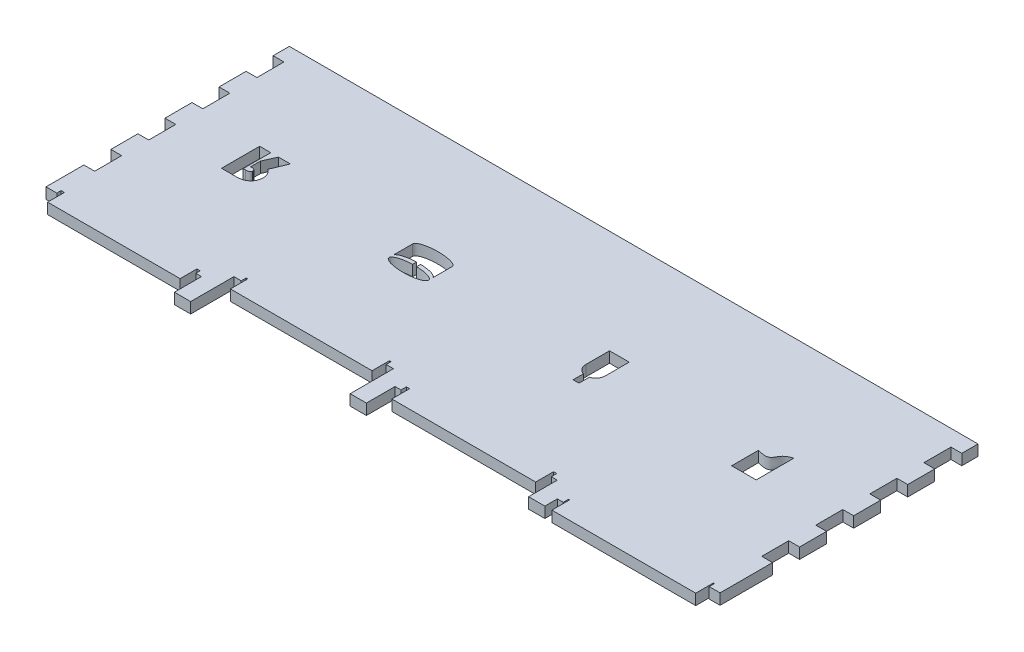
ISO-10303-21;
HEADER;
FILE_DESCRIPTION(('STEP AP214'),'2;1');
FILE_NAME('part.step','',(''),(''),'','','');
FILE_SCHEMA(('AUTOMOTIVE_DESIGN { 1 0 10303 214 1 1 1 1 }'));
ENDSEC;
DATA;
#1=APPLICATION_CONTEXT('core data for automotive mechanical design processes');
#2=APPLICATION_PROTOCOL_DEFINITION('international standard','automotive_design',2000,#1);
#3=PRODUCT_CONTEXT('',#1,'mechanical');
#4=PRODUCT('Part','Part','',(#3));
#5=PRODUCT_RELATED_PRODUCT_CATEGORY('part','',(#4));
#6=PRODUCT_DEFINITION_FORMATION('','',#4);
#7=PRODUCT_DEFINITION_CONTEXT('part definition',#1,'design');
#8=PRODUCT_DEFINITION('design','',#6,#7);
#9=PRODUCT_DEFINITION_SHAPE('','',#8);
#10=(LENGTH_UNIT() NAMED_UNIT(*) SI_UNIT(.MILLI.,.METRE.));
#11=(NAMED_UNIT(*) PLANE_ANGLE_UNIT() SI_UNIT($,.RADIAN.));
#12=(NAMED_UNIT(*) SI_UNIT($,.STERADIAN.) SOLID_ANGLE_UNIT());
#13=UNCERTAINTY_MEASURE_WITH_UNIT(LENGTH_MEASURE(1.E-05),#10,'distance_accuracy_value','');
#14=(GEOMETRIC_REPRESENTATION_CONTEXT(3) GLOBAL_UNCERTAINTY_ASSIGNED_CONTEXT((#13)) GLOBAL_UNIT_ASSIGNED_CONTEXT((#10,
#11,#12)) REPRESENTATION_CONTEXT('',''));
#15=CARTESIAN_POINT('',(0.,0.,0.));
#16=DIRECTION('',(0.,0.,1.));
#17=DIRECTION('',(1.,0.,0.));
#18=AXIS2_PLACEMENT_3D('',#15,#16,#17);
#19=CARTESIAN_POINT('',(-406.325897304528,20.,-266.376487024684));
#20=DIRECTION('',(0.,1.,0.));
#21=DIRECTION('',(0.,0.,1.));
#22=AXIS2_PLACEMENT_3D('',#19,#20,#21);
#23=PLANE('',#22);
#24=DIRECTION('',(0.,0.,-1.));
#25=VECTOR('',#24,1.);
#26=CARTESIAN_POINT('',(1110.60655738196,20.,-239.5263864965));
#27=LINE('',#26,#25);
#28=CARTESIAN_POINT('',(1110.60655738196,20.,-239.5263864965));
#29=VERTEX_POINT('',#28);
#30=CARTESIAN_POINT('',(1110.60655738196,20.,-288.928904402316));
#31=VERTEX_POINT('',#30);
#32=EDGE_CURVE('E751',#29,#31,#27,.T.);
#33=ORIENTED_EDGE('',*,*,#32,.T.);
#34=CARTESIAN_POINT('',(1110.60655738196,20.,-288.928904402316));
#35=CARTESIAN_POINT('',(1119.37323173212,20.,-286.824753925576));
#36=CARTESIAN_POINT('',(1133.57072465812,20.,-283.417114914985));
#37=CARTESIAN_POINT('',(1140.47891735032,20.,-303.272429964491));
#38=CARTESIAN_POINT('',(1150.48837761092,20.,-307.201887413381));
#39=CARTESIAN_POINT('',(1155.97729120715,20.,-309.356694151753));
#40=B_SPLINE_CURVE_WITH_KNOTS('',3,(#34,#35,#36,#37,#38,#39),.UNSPECIFIED.,.F.,.F.,(4,1,1,4),
(0.,0.42164354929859,0.68284517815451,1.),.UNSPECIFIED.);
#41=CARTESIAN_POINT('',(1155.97729120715,20.,-309.356694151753));
#42=VERTEX_POINT('',#41);
#43=EDGE_CURVE('E760',#31,#42,#40,.T.);
#44=ORIENTED_EDGE('',*,*,#43,.T.);
#45=DIRECTION('',(0.,0.,1.));
#46=VECTOR('',#45,1.);
#47=CARTESIAN_POINT('',(1155.97729120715,20.,-239.5263864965));
#48=LINE('',#47,#46);
#49=CARTESIAN_POINT('',(1155.97729120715,20.,-239.5263864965));
#50=VERTEX_POINT('',#49);
#51=EDGE_CURVE('E46',#42,#50,#48,.T.);
#52=ORIENTED_EDGE('',*,*,#51,.T.);
#53=DIRECTION('',(-1.,0.,0.));
#54=VECTOR('',#53,1.);
#55=CARTESIAN_POINT('',(1110.60655738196,20.,-239.5263864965));
#56=LINE('',#55,#54);
#57=EDGE_CURVE('E757',#50,#29,#56,.T.);
#58=ORIENTED_EDGE('',*,*,#57,.T.);
#59=EDGE_LOOP('',(#33,#44,#52,#58));
#60=FACE_BOUND('',#59,.T.);
#61=DIRECTION('',(0.,0.,-1.));
#62=VECTOR('',#61,1.);
#63=CARTESIAN_POINT('',(826.27785879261,20.,-230.688904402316));
#64=LINE('',#63,#62);
#65=CARTESIAN_POINT('',(826.27785879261,20.,-230.688904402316));
#66=VERTEX_POINT('',#65);
#67=CARTESIAN_POINT('',(826.27785879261,20.,-249.727210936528));
#68=VERTEX_POINT('',#67);
#69=EDGE_CURVE('E2884',#66,#68,#64,.T.);
#70=ORIENTED_EDGE('',*,*,#69,.T.);
#71=CARTESIAN_POINT('',(831.73785879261,20.,-267.088904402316));
#72=DIRECTION('',(0.,-1.,0.));
#73=DIRECTION('',(0.,0.,-1.));
#74=AXIS2_PLACEMENT_3D('',#71,#72,#73);
#75=CIRCLE('',#74,18.2);
#76=CARTESIAN_POINT('',(813.53785879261,20.,-267.088904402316));
#77=VERTEX_POINT('',#76);
#78=EDGE_CURVE('E2887',#68,#77,#75,.T.);
#79=ORIENTED_EDGE('',*,*,#78,.T.);
#80=DIRECTION('',(0.,0.,-1.));
#81=VECTOR('',#80,1.);
#82=CARTESIAN_POINT('',(813.53785879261,20.,-267.088904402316));
#83=LINE('',#82,#81);
#84=CARTESIAN_POINT('',(813.53785879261,20.,-310.768904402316));
#85=VERTEX_POINT('',#84);
#86=EDGE_CURVE('E2891',#77,#85,#83,.T.);
#87=ORIENTED_EDGE('',*,*,#86,.T.);
#88=DIRECTION('',(1.,0.,0.));
#89=VECTOR('',#88,1.);
#90=CARTESIAN_POINT('',(813.53785879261,20.,-310.768904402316));
#91=LINE('',#90,#89);
#92=CARTESIAN_POINT('',(849.93785879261,20.,-310.768904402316));
#93=VERTEX_POINT('',#92);
#94=EDGE_CURVE('E2894',#85,#93,#91,.T.);
#95=ORIENTED_EDGE('',*,*,#94,.T.);
#96=DIRECTION('',(0.,0.,1.));
#97=VECTOR('',#96,1.);
#98=CARTESIAN_POINT('',(849.93785879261,20.,-267.088904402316));
#99=LINE('',#98,#97);
#100=CARTESIAN_POINT('',(849.93785879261,20.,-267.088904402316));
#101=VERTEX_POINT('',#100);
#102=EDGE_CURVE('E2897',#93,#101,#99,.T.);
#103=ORIENTED_EDGE('',*,*,#102,.T.);
#104=CARTESIAN_POINT('',(831.73785879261,20.,-267.088904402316));
#105=DIRECTION('',(0.,-1.,0.));
#106=DIRECTION('',(0.,0.,-1.));
#107=AXIS2_PLACEMENT_3D('',#104,#105,#106);
#108=CIRCLE('',#107,18.2000000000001);
#109=CARTESIAN_POINT('',(837.19785879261,20.,-249.727210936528));
#110=VERTEX_POINT('',#109);
#111=EDGE_CURVE('E2900',#101,#110,#108,.T.);
#112=ORIENTED_EDGE('',*,*,#111,.T.);
#113=DIRECTION('',(0.,0.,1.));
#114=VECTOR('',#113,1.);
#115=CARTESIAN_POINT('',(837.19785879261,20.,-230.688904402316));
#116=LINE('',#115,#114);
#117=CARTESIAN_POINT('',(837.19785879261,20.,-230.688904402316));
#118=VERTEX_POINT('',#117);
#119=EDGE_CURVE('E2903',#110,#118,#116,.T.);
#120=ORIENTED_EDGE('',*,*,#119,.T.);
#121=DIRECTION('',(-1.,0.,0.));
#122=VECTOR('',#121,1.);
#123=CARTESIAN_POINT('',(826.27785879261,20.,-230.688904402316));
#124=LINE('',#123,#122);
#125=EDGE_CURVE('E2906',#118,#66,#124,.T.);
#126=ORIENTED_EDGE('',*,*,#125,.T.);
#127=EDGE_LOOP('',(#70,#79,#87,#95,#103,#112,#120,#126));
#128=FACE_BOUND('',#127,.T.);
#129=CARTESIAN_POINT('',(496.776903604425,20.,-263.576277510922));
#130=DIRECTION('',(0.,1.,0.));
#131=DIRECTION('',(1.,0.,0.));
#132=AXIS2_PLACEMENT_3D('',#129,#130,#131);
#133=ELLIPSE('',#132,36.4000000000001,10.9199999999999);
#134=CARTESIAN_POINT('',(532.606943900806,20.,-265.501151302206));
#135=VERTEX_POINT('',#134);
#136=CARTESIAN_POINT('',(500.416903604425,20.,-274.441540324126));
#137=VERTEX_POINT('',#136);
#138=EDGE_CURVE('E881',#135,#137,#133,.T.);
#139=ORIENTED_EDGE('',*,*,#138,.T.);
#140=DIRECTION('',(0.,0.,1.));
#141=VECTOR('',#140,1.);
#142=CARTESIAN_POINT('',(500.416903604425,20.,-267.161540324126));
#143=LINE('',#142,#141);
#144=CARTESIAN_POINT('',(500.416903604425,20.,-267.161540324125));
#145=VERTEX_POINT('',#144);
#146=EDGE_CURVE('E2948',#137,#145,#143,.T.);
#147=ORIENTED_EDGE('',*,*,#146,.T.);
#148=CARTESIAN_POINT('',(496.776903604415,20.,-256.296277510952));
#149=DIRECTION('',(0.,-1.,0.));
#150=DIRECTION('',(1.,0.,0.));
#151=AXIS2_PLACEMENT_3D('',#148,#149,#150);
#152=ELLIPSE('',#151,36.3999999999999,10.9199999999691);
#153=CARTESIAN_POINT('',(493.136903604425,20.,-267.161540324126));
#154=VERTEX_POINT('',#153);
#155=EDGE_CURVE('E2951',#145,#154,#152,.T.);
#156=ORIENTED_EDGE('',*,*,#155,.T.);
#157=DIRECTION('',(0.,0.,-1.));
#158=VECTOR('',#157,1.);
#159=CARTESIAN_POINT('',(493.136903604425,20.,-267.161540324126));
#160=LINE('',#159,#158);
#161=CARTESIAN_POINT('',(493.136903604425,20.,-274.441540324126));
#162=VERTEX_POINT('',#161);
#163=EDGE_CURVE('E2955',#154,#162,#160,.T.);
#164=ORIENTED_EDGE('',*,*,#163,.T.);
#165=CARTESIAN_POINT('',(496.776903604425,20.,-263.576277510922));
#166=DIRECTION('',(0.,1.,0.));
#167=DIRECTION('',(1.,0.,0.));
#168=AXIS2_PLACEMENT_3D('',#165,#166,#167);
#169=ELLIPSE('',#168,36.4000000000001,10.9199999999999);
#170=CARTESIAN_POINT('',(460.946863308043,20.,-265.501151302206));
#171=VERTEX_POINT('',#170);
#172=EDGE_CURVE('E2957',#162,#171,#169,.T.);
#173=ORIENTED_EDGE('',*,*,#172,.T.);
#174=DIRECTION('',(-1.,0.,0.));
#175=VECTOR('',#174,1.);
#176=CARTESIAN_POINT('',(460.376903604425,20.,-265.501151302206));
#177=LINE('',#176,#175);
#178=CARTESIAN_POINT('',(460.376903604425,20.,-265.501151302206));
#179=VERTEX_POINT('',#178);
#180=EDGE_CURVE('E2960',#171,#179,#177,.T.);
#181=ORIENTED_EDGE('',*,*,#180,.T.);
#182=DIRECTION('',(0.,0.,-1.));
#183=VECTOR('',#182,1.);
#184=CARTESIAN_POINT('',(460.376903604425,20.,-265.501151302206));
#185=LINE('',#184,#183);
#186=CARTESIAN_POINT('',(460.376903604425,20.,-299.976277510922));
#187=VERTEX_POINT('',#186);
#188=EDGE_CURVE('E843',#179,#187,#185,.T.);
#189=ORIENTED_EDGE('',*,*,#188,.T.);
#190=CARTESIAN_POINT('',(496.776903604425,20.,-299.976277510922));
#191=DIRECTION('',(0.,-1.,0.));
#192=DIRECTION('',(1.,0.,0.));
#193=AXIS2_PLACEMENT_3D('',#190,#191,#192);
#194=ELLIPSE('',#193,36.3999999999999,10.9200000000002);
#195=CARTESIAN_POINT('',(533.176903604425,20.,-299.976277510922));
#196=VERTEX_POINT('',#195);
#197=EDGE_CURVE('E837',#187,#196,#194,.T.);
#198=ORIENTED_EDGE('',*,*,#197,.T.);
#199=DIRECTION('',(0.,0.,1.));
#200=VECTOR('',#199,1.);
#201=CARTESIAN_POINT('',(533.176903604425,20.,-265.501151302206));
#202=LINE('',#201,#200);
#203=CARTESIAN_POINT('',(533.176903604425,20.,-265.501151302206));
#204=VERTEX_POINT('',#203);
#205=EDGE_CURVE('E842',#196,#204,#202,.T.);
#206=ORIENTED_EDGE('',*,*,#205,.T.);
#207=DIRECTION('',(-1.,0.,0.));
#208=VECTOR('',#207,1.);
#209=CARTESIAN_POINT('',(532.606943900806,20.,-265.501151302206));
#210=LINE('',#209,#208);
#211=EDGE_CURVE('E847',#204,#135,#210,.T.);
#212=ORIENTED_EDGE('',*,*,#211,.T.);
#213=EDGE_LOOP('',(#139,#147,#156,#164,#173,#181,#189,#198,#206,#212));
#214=FACE_BOUND('',#213,.T.);
#215=DIRECTION('',(-1.,0.,0.));
#216=VECTOR('',#215,1.);
#217=CARTESIAN_POINT('',(-406.325897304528,20.,-472.247312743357));
#218=LINE('',#217,#216);
#219=CARTESIAN_POINT('',(1303.45157999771,20.,-472.247312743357));
#220=VERTEX_POINT('',#219);
#221=CARTESIAN_POINT('',(1283.45157999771,20.,-472.247312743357));
#222=VERTEX_POINT('',#221);
#223=EDGE_CURVE('E1501',#220,#222,#218,.T.);
#224=ORIENTED_EDGE('',*,*,#223,.F.);
#225=DIRECTION('',(0.,0.,-1.));
#226=VECTOR('',#225,1.);
#227=CARTESIAN_POINT('',(1303.45157999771,20.,-266.376487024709));
#228=LINE('',#227,#226);
#229=CARTESIAN_POINT('',(1303.45157999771,20.,-502.247312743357));
#230=VERTEX_POINT('',#229);
#231=EDGE_CURVE('E1693',#220,#230,#228,.T.);
#232=ORIENTED_EDGE('',*,*,#231,.T.);
#233=DIRECTION('',(1.,0.,0.));
#234=VECTOR('',#233,1.);
#235=CARTESIAN_POINT('',(-406.325897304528,20.,-502.247312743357));
#236=LINE('',#235,#234);
#237=CARTESIAN_POINT('',(29.9515799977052,20.,-502.247312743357));
#238=VERTEX_POINT('',#237);
#239=EDGE_CURVE('E1688',#238,#230,#236,.T.);
#240=ORIENTED_EDGE('',*,*,#239,.F.);
#241=DIRECTION('',(0.,0.,-1.));
#242=VECTOR('',#241,1.);
#243=CARTESIAN_POINT('',(29.9515799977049,20.,-266.376487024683));
#244=LINE('',#243,#242);
#245=CARTESIAN_POINT('',(29.9515799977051,20.,-472.247312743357));
#246=VERTEX_POINT('',#245);
#247=EDGE_CURVE('E1692',#246,#238,#244,.T.);
#248=ORIENTED_EDGE('',*,*,#247,.F.);
#249=DIRECTION('',(1.,0.,0.));
#250=VECTOR('',#249,1.);
#251=CARTESIAN_POINT('',(-406.325897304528,20.,-472.247312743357));
#252=LINE('',#251,#250);
#253=CARTESIAN_POINT('',(49.9515799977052,20.,-472.247312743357));
#254=VERTEX_POINT('',#253);
#255=EDGE_CURVE('E1695',#246,#254,#252,.T.);
#256=ORIENTED_EDGE('',*,*,#255,.T.);
#257=DIRECTION('',(0.,0.,-1.));
#258=VECTOR('',#257,1.);
#259=CARTESIAN_POINT('',(49.9515799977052,20.,-266.376487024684));
#260=LINE('',#259,#258);
#261=CARTESIAN_POINT('',(49.9515799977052,20.,-422.247312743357));
#262=VERTEX_POINT('',#261);
#263=EDGE_CURVE('E1701',#262,#254,#260,.T.);
#264=ORIENTED_EDGE('',*,*,#263,.F.);
#265=DIRECTION('',(1.,0.,0.));
#266=VECTOR('',#265,1.);
#267=CARTESIAN_POINT('',(-406.325897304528,20.,-422.247312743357));
#268=LINE('',#267,#266);
#269=CARTESIAN_POINT('',(29.9515799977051,20.,-422.247312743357));
#270=VERTEX_POINT('',#269);
#271=EDGE_CURVE('E1704',#270,#262,#268,.T.);
#272=ORIENTED_EDGE('',*,*,#271,.F.);
#273=DIRECTION('',(0.,0.,-1.));
#274=VECTOR('',#273,1.);
#275=CARTESIAN_POINT('',(29.9515799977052,20.,-266.376487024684));
#276=LINE('',#275,#274);
#277=CARTESIAN_POINT('',(29.9515799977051,20.,-372.247312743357));
#278=VERTEX_POINT('',#277);
#279=EDGE_CURVE('E1707',#278,#270,#276,.T.);
#280=ORIENTED_EDGE('',*,*,#279,.F.);
#281=DIRECTION('',(1.,0.,0.));
#282=VECTOR('',#281,1.);
#283=CARTESIAN_POINT('',(-406.325897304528,20.,-372.247312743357));
#284=LINE('',#283,#282);
#285=CARTESIAN_POINT('',(49.9515799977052,20.,-372.247312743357));
#286=VERTEX_POINT('',#285);
#287=EDGE_CURVE('E1710',#278,#286,#284,.T.);
#288=ORIENTED_EDGE('',*,*,#287,.T.);
#289=DIRECTION('',(0.,0.,-1.));
#290=VECTOR('',#289,1.);
#291=CARTESIAN_POINT('',(49.9515799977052,20.,-266.376487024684));
#292=LINE('',#291,#290);
#293=CARTESIAN_POINT('',(49.9515799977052,20.,-322.247312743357));
#294=VERTEX_POINT('',#293);
#295=EDGE_CURVE('E1712',#294,#286,#292,.T.);
#296=ORIENTED_EDGE('',*,*,#295,.F.);
#297=DIRECTION('',(1.,0.,0.));
#298=VECTOR('',#297,1.);
#299=CARTESIAN_POINT('',(-406.325897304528,20.,-322.247312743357));
#300=LINE('',#299,#298);
#301=CARTESIAN_POINT('',(29.9515799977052,20.,-322.247312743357));
#302=VERTEX_POINT('',#301);
#303=EDGE_CURVE('E1715',#302,#294,#300,.T.);
#304=ORIENTED_EDGE('',*,*,#303,.F.);
#305=DIRECTION('',(0.,0.,-1.));
#306=VECTOR('',#305,1.);
#307=CARTESIAN_POINT('',(29.9515799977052,20.,-266.376487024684));
#308=LINE('',#307,#306);
#309=CARTESIAN_POINT('',(29.9515799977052,20.,-272.247312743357));
#310=VERTEX_POINT('',#309);
#311=EDGE_CURVE('E1718',#310,#302,#308,.T.);
#312=ORIENTED_EDGE('',*,*,#311,.F.);
#313=DIRECTION('',(1.,0.,0.));
#314=VECTOR('',#313,1.);
#315=CARTESIAN_POINT('',(-406.325897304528,20.,-272.247312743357));
#316=LINE('',#315,#314);
#317=CARTESIAN_POINT('',(49.9515799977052,20.,-272.247312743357));
#318=VERTEX_POINT('',#317);
#319=EDGE_CURVE('E1721',#310,#318,#316,.T.);
#320=ORIENTED_EDGE('',*,*,#319,.T.);
#321=DIRECTION('',(0.,0.,-1.));
#322=VECTOR('',#321,1.);
#323=CARTESIAN_POINT('',(49.9515799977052,20.,-266.376487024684));
#324=LINE('',#323,#322);
#325=CARTESIAN_POINT('',(49.9515799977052,20.,-222.247312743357));
#326=VERTEX_POINT('',#325);
#327=EDGE_CURVE('E1723',#326,#318,#324,.T.);
#328=ORIENTED_EDGE('',*,*,#327,.F.);
#329=DIRECTION('',(1.,0.,0.));
#330=VECTOR('',#329,1.);
#331=CARTESIAN_POINT('',(-406.325897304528,20.,-222.247312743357));
#332=LINE('',#331,#330);
#333=CARTESIAN_POINT('',(29.9515799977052,20.,-222.247312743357));
#334=VERTEX_POINT('',#333);
#335=EDGE_CURVE('E1726',#334,#326,#332,.T.);
#336=ORIENTED_EDGE('',*,*,#335,.F.);
#337=DIRECTION('',(0.,0.,-1.));
#338=VECTOR('',#337,1.);
#339=CARTESIAN_POINT('',(29.9515799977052,20.,-266.376487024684));
#340=LINE('',#339,#338);
#341=CARTESIAN_POINT('',(29.9515799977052,20.,-172.247312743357));
#342=VERTEX_POINT('',#341);
#343=EDGE_CURVE('E1729',#342,#334,#340,.T.);
#344=ORIENTED_EDGE('',*,*,#343,.F.);
#345=DIRECTION('',(1.,0.,0.));
#346=VECTOR('',#345,1.);
#347=CARTESIAN_POINT('',(-406.325897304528,20.,-172.247312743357));
#348=LINE('',#347,#346);
#349=CARTESIAN_POINT('',(49.9515799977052,20.,-172.247312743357));
#350=VERTEX_POINT('',#349);
#351=EDGE_CURVE('E1732',#342,#350,#348,.T.);
#352=ORIENTED_EDGE('',*,*,#351,.T.);
#353=DIRECTION('',(0.,0.,-1.));
#354=VECTOR('',#353,1.);
#355=CARTESIAN_POINT('',(49.9515799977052,20.,-266.376487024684));
#356=LINE('',#355,#354);
#357=CARTESIAN_POINT('',(49.9515799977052,20.,-122.247312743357));
#358=VERTEX_POINT('',#357);
#359=EDGE_CURVE('E1734',#358,#350,#356,.T.);
#360=ORIENTED_EDGE('',*,*,#359,.F.);
#361=DIRECTION('',(1.,0.,0.));
#362=VECTOR('',#361,1.);
#363=CARTESIAN_POINT('',(-406.325897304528,20.,-122.247312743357));
#364=LINE('',#363,#362);
#365=CARTESIAN_POINT('',(29.9515799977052,20.,-122.247312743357));
#366=VERTEX_POINT('',#365);
#367=EDGE_CURVE('E1737',#366,#358,#364,.T.);
#368=ORIENTED_EDGE('',*,*,#367,.F.);
#369=DIRECTION('',(0.,0.,-1.));
#370=VECTOR('',#369,1.);
#371=CARTESIAN_POINT('',(29.9515799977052,20.,-266.376487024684));
#372=LINE('',#371,#370);
#373=CARTESIAN_POINT('',(29.9515799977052,20.,-52.2473127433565));
#374=VERTEX_POINT('',#373);
#375=EDGE_CURVE('E1740',#374,#366,#372,.T.);
#376=ORIENTED_EDGE('',*,*,#375,.F.);
#377=DIRECTION('',(1.,0.,0.));
#378=VECTOR('',#377,1.);
#379=CARTESIAN_POINT('',(-406.325897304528,20.,-52.2473127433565));
#380=LINE('',#379,#378);
#381=CARTESIAN_POINT('',(49.9515799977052,20.,-52.2473127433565));
#382=VERTEX_POINT('',#381);
#383=EDGE_CURVE('E1743',#374,#382,#380,.T.);
#384=ORIENTED_EDGE('',*,*,#383,.T.);
#385=DIRECTION('',(0.,0.,-1.));
#386=VECTOR('',#385,1.);
#387=CARTESIAN_POINT('',(49.9515799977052,20.,-266.376487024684));
#388=LINE('',#387,#386);
#389=CARTESIAN_POINT('',(49.9515799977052,20.,-60.2473127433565));
#390=VERTEX_POINT('',#389);
#391=EDGE_CURVE('E1745',#382,#390,#388,.T.);
#392=ORIENTED_EDGE('',*,*,#391,.T.);
#393=DIRECTION('',(1.,0.,0.));
#394=VECTOR('',#393,1.);
#395=CARTESIAN_POINT('',(-406.325897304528,20.,-60.2473127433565));
#396=LINE('',#395,#394);
#397=CARTESIAN_POINT('',(55.9515799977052,20.,-60.2473127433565));
#398=VERTEX_POINT('',#397);
#399=EDGE_CURVE('E1747',#390,#398,#396,.T.);
#400=ORIENTED_EDGE('',*,*,#399,.T.);
#401=DIRECTION('',(0.,0.,-1.));
#402=VECTOR('',#401,1.);
#403=CARTESIAN_POINT('',(55.9515799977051,20.,-266.376487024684));
#404=LINE('',#403,#402);
#405=CARTESIAN_POINT('',(55.9515799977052,20.,-29.2473127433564));
#406=VERTEX_POINT('',#405);
#407=EDGE_CURVE('E1749',#406,#398,#404,.T.);
#408=ORIENTED_EDGE('',*,*,#407,.F.);
#409=DIRECTION('',(1.,0.,0.));
#410=VECTOR('',#409,1.);
#411=CARTESIAN_POINT('',(-406.325897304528,20.,-29.2473127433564));
#412=LINE('',#411,#410);
#413=CARTESIAN_POINT('',(300.951579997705,20.,-29.2473127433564));
#414=VERTEX_POINT('',#413);
#415=EDGE_CURVE('E1752',#406,#414,#412,.T.);
#416=ORIENTED_EDGE('',*,*,#415,.T.);
#417=DIRECTION('',(0.,0.,-1.));
#418=VECTOR('',#417,1.);
#419=CARTESIAN_POINT('',(300.951579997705,20.,-266.376487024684));
#420=LINE('',#419,#418);
#421=CARTESIAN_POINT('',(300.951579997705,20.,-60.2473127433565));
#422=VERTEX_POINT('',#421);
#423=EDGE_CURVE('E1754',#414,#422,#420,.T.);
#424=ORIENTED_EDGE('',*,*,#423,.T.);
#425=DIRECTION('',(1.,0.,0.));
#426=VECTOR('',#425,1.);
#427=CARTESIAN_POINT('',(-406.325897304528,20.,-60.2473127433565));
#428=LINE('',#427,#426);
#429=CARTESIAN_POINT('',(306.951579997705,20.,-60.2473127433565));
#430=VERTEX_POINT('',#429);
#431=EDGE_CURVE('E1756',#422,#430,#428,.T.);
#432=ORIENTED_EDGE('',*,*,#431,.T.);
#433=DIRECTION('',(0.,0.,-1.));
#434=VECTOR('',#433,1.);
#435=CARTESIAN_POINT('',(306.951579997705,20.,-266.376487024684));
#436=LINE('',#435,#434);
#437=CARTESIAN_POINT('',(306.951579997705,20.,-52.2473127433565));
#438=VERTEX_POINT('',#437);
#439=EDGE_CURVE('E1758',#438,#430,#436,.T.);
#440=ORIENTED_EDGE('',*,*,#439,.F.);
#441=DIRECTION('',(1.,0.,0.));
#442=VECTOR('',#441,1.);
#443=CARTESIAN_POINT('',(-406.325897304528,20.,-52.2473127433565));
#444=LINE('',#443,#442);
#445=CARTESIAN_POINT('',(317.451579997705,20.,-52.2473127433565));
#446=VERTEX_POINT('',#445);
#447=EDGE_CURVE('E1761',#438,#446,#444,.T.);
#448=ORIENTED_EDGE('',*,*,#447,.T.);
#449=DIRECTION('',(0.,0.,-1.));
#450=VECTOR('',#449,1.);
#451=CARTESIAN_POINT('',(317.451579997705,20.,-266.376487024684));
#452=LINE('',#451,#450);
#453=CARTESIAN_POINT('',(317.451579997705,20.,-2.24731274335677));
#454=VERTEX_POINT('',#453);
#455=EDGE_CURVE('E1763',#454,#446,#452,.T.);
#456=ORIENTED_EDGE('',*,*,#455,.F.);
#457=DIRECTION('',(1.,0.,0.));
#458=VECTOR('',#457,1.);
#459=CARTESIAN_POINT('',(-406.325897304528,20.,-2.24731274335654));
#460=LINE('',#459,#458);
#461=CARTESIAN_POINT('',(347.451579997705,20.,-2.24731274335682));
#462=VERTEX_POINT('',#461);
#463=EDGE_CURVE('E1766',#454,#462,#460,.T.);
#464=ORIENTED_EDGE('',*,*,#463,.T.);
#465=DIRECTION('',(0.,0.,-1.));
#466=VECTOR('',#465,1.);
#467=CARTESIAN_POINT('',(347.451579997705,20.,-266.376487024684));
#468=LINE('',#467,#466);
#469=CARTESIAN_POINT('',(347.451579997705,20.,-82.2473127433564));
#470=VERTEX_POINT('',#469);
#471=EDGE_CURVE('E1768',#462,#470,#468,.T.);
#472=ORIENTED_EDGE('',*,*,#471,.T.);
#473=DIRECTION('',(1.,0.,0.));
#474=VECTOR('',#473,1.);
#475=CARTESIAN_POINT('',(-406.325897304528,20.,-82.2473127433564));
#476=LINE('',#475,#474);
#477=CARTESIAN_POINT('',(360.951579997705,20.,-82.2473127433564));
#478=VERTEX_POINT('',#477);
#479=EDGE_CURVE('E1770',#470,#478,#476,.T.);
#480=ORIENTED_EDGE('',*,*,#479,.T.);
#481=DIRECTION('',(0.,0.,-1.));
#482=VECTOR('',#481,1.);
#483=CARTESIAN_POINT('',(360.951579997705,20.,-266.376487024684));
#484=LINE('',#483,#482);
#485=CARTESIAN_POINT('',(360.951579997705,20.,-91.2473127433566));
#486=VERTEX_POINT('',#485);
#487=EDGE_CURVE('E1772',#478,#486,#484,.T.);
#488=ORIENTED_EDGE('',*,*,#487,.T.);
#489=DIRECTION('',(1.,0.,0.));
#490=VECTOR('',#489,1.);
#491=CARTESIAN_POINT('',(-406.325897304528,20.,-91.247312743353));
#492=LINE('',#491,#490);
#493=CARTESIAN_POINT('',(363.951579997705,20.,-91.2473127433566));
#494=VERTEX_POINT('',#493);
#495=EDGE_CURVE('E1774',#486,#494,#492,.T.);
#496=ORIENTED_EDGE('',*,*,#495,.T.);
#497=DIRECTION('',(0.,0.,-1.));
#498=VECTOR('',#497,1.);
#499=CARTESIAN_POINT('',(363.951579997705,20.,-266.376487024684));
#500=LINE('',#499,#498);
#501=CARTESIAN_POINT('',(363.951579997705,20.,-59.247312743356));
#502=VERTEX_POINT('',#501);
#503=EDGE_CURVE('E1776',#502,#494,#500,.T.);
#504=ORIENTED_EDGE('',*,*,#503,.F.);
#505=DIRECTION('',(1.,0.,0.));
#506=VECTOR('',#505,1.);
#507=CARTESIAN_POINT('',(-406.325897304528,20.,-59.247312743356));
#508=LINE('',#507,#506);
#509=CARTESIAN_POINT('',(625.951579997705,20.,-59.247312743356));
#510=VERTEX_POINT('',#509);
#511=EDGE_CURVE('E1779',#502,#510,#508,.T.);
#512=ORIENTED_EDGE('',*,*,#511,.T.);
#513=DIRECTION('',(0.,0.,-1.));
#514=VECTOR('',#513,1.);
#515=CARTESIAN_POINT('',(625.951579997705,20.,-266.376487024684));
#516=LINE('',#515,#514);
#517=CARTESIAN_POINT('',(625.951579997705,20.,-91.2473127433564));
#518=VERTEX_POINT('',#517);
#519=EDGE_CURVE('E1781',#510,#518,#516,.T.);
#520=ORIENTED_EDGE('',*,*,#519,.T.);
#521=DIRECTION('',(1.,0.,0.));
#522=VECTOR('',#521,1.);
#523=CARTESIAN_POINT('',(-406.325897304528,20.,-91.2473127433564));
#524=LINE('',#523,#522);
#525=CARTESIAN_POINT('',(628.951579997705,20.,-91.2473127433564));
#526=VERTEX_POINT('',#525);
#527=EDGE_CURVE('E1783',#518,#526,#524,.T.);
#528=ORIENTED_EDGE('',*,*,#527,.T.);
#529=DIRECTION('',(0.,0.,-1.));
#530=VECTOR('',#529,1.);
#531=CARTESIAN_POINT('',(628.951579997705,20.,-266.376487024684));
#532=LINE('',#531,#530);
#533=CARTESIAN_POINT('',(628.951579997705,20.,-82.2473127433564));
#534=VERTEX_POINT('',#533);
#535=EDGE_CURVE('E1785',#534,#526,#532,.T.);
#536=ORIENTED_EDGE('',*,*,#535,.F.);
#537=DIRECTION('',(1.,0.,0.));
#538=VECTOR('',#537,1.);
#539=CARTESIAN_POINT('',(-406.325897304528,20.,-82.2473127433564));
#540=LINE('',#539,#538);
#541=CARTESIAN_POINT('',(642.451579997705,20.,-82.2473127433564));
#542=VERTEX_POINT('',#541);
#543=EDGE_CURVE('E1788',#534,#542,#540,.T.);
#544=ORIENTED_EDGE('',*,*,#543,.T.);
#545=DIRECTION('',(0.,0.,-1.));
#546=VECTOR('',#545,1.);
#547=CARTESIAN_POINT('',(642.451579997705,20.,-266.376487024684));
#548=LINE('',#547,#546);
#549=CARTESIAN_POINT('',(642.451579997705,20.,-2.24731274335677));
#550=VERTEX_POINT('',#549);
#551=EDGE_CURVE('E1790',#550,#542,#548,.T.);
#552=ORIENTED_EDGE('',*,*,#551,.F.);
#553=DIRECTION('',(1.,0.,0.));
#554=VECTOR('',#553,1.);
#555=CARTESIAN_POINT('',(-406.325897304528,20.,-2.24731274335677));
#556=LINE('',#555,#554);
#557=CARTESIAN_POINT('',(672.451579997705,20.,-2.24731274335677));
#558=VERTEX_POINT('',#557);
#559=EDGE_CURVE('E1793',#550,#558,#556,.T.);
#560=ORIENTED_EDGE('',*,*,#559,.T.);
#561=DIRECTION('',(0.,0.,-1.));
#562=VECTOR('',#561,1.);
#563=CARTESIAN_POINT('',(672.451579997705,20.,-266.376487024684));
#564=LINE('',#563,#562);
#565=CARTESIAN_POINT('',(672.451579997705,20.,-55.2473127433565));
#566=VERTEX_POINT('',#565);
#567=EDGE_CURVE('E1795',#558,#566,#564,.T.);
#568=ORIENTED_EDGE('',*,*,#567,.T.);
#569=DIRECTION('',(1.,0.,0.));
#570=VECTOR('',#569,1.);
#571=CARTESIAN_POINT('',(-406.325897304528,20.,-55.2473127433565));
#572=LINE('',#571,#570);
#573=CARTESIAN_POINT('',(683.451579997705,20.,-55.2473127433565));
#574=VERTEX_POINT('',#573);
#575=EDGE_CURVE('E1797',#566,#574,#572,.T.);
#576=ORIENTED_EDGE('',*,*,#575,.T.);
#577=DIRECTION('',(0.,0.,-1.));
#578=VECTOR('',#577,1.);
#579=CARTESIAN_POINT('',(683.451579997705,20.,-266.376487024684));
#580=LINE('',#579,#578);
#581=CARTESIAN_POINT('',(683.451579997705,20.,-65.2473127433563));
#582=VERTEX_POINT('',#581);
#583=EDGE_CURVE('E1799',#574,#582,#580,.T.);
#584=ORIENTED_EDGE('',*,*,#583,.T.);
#585=DIRECTION('',(-1.,0.,0.));
#586=VECTOR('',#585,1.);
#587=CARTESIAN_POINT('',(-406.325897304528,20.,-65.2473127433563));
#588=LINE('',#587,#586);
#589=CARTESIAN_POINT('',(689.451579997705,20.,-65.2473127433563));
#590=VERTEX_POINT('',#589);
#591=EDGE_CURVE('E1801',#590,#582,#588,.T.);
#592=ORIENTED_EDGE('',*,*,#591,.F.);
#593=DIRECTION('',(0.,0.,-1.));
#594=VECTOR('',#593,1.);
#595=CARTESIAN_POINT('',(689.451579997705,20.,-266.376487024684));
#596=LINE('',#595,#594);
#597=CARTESIAN_POINT('',(689.451579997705,20.,-32.2473127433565));
#598=VERTEX_POINT('',#597);
#599=EDGE_CURVE('E1804',#598,#590,#596,.T.);
#600=ORIENTED_EDGE('',*,*,#599,.F.);
#601=DIRECTION('',(1.,0.,0.));
#602=VECTOR('',#601,1.);
#603=CARTESIAN_POINT('',(-406.325897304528,20.,-32.2473127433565));
#604=LINE('',#603,#602);
#605=CARTESIAN_POINT('',(955.451579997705,20.,-32.2473127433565));
#606=VERTEX_POINT('',#605);
#607=EDGE_CURVE('E1807',#598,#606,#604,.T.);
#608=ORIENTED_EDGE('',*,*,#607,.T.);
#609=DIRECTION('',(0.,0.,-1.));
#610=VECTOR('',#609,1.);
#611=CARTESIAN_POINT('',(955.451579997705,20.,-266.376487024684));
#612=LINE('',#611,#610);
#613=CARTESIAN_POINT('',(955.451579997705,20.,-65.2473127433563));
#614=VERTEX_POINT('',#613);
#615=EDGE_CURVE('E1809',#606,#614,#612,.T.);
#616=ORIENTED_EDGE('',*,*,#615,.T.);
#617=DIRECTION('',(1.,0.,0.));
#618=VECTOR('',#617,1.);
#619=CARTESIAN_POINT('',(-406.325897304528,20.,-65.2473127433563));
#620=LINE('',#619,#618);
#621=CARTESIAN_POINT('',(961.451579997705,20.,-65.2473127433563));
#622=VERTEX_POINT('',#621);
#623=EDGE_CURVE('E1811',#614,#622,#620,.T.);
#624=ORIENTED_EDGE('',*,*,#623,.T.);
#625=DIRECTION('',(0.,0.,-1.));
#626=VECTOR('',#625,1.);
#627=CARTESIAN_POINT('',(961.451579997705,20.,-266.376487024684));
#628=LINE('',#627,#626);
#629=CARTESIAN_POINT('',(961.451579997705,20.,-55.2473127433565));
#630=VERTEX_POINT('',#629);
#631=EDGE_CURVE('E1813',#630,#622,#628,.T.);
#632=ORIENTED_EDGE('',*,*,#631,.F.);
#633=DIRECTION('',(1.,0.,0.));
#634=VECTOR('',#633,1.);
#635=CARTESIAN_POINT('',(-406.325897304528,20.,-55.2473127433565));
#636=LINE('',#635,#634);
#637=CARTESIAN_POINT('',(972.451579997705,20.,-55.2473127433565));
#638=VERTEX_POINT('',#637);
#639=EDGE_CURVE('E1816',#630,#638,#636,.T.);
#640=ORIENTED_EDGE('',*,*,#639,.T.);
#641=DIRECTION('',(0.,0.,-1.));
#642=VECTOR('',#641,1.);
#643=CARTESIAN_POINT('',(972.451579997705,20.,-266.376487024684));
#644=LINE('',#643,#642);
#645=CARTESIAN_POINT('',(972.451579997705,20.,-2.24731274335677));
#646=VERTEX_POINT('',#645);
#647=EDGE_CURVE('E1818',#646,#638,#644,.T.);
#648=ORIENTED_EDGE('',*,*,#647,.F.);
#649=DIRECTION('',(1.,0.,0.));
#650=VECTOR('',#649,1.);
#651=CARTESIAN_POINT('',(-406.325897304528,20.,-2.24731274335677));
#652=LINE('',#651,#650);
#653=CARTESIAN_POINT('',(1002.45157999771,20.,-2.24731274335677));
#654=VERTEX_POINT('',#653);
#655=EDGE_CURVE('E1821',#646,#654,#652,.T.);
#656=ORIENTED_EDGE('',*,*,#655,.T.);
#657=DIRECTION('',(0.,0.,-1.));
#658=VECTOR('',#657,1.);
#659=CARTESIAN_POINT('',(1002.45157999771,20.,-266.376487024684));
#660=LINE('',#659,#658);
#661=CARTESIAN_POINT('',(1002.45157999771,20.,-25.2473127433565));
#662=VERTEX_POINT('',#661);
#663=EDGE_CURVE('E1823',#654,#662,#660,.T.);
#664=ORIENTED_EDGE('',*,*,#663,.T.);
#665=DIRECTION('',(1.,0.,0.));
#666=VECTOR('',#665,1.);
#667=CARTESIAN_POINT('',(-406.325897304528,20.,-25.2473127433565));
#668=LINE('',#667,#666);
#669=CARTESIAN_POINT('',(1013.45157999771,20.,-25.2473127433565));
#670=VERTEX_POINT('',#669);
#671=EDGE_CURVE('E1825',#662,#670,#668,.T.);
#672=ORIENTED_EDGE('',*,*,#671,.T.);
#673=DIRECTION('',(0.,0.,-1.));
#674=VECTOR('',#673,1.);
#675=CARTESIAN_POINT('',(1013.45157999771,20.,-266.376487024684));
#676=LINE('',#675,#674);
#677=CARTESIAN_POINT('',(1013.45157999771,20.,-35.2473127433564));
#678=VERTEX_POINT('',#677);
#679=EDGE_CURVE('E1827',#670,#678,#676,.T.);
#680=ORIENTED_EDGE('',*,*,#679,.T.);
#681=DIRECTION('',(-1.,0.,0.));
#682=VECTOR('',#681,1.);
#683=CARTESIAN_POINT('',(-406.325897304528,20.,-35.2473127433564));
#684=LINE('',#683,#682);
#685=CARTESIAN_POINT('',(1015.45157999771,20.,-35.2473127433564));
#686=VERTEX_POINT('',#685);
#687=EDGE_CURVE('E1829',#686,#678,#684,.T.);
#688=ORIENTED_EDGE('',*,*,#687,.F.);
#689=DIRECTION('',(0.,0.,-1.));
#690=VECTOR('',#689,1.);
#691=CARTESIAN_POINT('',(1015.4515799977,20.,-266.376487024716));
#692=LINE('',#691,#690);
#693=CARTESIAN_POINT('',(1015.45157999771,20.,-2.24731274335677));
#694=VERTEX_POINT('',#693);
#695=EDGE_CURVE('E1832',#694,#686,#692,.T.);
#696=ORIENTED_EDGE('',*,*,#695,.F.);
#697=DIRECTION('',(1.,0.,0.));
#698=VECTOR('',#697,1.);
#699=CARTESIAN_POINT('',(-406.325897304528,20.,-2.24731274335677));
#700=LINE('',#699,#698);
#701=CARTESIAN_POINT('',(1281.45157999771,20.,-2.24731274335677));
#702=VERTEX_POINT('',#701);
#703=EDGE_CURVE('E1835',#694,#702,#700,.T.);
#704=ORIENTED_EDGE('',*,*,#703,.T.);
#705=DIRECTION('',(0.,0.,-1.));
#706=VECTOR('',#705,1.);
#707=CARTESIAN_POINT('',(1281.45157999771,20.,-266.376487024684));
#708=LINE('',#707,#706);
#709=CARTESIAN_POINT('',(1281.45157999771,20.,-35.2473127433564));
#710=VERTEX_POINT('',#709);
#711=EDGE_CURVE('E1837',#702,#710,#708,.T.);
#712=ORIENTED_EDGE('',*,*,#711,.T.);
#713=DIRECTION('',(1.,0.,0.));
#714=VECTOR('',#713,1.);
#715=CARTESIAN_POINT('',(-406.325897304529,20.,-35.2473127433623));
#716=LINE('',#715,#714);
#717=CARTESIAN_POINT('',(1283.45157999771,20.,-35.2473127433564));
#718=VERTEX_POINT('',#717);
#719=EDGE_CURVE('E1839',#710,#718,#716,.T.);
#720=ORIENTED_EDGE('',*,*,#719,.T.);
#721=DIRECTION('',(0.,0.,-1.));
#722=VECTOR('',#721,1.);
#723=CARTESIAN_POINT('',(1283.45157999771,20.,-266.376487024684));
#724=LINE('',#723,#722);
#725=CARTESIAN_POINT('',(1283.45157999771,20.,-25.2473127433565));
#726=VERTEX_POINT('',#725);
#727=EDGE_CURVE('E1841',#726,#718,#724,.T.);
#728=ORIENTED_EDGE('',*,*,#727,.F.);
#729=DIRECTION('',(1.,0.,0.));
#730=VECTOR('',#729,1.);
#731=CARTESIAN_POINT('',(-406.325897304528,20.,-25.2473127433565));
#732=LINE('',#731,#730);
#733=CARTESIAN_POINT('',(1303.45157999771,20.,-25.2473127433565));
#734=VERTEX_POINT('',#733);
#735=EDGE_CURVE('E1844',#726,#734,#732,.T.);
#736=ORIENTED_EDGE('',*,*,#735,.T.);
#737=DIRECTION('',(0.,0.,-1.));
#738=VECTOR('',#737,1.);
#739=CARTESIAN_POINT('',(1303.45157999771,20.,-266.37648702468));
#740=LINE('',#739,#738);
#741=CARTESIAN_POINT('',(1303.45157999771,20.,-122.247312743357));
#742=VERTEX_POINT('',#741);
#743=EDGE_CURVE('E1846',#734,#742,#740,.T.);
#744=ORIENTED_EDGE('',*,*,#743,.T.);
#745=DIRECTION('',(-1.,0.,0.));
#746=VECTOR('',#745,1.);
#747=CARTESIAN_POINT('',(-406.325897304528,20.,-122.247312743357));
#748=LINE('',#747,#746);
#749=CARTESIAN_POINT('',(1283.45157999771,20.,-122.247312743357));
#750=VERTEX_POINT('',#749);
#751=EDGE_CURVE('E1848',#742,#750,#748,.T.);
#752=ORIENTED_EDGE('',*,*,#751,.T.);
#753=DIRECTION('',(0.,0.,-1.));
#754=VECTOR('',#753,1.);
#755=CARTESIAN_POINT('',(1283.45157999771,20.,-266.376487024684));
#756=LINE('',#755,#754);
#757=CARTESIAN_POINT('',(1283.45157999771,20.,-172.247312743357));
#758=VERTEX_POINT('',#757);
#759=EDGE_CURVE('E1850',#750,#758,#756,.T.);
#760=ORIENTED_EDGE('',*,*,#759,.T.);
#761=DIRECTION('',(-1.,0.,0.));
#762=VECTOR('',#761,1.);
#763=CARTESIAN_POINT('',(-406.325897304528,20.,-172.247312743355));
#764=LINE('',#763,#762);
#765=CARTESIAN_POINT('',(1303.45157999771,20.,-172.247312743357));
#766=VERTEX_POINT('',#765);
#767=EDGE_CURVE('E1852',#766,#758,#764,.T.);
#768=ORIENTED_EDGE('',*,*,#767,.F.);
#769=DIRECTION('',(0.,0.,-1.));
#770=VECTOR('',#769,1.);
#771=CARTESIAN_POINT('',(1303.45157999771,20.,-266.376487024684));
#772=LINE('',#771,#770);
#773=CARTESIAN_POINT('',(1303.45157999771,20.,-222.247312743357));
#774=VERTEX_POINT('',#773);
#775=EDGE_CURVE('E1855',#766,#774,#772,.T.);
#776=ORIENTED_EDGE('',*,*,#775,.T.);
#777=DIRECTION('',(-1.,0.,0.));
#778=VECTOR('',#777,1.);
#779=CARTESIAN_POINT('',(-406.325897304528,20.,-222.247312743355));
#780=LINE('',#779,#778);
#781=CARTESIAN_POINT('',(1283.45157999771,20.,-222.247312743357));
#782=VERTEX_POINT('',#781);
#783=EDGE_CURVE('E1857',#774,#782,#780,.T.);
#784=ORIENTED_EDGE('',*,*,#783,.T.);
#785=DIRECTION('',(0.,0.,-1.));
#786=VECTOR('',#785,1.);
#787=CARTESIAN_POINT('',(1283.45157999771,20.,-266.376487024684));
#788=LINE('',#787,#786);
#789=CARTESIAN_POINT('',(1283.45157999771,20.,-272.247312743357));
#790=VERTEX_POINT('',#789);
#791=EDGE_CURVE('E1859',#782,#790,#788,.T.);
#792=ORIENTED_EDGE('',*,*,#791,.T.);
#793=DIRECTION('',(-1.,0.,0.));
#794=VECTOR('',#793,1.);
#795=CARTESIAN_POINT('',(-406.325897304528,20.,-272.247312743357));
#796=LINE('',#795,#794);
#797=CARTESIAN_POINT('',(1303.45157999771,20.,-272.247312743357));
#798=VERTEX_POINT('',#797);
#799=EDGE_CURVE('E1861',#798,#790,#796,.T.);
#800=ORIENTED_EDGE('',*,*,#799,.F.);
#801=DIRECTION('',(0.,0.,-1.));
#802=VECTOR('',#801,1.);
#803=CARTESIAN_POINT('',(1303.45157999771,20.,-266.376487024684));
#804=LINE('',#803,#802);
#805=CARTESIAN_POINT('',(1303.45157999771,20.,-322.247312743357));
#806=VERTEX_POINT('',#805);
#807=EDGE_CURVE('E1864',#798,#806,#804,.T.);
#808=ORIENTED_EDGE('',*,*,#807,.T.);
#809=DIRECTION('',(-1.,0.,0.));
#810=VECTOR('',#809,1.);
#811=CARTESIAN_POINT('',(-406.325897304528,20.,-322.247312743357));
#812=LINE('',#811,#810);
#813=CARTESIAN_POINT('',(1283.45157999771,20.,-322.247312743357));
#814=VERTEX_POINT('',#813);
#815=EDGE_CURVE('E1866',#806,#814,#812,.T.);
#816=ORIENTED_EDGE('',*,*,#815,.T.);
#817=DIRECTION('',(0.,0.,-1.));
#818=VECTOR('',#817,1.);
#819=CARTESIAN_POINT('',(1283.45157999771,20.,-266.376487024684));
#820=LINE('',#819,#818);
#821=CARTESIAN_POINT('',(1283.45157999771,20.,-372.247312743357));
#822=VERTEX_POINT('',#821);
#823=EDGE_CURVE('E1868',#814,#822,#820,.T.);
#824=ORIENTED_EDGE('',*,*,#823,.T.);
#825=DIRECTION('',(-1.,0.,0.));
#826=VECTOR('',#825,1.);
#827=CARTESIAN_POINT('',(-406.325897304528,20.,-372.247312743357));
#828=LINE('',#827,#826);
#829=CARTESIAN_POINT('',(1303.45157999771,20.,-372.247312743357));
#830=VERTEX_POINT('',#829);
#831=EDGE_CURVE('E1870',#830,#822,#828,.T.);
#832=ORIENTED_EDGE('',*,*,#831,.F.);
#833=DIRECTION('',(0.,0.,-1.));
#834=VECTOR('',#833,1.);
#835=CARTESIAN_POINT('',(1303.45157999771,20.,-266.376487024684));
#836=LINE('',#835,#834);
#837=CARTESIAN_POINT('',(1303.45157999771,20.,-422.247312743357));
#838=VERTEX_POINT('',#837);
#839=EDGE_CURVE('E1873',#830,#838,#836,.T.);
#840=ORIENTED_EDGE('',*,*,#839,.T.);
#841=DIRECTION('',(-1.,0.,0.));
#842=VECTOR('',#841,1.);
#843=CARTESIAN_POINT('',(-406.325897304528,20.,-422.247312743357));
#844=LINE('',#843,#842);
#845=CARTESIAN_POINT('',(1283.45157999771,20.,-422.247312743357));
#846=VERTEX_POINT('',#845);
#847=EDGE_CURVE('E1875',#838,#846,#844,.T.);
#848=ORIENTED_EDGE('',*,*,#847,.T.);
#849=DIRECTION('',(0.,0.,-1.));
#850=VECTOR('',#849,1.);
#851=CARTESIAN_POINT('',(1283.45157999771,20.,-266.376487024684));
#852=LINE('',#851,#850);
#853=EDGE_CURVE('E1505',#846,#222,#852,.T.);
#854=ORIENTED_EDGE('',*,*,#853,.T.);
#855=EDGE_LOOP('',(#224,#232,#240,#248,#256,#264,#272,#280,#288,#296,#304,#312,#320,#328,#336,
#344,#352,#360,#368,#376,#384,#392,#400,#408,#416,#424,#432,#440,#448,#456,#464,#472,#480,#488,
#496,#504,#512,#520,#528,#536,#544,#552,#560,#568,#576,#584,#592,#600,#608,#616,#624,#632,#640,
#648,#656,#664,#672,#680,#688,#696,#704,#712,#720,#728,#736,#744,#752,#760,#768,#776,#784,#792,
#800,#808,#816,#824,#832,#840,#848,#854));
#856=FACE_BOUND('',#855,.T.);
#857=DIRECTION('',(0.,0.,-1.));
#858=VECTOR('',#857,1.);
#859=CARTESIAN_POINT('',(183.061473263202,20.,-263.858010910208));
#860=LINE('',#859,#858);
#861=CARTESIAN_POINT('',(183.061473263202,20.,-263.858010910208));
#862=VERTEX_POINT('',#861);
#863=CARTESIAN_POINT('',(183.061473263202,20.,-314.814801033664));
#864=VERTEX_POINT('',#863);
#865=EDGE_CURVE('E905',#862,#864,#860,.T.);
#866=ORIENTED_EDGE('',*,*,#865,.F.);
#867=DIRECTION('',(-1.,0.,0.));
#868=VECTOR('',#867,1.);
#869=CARTESIAN_POINT('',(187.608999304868,20.,-263.858010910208));
#870=LINE('',#869,#868);
#871=CARTESIAN_POINT('',(187.608999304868,20.,-263.858010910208));
#872=VERTEX_POINT('',#871);
#873=EDGE_CURVE('E903',#872,#862,#870,.T.);
#874=ORIENTED_EDGE('',*,*,#873,.F.);
#875=CARTESIAN_POINT('',(195.800670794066,20.,-268.451471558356));
#876=CARTESIAN_POINT('',(195.780756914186,20.,-268.090216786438));
#877=CARTESIAN_POINT('',(195.742209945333,20.,-267.39094188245));
#878=CARTESIAN_POINT('',(195.334414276,20.,-266.415693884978));
#879=CARTESIAN_POINT('',(194.666494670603,20.,-265.591208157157));
#880=CARTESIAN_POINT('',(193.723394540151,20.,-264.94944185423));
#881=CARTESIAN_POINT('',(192.550641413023,20.,-264.441532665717));
#882=CARTESIAN_POINT('',(191.120351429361,20.,-264.108465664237));
#883=CARTESIAN_POINT('',(189.447585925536,20.,-263.897663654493));
#884=CARTESIAN_POINT('',(188.247738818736,20.,-263.871786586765));
#885=CARTESIAN_POINT('',(187.608999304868,20.,-263.858010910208));
#886=B_SPLINE_CURVE_WITH_KNOTS('',3,(#875,#876,#877,#878,#879,#880,#881,#882,#883,#884,#885),
.UNSPECIFIED.,.F.,.F.,(4,1,1,1,1,1,1,1,4),(0.,0.102494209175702,0.198396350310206,
0.295635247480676,0.400990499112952,0.520189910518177,0.658144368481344,0.818012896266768,1.),.UNSPECIFIED.);
#887=CARTESIAN_POINT('',(195.800670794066,20.,-268.451471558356));
#888=VERTEX_POINT('',#887);
#889=EDGE_CURVE('E2170',#888,#872,#886,.T.);
#890=ORIENTED_EDGE('',*,*,#889,.F.);
#891=CARTESIAN_POINT('',(188.634872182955,20.,-273.657393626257));
#892=CARTESIAN_POINT('',(189.197183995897,20.,-273.645820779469));
#893=CARTESIAN_POINT('',(190.251460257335,20.,-273.624122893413));
#894=CARTESIAN_POINT('',(191.723701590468,20.,-273.386327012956));
#895=CARTESIAN_POINT('',(192.970554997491,20.,-272.973189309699));
#896=CARTESIAN_POINT('',(194.014398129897,20.,-272.413165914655));
#897=CARTESIAN_POINT('',(194.819703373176,20.,-271.653421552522));
#898=CARTESIAN_POINT('',(195.408072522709,20.,-270.737292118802));
#899=CARTESIAN_POINT('',(195.751810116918,20.,-269.643610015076));
#900=CARTESIAN_POINT('',(195.783832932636,20.,-268.862293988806));
#901=CARTESIAN_POINT('',(195.800670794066,20.,-268.451471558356));
#902=B_SPLINE_CURVE_WITH_KNOTS('',3,(#891,#892,#893,#894,#895,#896,#897,#898,#899,#900,#901),
.UNSPECIFIED.,.F.,.F.,(4,1,1,1,1,1,1,1,4),(0.,0.167318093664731,0.313704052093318,
0.442001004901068,0.556972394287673,0.663391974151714,0.767929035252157,0.87797516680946,1.),.UNSPECIFIED.);
#903=CARTESIAN_POINT('',(188.634872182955,20.,-273.657393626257));
#904=VERTEX_POINT('',#903);
#905=EDGE_CURVE('E2245',#904,#888,#902,.T.);
#906=ORIENTED_EDGE('',*,*,#905,.F.);
#907=DIRECTION('',(1.,0.,0.));
#908=VECTOR('',#907,1.);
#909=CARTESIAN_POINT('',(186.981226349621,20.,-273.657393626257));
#910=LINE('',#909,#908);
#911=CARTESIAN_POINT('',(186.981226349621,20.,-273.657393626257));
#912=VERTEX_POINT('',#911);
#913=EDGE_CURVE('E2236',#912,#904,#910,.T.);
#914=ORIENTED_EDGE('',*,*,#913,.F.);
#915=DIRECTION('',(0.,0.,1.));
#916=VECTOR('',#915,1.);
#917=CARTESIAN_POINT('',(186.981226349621,20.,-291.924055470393));
#918=LINE('',#917,#916);
#919=CARTESIAN_POINT('',(186.981226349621,20.,-291.924055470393));
#920=VERTEX_POINT('',#919);
#921=EDGE_CURVE('E2230',#920,#912,#918,.T.);
#922=ORIENTED_EDGE('',*,*,#921,.F.);
#923=DIRECTION('',(-0.406421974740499,0.,0.91368549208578));
#924=VECTOR('',#923,1.);
#925=CARTESIAN_POINT('',(197.163397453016,20.,-314.814801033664));
#926=LINE('',#925,#924);
#927=CARTESIAN_POINT('',(197.163397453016,20.,-314.814801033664));
#928=VERTEX_POINT('',#927);
#929=EDGE_CURVE('E2285',#928,#920,#926,.T.);
#930=ORIENTED_EDGE('',*,*,#929,.F.);
#931=DIRECTION('',(-1.,0.,0.));
#932=VECTOR('',#931,1.);
#933=CARTESIAN_POINT('',(219.18138549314,20.,-314.814801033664));
#934=LINE('',#933,#932);
#935=CARTESIAN_POINT('',(219.18138549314,20.,-314.814801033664));
#936=VERTEX_POINT('',#935);
#937=EDGE_CURVE('E2219',#936,#928,#934,.T.);
#938=ORIENTED_EDGE('',*,*,#937,.F.);
#939=DIRECTION('',(0.381697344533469,0.,-0.924287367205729));
#940=VECTOR('',#939,1.);
#941=CARTESIAN_POINT('',(207.085272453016,20.,-285.523833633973));
#942=LINE('',#941,#940);
#943=CARTESIAN_POINT('',(207.085272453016,20.,-285.523833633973));
#944=VERTEX_POINT('',#943);
#945=EDGE_CURVE('E2213',#944,#936,#942,.T.);
#946=ORIENTED_EDGE('',*,*,#945,.F.);
#947=CARTESIAN_POINT('',(216.37937449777,20.,-267.563402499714));
#948=CARTESIAN_POINT('',(216.357153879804,20.,-268.43839282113));
#949=CARTESIAN_POINT('',(216.313449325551,20.,-270.15936484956));
#950=CARTESIAN_POINT('',(215.839349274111,20.,-272.679235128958));
#951=CARTESIAN_POINT('',(215.133122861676,20.,-275.103506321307));
#952=CARTESIAN_POINT('',(214.088594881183,20.,-277.409748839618));
#953=CARTESIAN_POINT('',(212.774758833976,20.,-279.61844229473));
#954=CARTESIAN_POINT('',(211.176087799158,20.,-281.72720443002));
#955=CARTESIAN_POINT('',(209.259359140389,20.,-283.708732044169));
#956=CARTESIAN_POINT('',(207.821637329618,20.,-284.909057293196));
#957=CARTESIAN_POINT('',(207.085272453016,20.,-285.523833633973));
#958=B_SPLINE_CURVE_WITH_KNOTS('',3,(#947,#948,#949,#950,#951,#952,#953,#954,#955,#956,#957),
.UNSPECIFIED.,.F.,.F.,(4,1,1,1,1,1,1,1,4),(0.,0.124979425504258,0.245815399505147,
0.365428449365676,0.485332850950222,0.606749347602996,0.73228801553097,0.862884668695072,1.),.UNSPECIFIED.);
#959=CARTESIAN_POINT('',(216.37937449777,20.,-267.563402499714));
#960=VERTEX_POINT('',#959);
#961=EDGE_CURVE('E2275',#960,#944,#958,.T.);
#962=ORIENTED_EDGE('',*,*,#961,.F.);
#963=CARTESIAN_POINT('',(208.846099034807,20.,-250.337925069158));
#964=CARTESIAN_POINT('',(209.446156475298,20.,-250.907292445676));
#965=CARTESIAN_POINT('',(210.63077284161,20.,-252.031321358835));
#966=CARTESIAN_POINT('',(212.163113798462,20.,-253.918144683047));
#967=CARTESIAN_POINT('',(213.475105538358,20.,-255.909993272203));
#968=CARTESIAN_POINT('',(214.53351171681,20.,-258.025365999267));
#969=CARTESIAN_POINT('',(215.37369716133,20.,-260.244304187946));
#970=CARTESIAN_POINT('',(215.945083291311,20.,-262.584486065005));
#971=CARTESIAN_POINT('',(216.310097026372,20.,-265.035759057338));
#972=CARTESIAN_POINT('',(216.355977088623,20.,-266.709729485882));
#973=CARTESIAN_POINT('',(216.37937449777,20.,-267.563402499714));
#974=B_SPLINE_CURVE_WITH_KNOTS('',3,(#963,#964,#965,#966,#967,#968,#969,#970,#971,#972,#973),
.UNSPECIFIED.,.F.,.F.,(4,1,1,1,1,1,1,1,4),(0.,0.127834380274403,0.252367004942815,
0.374985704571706,0.496082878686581,0.617493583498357,0.741182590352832,0.868011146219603,1.),.UNSPECIFIED.);
#975=CARTESIAN_POINT('',(208.846099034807,20.,-250.337925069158));
#976=VERTEX_POINT('',#975);
#977=EDGE_CURVE('E919',#976,#960,#974,.T.);
#978=ORIENTED_EDGE('',*,*,#977,.F.);
#979=CARTESIAN_POINT('',(189.829171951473,20.,-244.259245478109));
#980=CARTESIAN_POINT('',(190.825219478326,20.,-244.274288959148));
#981=CARTESIAN_POINT('',(192.760599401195,20.,-244.303519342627));
#982=CARTESIAN_POINT('',(195.575076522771,20.,-244.604044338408));
#983=CARTESIAN_POINT('',(198.217372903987,20.,-245.072837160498));
#984=CARTESIAN_POINT('',(200.696268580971,20.,-245.72551376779));
#985=CARTESIAN_POINT('',(202.998919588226,20.,-246.58323213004));
#986=CARTESIAN_POINT('',(205.130700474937,20.,-247.629233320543));
#987=CARTESIAN_POINT('',(207.093167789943,20.,-248.866656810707));
#988=CARTESIAN_POINT('',(208.264337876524,20.,-249.849641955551));
#989=CARTESIAN_POINT('',(208.846099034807,20.,-250.337925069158));
#990=B_SPLINE_CURVE_WITH_KNOTS('',3,(#979,#980,#981,#982,#983,#984,#985,#986,#987,#988,#989),
.UNSPECIFIED.,.F.,.F.,(4,1,1,1,1,1,1,1,4),(0.,0.146272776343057,0.284216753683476,
0.415253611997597,0.540196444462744,0.660242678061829,0.775589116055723,0.888527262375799,1.),.UNSPECIFIED.);
#991=CARTESIAN_POINT('',(189.829171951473,20.,-244.259245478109));
#992=VERTEX_POINT('',#991);
#993=EDGE_CURVE('E914',#992,#976,#990,.T.);
#994=ORIENTED_EDGE('',*,*,#993,.F.);
#995=DIRECTION('',(1.,0.,0.));
#996=VECTOR('',#995,1.);
#997=CARTESIAN_POINT('',(162.482769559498,20.,-244.259245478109));
#998=LINE('',#997,#996);
#999=CARTESIAN_POINT('',(162.482769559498,20.,-244.259245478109));
#1000=VERTEX_POINT('',#999);
#1001=EDGE_CURVE('E912',#1000,#992,#998,.T.);
#1002=ORIENTED_EDGE('',*,*,#1001,.F.);
#1003=DIRECTION('',(0.,0.,1.));
#1004=VECTOR('',#1003,1.);
#1005=CARTESIAN_POINT('',(162.482769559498,20.,-314.814801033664));
#1006=LINE('',#1005,#1004);
#1007=CARTESIAN_POINT('',(162.482769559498,20.,-314.814801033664));
#1008=VERTEX_POINT('',#1007);
#1009=EDGE_CURVE('E910',#1008,#1000,#1006,.T.);
#1010=ORIENTED_EDGE('',*,*,#1009,.F.);
#1011=DIRECTION('',(-1.,0.,0.));
#1012=VECTOR('',#1011,1.);
#1013=CARTESIAN_POINT('',(183.061473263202,20.,-314.814801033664));
#1014=LINE('',#1013,#1012);
#1015=EDGE_CURVE('E908',#864,#1008,#1014,.T.);
#1016=ORIENTED_EDGE('',*,*,#1015,.F.);
#1017=EDGE_LOOP('',(#866,#874,#890,#906,#914,#922,#930,#938,#946,#962,#978,#994,#1002,#1010,#1016));
#1018=FACE_BOUND('',#1017,.T.);
#1019=ADVANCED_FACE('F31',(#60,#128,#214,#856,#1018),#23,.T.);
#1020=CARTESIAN_POINT('',(-406.325897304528,0.,-266.376487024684));
#1021=DIRECTION('',(0.,1.,0.));
#1022=DIRECTION('',(0.,0.,1.));
#1023=AXIS2_PLACEMENT_3D('',#1020,#1021,#1022);
#1024=PLANE('',#1023);
#1025=CARTESIAN_POINT('',(1110.60655738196,0.,-288.928904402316));
#1026=CARTESIAN_POINT('',(1119.37323173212,0.,-286.824753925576));
#1027=CARTESIAN_POINT('',(1133.57072465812,0.,-283.417114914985));
#1028=CARTESIAN_POINT('',(1140.47891735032,0.,-303.272429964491));
#1029=CARTESIAN_POINT('',(1150.48837761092,0.,-307.201887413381));
#1030=CARTESIAN_POINT('',(1155.97729120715,0.,-309.356694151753));
#1031=B_SPLINE_CURVE_WITH_KNOTS('',3,(#1025,#1026,#1027,#1028,#1029,#1030),.UNSPECIFIED.,.F.,
.F.,(4,1,1,4),(0.,0.42164354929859,0.68284517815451,1.),.UNSPECIFIED.);
#1032=CARTESIAN_POINT('',(1110.60655738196,0.,-288.928904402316));
#1033=VERTEX_POINT('',#1032);
#1034=CARTESIAN_POINT('',(1155.97729120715,0.,-309.356694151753));
#1035=VERTEX_POINT('',#1034);
#1036=EDGE_CURVE('E2875',#1033,#1035,#1031,.T.);
#1037=ORIENTED_EDGE('',*,*,#1036,.F.);
#1038=DIRECTION('',(0.,0.,-1.));
#1039=VECTOR('',#1038,1.);
#1040=CARTESIAN_POINT('',(1110.60655738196,0.,-239.5263864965));
#1041=LINE('',#1040,#1039);
#1042=CARTESIAN_POINT('',(1110.60655738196,0.,-239.5263864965));
#1043=VERTEX_POINT('',#1042);
#1044=EDGE_CURVE('E54',#1043,#1033,#1041,.T.);
#1045=ORIENTED_EDGE('',*,*,#1044,.F.);
#1046=DIRECTION('',(-1.,0.,0.));
#1047=VECTOR('',#1046,1.);
#1048=CARTESIAN_POINT('',(1110.60655738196,0.,-239.5263864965));
#1049=LINE('',#1048,#1047);
#1050=CARTESIAN_POINT('',(1155.97729120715,0.,-239.5263864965));
#1051=VERTEX_POINT('',#1050);
#1052=EDGE_CURVE('E766',#1051,#1043,#1049,.T.);
#1053=ORIENTED_EDGE('',*,*,#1052,.F.);
#1054=DIRECTION('',(0.,0.,1.));
#1055=VECTOR('',#1054,1.);
#1056=CARTESIAN_POINT('',(1155.97729120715,0.,-239.5263864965));
#1057=LINE('',#1056,#1055);
#1058=EDGE_CURVE('E769',#1035,#1051,#1057,.T.);
#1059=ORIENTED_EDGE('',*,*,#1058,.F.);
#1060=EDGE_LOOP('',(#1037,#1045,#1053,#1059));
#1061=FACE_BOUND('',#1060,.T.);
#1062=CARTESIAN_POINT('',(831.73785879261,0.,-267.088904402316));
#1063=DIRECTION('',(0.,-1.,0.));
#1064=DIRECTION('',(0.,0.,-1.));
#1065=AXIS2_PLACEMENT_3D('',#1062,#1063,#1064);
#1066=CIRCLE('',#1065,18.2);
#1067=CARTESIAN_POINT('',(826.27785879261,0.,-249.727210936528));
#1068=VERTEX_POINT('',#1067);
#1069=CARTESIAN_POINT('',(813.53785879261,0.,-267.088904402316));
#1070=VERTEX_POINT('',#1069);
#1071=EDGE_CURVE('E2911',#1068,#1070,#1066,.T.);
#1072=ORIENTED_EDGE('',*,*,#1071,.F.);
#1073=DIRECTION('',(0.,0.,-1.));
#1074=VECTOR('',#1073,1.);
#1075=CARTESIAN_POINT('',(826.27785879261,0.,-230.688904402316));
#1076=LINE('',#1075,#1074);
#1077=CARTESIAN_POINT('',(826.27785879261,0.,-230.688904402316));
#1078=VERTEX_POINT('',#1077);
#1079=EDGE_CURVE('E2880',#1078,#1068,#1076,.T.);
#1080=ORIENTED_EDGE('',*,*,#1079,.F.);
#1081=DIRECTION('',(-1.,0.,0.));
#1082=VECTOR('',#1081,1.);
#1083=CARTESIAN_POINT('',(826.27785879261,0.,-230.688904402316));
#1084=LINE('',#1083,#1082);
#1085=CARTESIAN_POINT('',(837.19785879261,0.,-230.688904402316));
#1086=VERTEX_POINT('',#1085);
#1087=EDGE_CURVE('E2888',#1086,#1078,#1084,.T.);
#1088=ORIENTED_EDGE('',*,*,#1087,.F.);
#1089=DIRECTION('',(0.,0.,1.));
#1090=VECTOR('',#1089,1.);
#1091=CARTESIAN_POINT('',(837.19785879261,0.,-230.688904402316));
#1092=LINE('',#1091,#1090);
#1093=CARTESIAN_POINT('',(837.19785879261,0.,-249.727210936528));
#1094=VERTEX_POINT('',#1093);
#1095=EDGE_CURVE('E2926',#1094,#1086,#1092,.T.);
#1096=ORIENTED_EDGE('',*,*,#1095,.F.);
#1097=CARTESIAN_POINT('',(831.73785879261,0.,-267.088904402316));
#1098=DIRECTION('',(0.,-1.,0.));
#1099=DIRECTION('',(0.,0.,-1.));
#1100=AXIS2_PLACEMENT_3D('',#1097,#1098,#1099);
#1101=CIRCLE('',#1100,18.2000000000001);
#1102=CARTESIAN_POINT('',(849.93785879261,0.,-267.088904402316));
#1103=VERTEX_POINT('',#1102);
#1104=EDGE_CURVE('E2923',#1103,#1094,#1101,.T.);
#1105=ORIENTED_EDGE('',*,*,#1104,.F.);
#1106=DIRECTION('',(0.,0.,1.));
#1107=VECTOR('',#1106,1.);
#1108=CARTESIAN_POINT('',(849.93785879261,0.,-267.088904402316));
#1109=LINE('',#1108,#1107);
#1110=CARTESIAN_POINT('',(849.93785879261,0.,-310.768904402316));
#1111=VERTEX_POINT('',#1110);
#1112=EDGE_CURVE('E2920',#1111,#1103,#1109,.T.);
#1113=ORIENTED_EDGE('',*,*,#1112,.F.);
#1114=DIRECTION('',(1.,0.,0.));
#1115=VECTOR('',#1114,1.);
#1116=CARTESIAN_POINT('',(813.53785879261,0.,-310.768904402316));
#1117=LINE('',#1116,#1115);
#1118=CARTESIAN_POINT('',(813.53785879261,0.,-310.768904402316));
#1119=VERTEX_POINT('',#1118);
#1120=EDGE_CURVE('E2917',#1119,#1111,#1117,.T.);
#1121=ORIENTED_EDGE('',*,*,#1120,.F.);
#1122=DIRECTION('',(0.,0.,-1.));
#1123=VECTOR('',#1122,1.);
#1124=CARTESIAN_POINT('',(813.53785879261,0.,-267.088904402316));
#1125=LINE('',#1124,#1123);
#1126=EDGE_CURVE('E2914',#1070,#1119,#1125,.T.);
#1127=ORIENTED_EDGE('',*,*,#1126,.F.);
#1128=EDGE_LOOP('',(#1072,#1080,#1088,#1096,#1105,#1113,#1121,#1127));
#1129=FACE_BOUND('',#1128,.T.);
#1130=DIRECTION('',(0.,0.,1.));
#1131=VECTOR('',#1130,1.);
#1132=CARTESIAN_POINT('',(500.416903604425,0.,-267.161540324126));
#1133=LINE('',#1132,#1131);
#1134=CARTESIAN_POINT('',(500.416903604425,0.,-274.441540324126));
#1135=VERTEX_POINT('',#1134);
#1136=CARTESIAN_POINT('',(500.416903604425,0.,-267.161540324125));
#1137=VERTEX_POINT('',#1136);
#1138=EDGE_CURVE('E853',#1135,#1137,#1133,.T.);
#1139=ORIENTED_EDGE('',*,*,#1138,.F.);
#1140=CARTESIAN_POINT('',(496.776903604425,0.,-263.576277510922));
#1141=DIRECTION('',(0.,1.,0.));
#1142=DIRECTION('',(1.,0.,0.));
#1143=AXIS2_PLACEMENT_3D('',#1140,#1141,#1142);
#1144=ELLIPSE('',#1143,36.4000000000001,10.9199999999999);
#1145=CARTESIAN_POINT('',(532.606943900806,0.,-265.501151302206));
#1146=VERTEX_POINT('',#1145);
#1147=EDGE_CURVE('E851',#1146,#1135,#1144,.T.);
#1148=ORIENTED_EDGE('',*,*,#1147,.F.);
#1149=DIRECTION('',(-1.,0.,0.));
#1150=VECTOR('',#1149,1.);
#1151=CARTESIAN_POINT('',(532.606943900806,0.,-265.501151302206));
#1152=LINE('',#1151,#1150);
#1153=CARTESIAN_POINT('',(533.176903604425,0.,-265.501151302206));
#1154=VERTEX_POINT('',#1153);
#1155=EDGE_CURVE('E878',#1154,#1146,#1152,.T.);
#1156=ORIENTED_EDGE('',*,*,#1155,.F.);
#1157=DIRECTION('',(0.,0.,1.));
#1158=VECTOR('',#1157,1.);
#1159=CARTESIAN_POINT('',(533.176903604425,0.,-265.501151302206));
#1160=LINE('',#1159,#1158);
#1161=CARTESIAN_POINT('',(533.176903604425,0.,-299.976277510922));
#1162=VERTEX_POINT('',#1161);
#1163=EDGE_CURVE('E875',#1162,#1154,#1160,.T.);
#1164=ORIENTED_EDGE('',*,*,#1163,.F.);
#1165=CARTESIAN_POINT('',(496.776903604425,0.,-299.976277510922));
#1166=DIRECTION('',(0.,-1.,0.));
#1167=DIRECTION('',(1.,0.,0.));
#1168=AXIS2_PLACEMENT_3D('',#1165,#1166,#1167);
#1169=ELLIPSE('',#1168,36.3999999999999,10.9200000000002);
#1170=CARTESIAN_POINT('',(460.376903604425,0.,-299.976277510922));
#1171=VERTEX_POINT('',#1170);
#1172=EDGE_CURVE('E872',#1171,#1162,#1169,.T.);
#1173=ORIENTED_EDGE('',*,*,#1172,.F.);
#1174=DIRECTION('',(0.,0.,-1.));
#1175=VECTOR('',#1174,1.);
#1176=CARTESIAN_POINT('',(460.376903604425,0.,-265.501151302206));
#1177=LINE('',#1176,#1175);
#1178=CARTESIAN_POINT('',(460.376903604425,0.,-265.501151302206));
#1179=VERTEX_POINT('',#1178);
#1180=EDGE_CURVE('E869',#1179,#1171,#1177,.T.);
#1181=ORIENTED_EDGE('',*,*,#1180,.F.);
#1182=DIRECTION('',(-1.,0.,0.));
#1183=VECTOR('',#1182,1.);
#1184=CARTESIAN_POINT('',(460.376903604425,0.,-265.501151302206));
#1185=LINE('',#1184,#1183);
#1186=CARTESIAN_POINT('',(460.946863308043,0.,-265.501151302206));
#1187=VERTEX_POINT('',#1186);
#1188=EDGE_CURVE('E866',#1187,#1179,#1185,.T.);
#1189=ORIENTED_EDGE('',*,*,#1188,.F.);
#1190=CARTESIAN_POINT('',(496.776903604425,0.,-263.576277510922));
#1191=DIRECTION('',(0.,1.,0.));
#1192=DIRECTION('',(1.,0.,0.));
#1193=AXIS2_PLACEMENT_3D('',#1190,#1191,#1192);
#1194=ELLIPSE('',#1193,36.4000000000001,10.9199999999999);
#1195=CARTESIAN_POINT('',(493.136903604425,0.,-274.441540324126));
#1196=VERTEX_POINT('',#1195);
#1197=EDGE_CURVE('E863',#1196,#1187,#1194,.T.);
#1198=ORIENTED_EDGE('',*,*,#1197,.F.);
#1199=DIRECTION('',(0.,0.,-1.));
#1200=VECTOR('',#1199,1.);
#1201=CARTESIAN_POINT('',(493.136903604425,0.,-267.161540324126));
#1202=LINE('',#1201,#1200);
#1203=CARTESIAN_POINT('',(493.136903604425,0.,-267.161540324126));
#1204=VERTEX_POINT('',#1203);
#1205=EDGE_CURVE('E860',#1204,#1196,#1202,.T.);
#1206=ORIENTED_EDGE('',*,*,#1205,.F.);
#1207=CARTESIAN_POINT('',(496.776903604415,0.,-256.296277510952));
#1208=DIRECTION('',(0.,-1.,0.));
#1209=DIRECTION('',(1.,0.,0.));
#1210=AXIS2_PLACEMENT_3D('',#1207,#1208,#1209);
#1211=ELLIPSE('',#1210,36.3999999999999,10.9199999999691);
#1212=EDGE_CURVE('E857',#1137,#1204,#1211,.T.);
#1213=ORIENTED_EDGE('',*,*,#1212,.F.);
#1214=EDGE_LOOP('',(#1139,#1148,#1156,#1164,#1173,#1181,#1189,#1198,#1206,#1213));
#1215=FACE_BOUND('',#1214,.T.);
#1216=DIRECTION('',(-1.,0.,0.));
#1217=VECTOR('',#1216,1.);
#1218=CARTESIAN_POINT('',(-406.325897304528,0.,-472.247312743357));
#1219=LINE('',#1218,#1217);
#1220=CARTESIAN_POINT('',(1303.45157999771,0.,-472.247312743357));
#1221=VERTEX_POINT('',#1220);
#1222=CARTESIAN_POINT('',(1283.45157999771,0.,-472.247312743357));
#1223=VERTEX_POINT('',#1222);
#1224=EDGE_CURVE('E1290',#1221,#1223,#1219,.T.);
#1225=ORIENTED_EDGE('',*,*,#1224,.T.);
#1226=DIRECTION('',(0.,0.,-1.));
#1227=VECTOR('',#1226,1.);
#1228=CARTESIAN_POINT('',(1283.45157999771,0.,-266.376487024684));
#1229=LINE('',#1228,#1227);
#1230=CARTESIAN_POINT('',(1283.45157999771,0.,-422.247312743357));
#1231=VERTEX_POINT('',#1230);
#1232=EDGE_CURVE('E1498',#1231,#1223,#1229,.T.);
#1233=ORIENTED_EDGE('',*,*,#1232,.F.);
#1234=DIRECTION('',(-1.,0.,0.));
#1235=VECTOR('',#1234,1.);
#1236=CARTESIAN_POINT('',(-406.325897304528,0.,-422.247312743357));
#1237=LINE('',#1236,#1235);
#1238=CARTESIAN_POINT('',(1303.45157999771,0.,-422.247312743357));
#1239=VERTEX_POINT('',#1238);
#1240=EDGE_CURVE('E1496',#1239,#1231,#1237,.T.);
#1241=ORIENTED_EDGE('',*,*,#1240,.F.);
#1242=DIRECTION('',(0.,0.,-1.));
#1243=VECTOR('',#1242,1.);
#1244=CARTESIAN_POINT('',(1303.45157999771,0.,-266.376487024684));
#1245=LINE('',#1244,#1243);
#1246=CARTESIAN_POINT('',(1303.45157999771,0.,-372.247312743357));
#1247=VERTEX_POINT('',#1246);
#1248=EDGE_CURVE('E1494',#1247,#1239,#1245,.T.);
#1249=ORIENTED_EDGE('',*,*,#1248,.F.);
#1250=DIRECTION('',(-1.,0.,0.));
#1251=VECTOR('',#1250,1.);
#1252=CARTESIAN_POINT('',(-406.325897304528,0.,-372.247312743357));
#1253=LINE('',#1252,#1251);
#1254=CARTESIAN_POINT('',(1283.45157999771,0.,-372.247312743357));
#1255=VERTEX_POINT('',#1254);
#1256=EDGE_CURVE('E1491',#1247,#1255,#1253,.T.);
#1257=ORIENTED_EDGE('',*,*,#1256,.T.);
#1258=DIRECTION('',(0.,0.,-1.));
#1259=VECTOR('',#1258,1.);
#1260=CARTESIAN_POINT('',(1283.45157999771,0.,-266.376487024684));
#1261=LINE('',#1260,#1259);
#1262=CARTESIAN_POINT('',(1283.45157999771,0.,-322.247312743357));
#1263=VERTEX_POINT('',#1262);
#1264=EDGE_CURVE('E1488',#1263,#1255,#1261,.T.);
#1265=ORIENTED_EDGE('',*,*,#1264,.F.);
#1266=DIRECTION('',(-1.,0.,0.));
#1267=VECTOR('',#1266,1.);
#1268=CARTESIAN_POINT('',(-406.325897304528,0.,-322.247312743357));
#1269=LINE('',#1268,#1267);
#1270=CARTESIAN_POINT('',(1303.45157999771,0.,-322.247312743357));
#1271=VERTEX_POINT('',#1270);
#1272=EDGE_CURVE('E1486',#1271,#1263,#1269,.T.);
#1273=ORIENTED_EDGE('',*,*,#1272,.F.);
#1274=DIRECTION('',(0.,0.,-1.));
#1275=VECTOR('',#1274,1.);
#1276=CARTESIAN_POINT('',(1303.45157999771,0.,-266.376487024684));
#1277=LINE('',#1276,#1275);
#1278=CARTESIAN_POINT('',(1303.45157999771,0.,-272.247312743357));
#1279=VERTEX_POINT('',#1278);
#1280=EDGE_CURVE('E1484',#1279,#1271,#1277,.T.);
#1281=ORIENTED_EDGE('',*,*,#1280,.F.);
#1282=DIRECTION('',(-1.,0.,0.));
#1283=VECTOR('',#1282,1.);
#1284=CARTESIAN_POINT('',(-406.325897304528,0.,-272.247312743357));
#1285=LINE('',#1284,#1283);
#1286=CARTESIAN_POINT('',(1283.45157999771,0.,-272.247312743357));
#1287=VERTEX_POINT('',#1286);
#1288=EDGE_CURVE('E1481',#1279,#1287,#1285,.T.);
#1289=ORIENTED_EDGE('',*,*,#1288,.T.);
#1290=DIRECTION('',(0.,0.,-1.));
#1291=VECTOR('',#1290,1.);
#1292=CARTESIAN_POINT('',(1283.45157999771,0.,-266.376487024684));
#1293=LINE('',#1292,#1291);
#1294=CARTESIAN_POINT('',(1283.45157999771,0.,-222.247312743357));
#1295=VERTEX_POINT('',#1294);
#1296=EDGE_CURVE('E1478',#1295,#1287,#1293,.T.);
#1297=ORIENTED_EDGE('',*,*,#1296,.F.);
#1298=DIRECTION('',(-1.,0.,0.));
#1299=VECTOR('',#1298,1.);
#1300=CARTESIAN_POINT('',(-406.325897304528,0.,-222.247312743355));
#1301=LINE('',#1300,#1299);
#1302=CARTESIAN_POINT('',(1303.45157999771,0.,-222.247312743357));
#1303=VERTEX_POINT('',#1302);
#1304=EDGE_CURVE('E1476',#1303,#1295,#1301,.T.);
#1305=ORIENTED_EDGE('',*,*,#1304,.F.);
#1306=DIRECTION('',(0.,0.,-1.));
#1307=VECTOR('',#1306,1.);
#1308=CARTESIAN_POINT('',(1303.45157999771,0.,-266.376487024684));
#1309=LINE('',#1308,#1307);
#1310=CARTESIAN_POINT('',(1303.45157999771,0.,-172.247312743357));
#1311=VERTEX_POINT('',#1310);
#1312=EDGE_CURVE('E1474',#1311,#1303,#1309,.T.);
#1313=ORIENTED_EDGE('',*,*,#1312,.F.);
#1314=DIRECTION('',(-1.,0.,0.));
#1315=VECTOR('',#1314,1.);
#1316=CARTESIAN_POINT('',(-406.325897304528,0.,-172.247312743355));
#1317=LINE('',#1316,#1315);
#1318=CARTESIAN_POINT('',(1283.45157999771,0.,-172.247312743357));
#1319=VERTEX_POINT('',#1318);
#1320=EDGE_CURVE('E1471',#1311,#1319,#1317,.T.);
#1321=ORIENTED_EDGE('',*,*,#1320,.T.);
#1322=DIRECTION('',(0.,0.,-1.));
#1323=VECTOR('',#1322,1.);
#1324=CARTESIAN_POINT('',(1283.45157999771,0.,-266.376487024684));
#1325=LINE('',#1324,#1323);
#1326=CARTESIAN_POINT('',(1283.45157999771,0.,-122.247312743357));
#1327=VERTEX_POINT('',#1326);
#1328=EDGE_CURVE('E1468',#1327,#1319,#1325,.T.);
#1329=ORIENTED_EDGE('',*,*,#1328,.F.);
#1330=DIRECTION('',(-1.,0.,0.));
#1331=VECTOR('',#1330,1.);
#1332=CARTESIAN_POINT('',(-406.325897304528,0.,-122.247312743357));
#1333=LINE('',#1332,#1331);
#1334=CARTESIAN_POINT('',(1303.45157999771,0.,-122.247312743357));
#1335=VERTEX_POINT('',#1334);
#1336=EDGE_CURVE('E1466',#1335,#1327,#1333,.T.);
#1337=ORIENTED_EDGE('',*,*,#1336,.F.);
#1338=DIRECTION('',(0.,0.,-1.));
#1339=VECTOR('',#1338,1.);
#1340=CARTESIAN_POINT('',(1303.45157999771,0.,-266.37648702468));
#1341=LINE('',#1340,#1339);
#1342=CARTESIAN_POINT('',(1303.45157999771,0.,-25.2473127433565));
#1343=VERTEX_POINT('',#1342);
#1344=EDGE_CURVE('E1464',#1343,#1335,#1341,.T.);
#1345=ORIENTED_EDGE('',*,*,#1344,.F.);
#1346=DIRECTION('',(1.,0.,0.));
#1347=VECTOR('',#1346,1.);
#1348=CARTESIAN_POINT('',(-406.325897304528,0.,-25.2473127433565));
#1349=LINE('',#1348,#1347);
#1350=CARTESIAN_POINT('',(1283.45157999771,0.,-25.2473127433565));
#1351=VERTEX_POINT('',#1350);
#1352=EDGE_CURVE('E1462',#1351,#1343,#1349,.T.);
#1353=ORIENTED_EDGE('',*,*,#1352,.F.);
#1354=DIRECTION('',(0.,0.,-1.));
#1355=VECTOR('',#1354,1.);
#1356=CARTESIAN_POINT('',(1283.45157999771,0.,-266.376487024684));
#1357=LINE('',#1356,#1355);
#1358=CARTESIAN_POINT('',(1283.45157999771,0.,-35.2473127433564));
#1359=VERTEX_POINT('',#1358);
#1360=EDGE_CURVE('E1459',#1351,#1359,#1357,.T.);
#1361=ORIENTED_EDGE('',*,*,#1360,.T.);
#1362=DIRECTION('',(1.,0.,0.));
#1363=VECTOR('',#1362,1.);
#1364=CARTESIAN_POINT('',(-406.325897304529,0.,-35.2473127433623));
#1365=LINE('',#1364,#1363);
#1366=CARTESIAN_POINT('',(1281.45157999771,0.,-35.2473127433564));
#1367=VERTEX_POINT('',#1366);
#1368=EDGE_CURVE('E1456',#1367,#1359,#1365,.T.);
#1369=ORIENTED_EDGE('',*,*,#1368,.F.);
#1370=DIRECTION('',(0.,0.,-1.));
#1371=VECTOR('',#1370,1.);
#1372=CARTESIAN_POINT('',(1281.45157999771,0.,-266.376487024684));
#1373=LINE('',#1372,#1371);
#1374=CARTESIAN_POINT('',(1281.45157999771,0.,-2.24731274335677));
#1375=VERTEX_POINT('',#1374);
#1376=EDGE_CURVE('E1454',#1375,#1367,#1373,.T.);
#1377=ORIENTED_EDGE('',*,*,#1376,.F.);
#1378=DIRECTION('',(1.,0.,0.));
#1379=VECTOR('',#1378,1.);
#1380=CARTESIAN_POINT('',(-406.325897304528,0.,-2.24731274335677));
#1381=LINE('',#1380,#1379);
#1382=CARTESIAN_POINT('',(1015.45157999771,0.,-2.24731274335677));
#1383=VERTEX_POINT('',#1382);
#1384=EDGE_CURVE('E1452',#1383,#1375,#1381,.T.);
#1385=ORIENTED_EDGE('',*,*,#1384,.F.);
#1386=DIRECTION('',(0.,0.,-1.));
#1387=VECTOR('',#1386,1.);
#1388=CARTESIAN_POINT('',(1015.4515799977,0.,-266.376487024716));
#1389=LINE('',#1388,#1387);
#1390=CARTESIAN_POINT('',(1015.45157999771,0.,-35.2473127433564));
#1391=VERTEX_POINT('',#1390);
#1392=EDGE_CURVE('E1449',#1383,#1391,#1389,.T.);
#1393=ORIENTED_EDGE('',*,*,#1392,.T.);
#1394=DIRECTION('',(-1.,0.,0.));
#1395=VECTOR('',#1394,1.);
#1396=CARTESIAN_POINT('',(-406.325897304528,0.,-35.2473127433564));
#1397=LINE('',#1396,#1395);
#1398=CARTESIAN_POINT('',(1013.45157999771,0.,-35.2473127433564));
#1399=VERTEX_POINT('',#1398);
#1400=EDGE_CURVE('E1446',#1391,#1399,#1397,.T.);
#1401=ORIENTED_EDGE('',*,*,#1400,.T.);
#1402=DIRECTION('',(0.,0.,-1.));
#1403=VECTOR('',#1402,1.);
#1404=CARTESIAN_POINT('',(1013.45157999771,0.,-266.376487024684));
#1405=LINE('',#1404,#1403);
#1406=CARTESIAN_POINT('',(1013.45157999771,0.,-25.2473127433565));
#1407=VERTEX_POINT('',#1406);
#1408=EDGE_CURVE('E1443',#1407,#1399,#1405,.T.);
#1409=ORIENTED_EDGE('',*,*,#1408,.F.);
#1410=DIRECTION('',(1.,0.,0.));
#1411=VECTOR('',#1410,1.);
#1412=CARTESIAN_POINT('',(-406.325897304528,0.,-25.2473127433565));
#1413=LINE('',#1412,#1411);
#1414=CARTESIAN_POINT('',(1002.45157999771,0.,-25.2473127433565));
#1415=VERTEX_POINT('',#1414);
#1416=EDGE_CURVE('E1441',#1415,#1407,#1413,.T.);
#1417=ORIENTED_EDGE('',*,*,#1416,.F.);
#1418=DIRECTION('',(0.,0.,-1.));
#1419=VECTOR('',#1418,1.);
#1420=CARTESIAN_POINT('',(1002.45157999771,0.,-266.376487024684));
#1421=LINE('',#1420,#1419);
#1422=CARTESIAN_POINT('',(1002.45157999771,0.,-2.24731274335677));
#1423=VERTEX_POINT('',#1422);
#1424=EDGE_CURVE('E1439',#1423,#1415,#1421,.T.);
#1425=ORIENTED_EDGE('',*,*,#1424,.F.);
#1426=DIRECTION('',(1.,0.,0.));
#1427=VECTOR('',#1426,1.);
#1428=CARTESIAN_POINT('',(-406.325897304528,0.,-2.24731274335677));
#1429=LINE('',#1428,#1427);
#1430=CARTESIAN_POINT('',(972.451579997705,0.,-2.24731274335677));
#1431=VERTEX_POINT('',#1430);
#1432=EDGE_CURVE('E1437',#1431,#1423,#1429,.T.);
#1433=ORIENTED_EDGE('',*,*,#1432,.F.);
#1434=DIRECTION('',(0.,0.,-1.));
#1435=VECTOR('',#1434,1.);
#1436=CARTESIAN_POINT('',(972.451579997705,0.,-266.376487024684));
#1437=LINE('',#1436,#1435);
#1438=CARTESIAN_POINT('',(972.451579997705,0.,-55.2473127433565));
#1439=VERTEX_POINT('',#1438);
#1440=EDGE_CURVE('E1434',#1431,#1439,#1437,.T.);
#1441=ORIENTED_EDGE('',*,*,#1440,.T.);
#1442=DIRECTION('',(1.,0.,0.));
#1443=VECTOR('',#1442,1.);
#1444=CARTESIAN_POINT('',(-406.325897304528,0.,-55.2473127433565));
#1445=LINE('',#1444,#1443);
#1446=CARTESIAN_POINT('',(961.451579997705,0.,-55.2473127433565));
#1447=VERTEX_POINT('',#1446);
#1448=EDGE_CURVE('E1431',#1447,#1439,#1445,.T.);
#1449=ORIENTED_EDGE('',*,*,#1448,.F.);
#1450=DIRECTION('',(0.,0.,-1.));
#1451=VECTOR('',#1450,1.);
#1452=CARTESIAN_POINT('',(961.451579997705,0.,-266.376487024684));
#1453=LINE('',#1452,#1451);
#1454=CARTESIAN_POINT('',(961.451579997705,0.,-65.2473127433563));
#1455=VERTEX_POINT('',#1454);
#1456=EDGE_CURVE('E1428',#1447,#1455,#1453,.T.);
#1457=ORIENTED_EDGE('',*,*,#1456,.T.);
#1458=DIRECTION('',(1.,0.,0.));
#1459=VECTOR('',#1458,1.);
#1460=CARTESIAN_POINT('',(-406.325897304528,0.,-65.2473127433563));
#1461=LINE('',#1460,#1459);
#1462=CARTESIAN_POINT('',(955.451579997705,0.,-65.2473127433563));
#1463=VERTEX_POINT('',#1462);
#1464=EDGE_CURVE('E1425',#1463,#1455,#1461,.T.);
#1465=ORIENTED_EDGE('',*,*,#1464,.F.);
#1466=DIRECTION('',(0.,0.,-1.));
#1467=VECTOR('',#1466,1.);
#1468=CARTESIAN_POINT('',(955.451579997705,0.,-266.376487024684));
#1469=LINE('',#1468,#1467);
#1470=CARTESIAN_POINT('',(955.451579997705,0.,-32.2473127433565));
#1471=VERTEX_POINT('',#1470);
#1472=EDGE_CURVE('E1423',#1471,#1463,#1469,.T.);
#1473=ORIENTED_EDGE('',*,*,#1472,.F.);
#1474=DIRECTION('',(1.,0.,0.));
#1475=VECTOR('',#1474,1.);
#1476=CARTESIAN_POINT('',(-406.325897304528,0.,-32.2473127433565));
#1477=LINE('',#1476,#1475);
#1478=CARTESIAN_POINT('',(689.451579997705,0.,-32.2473127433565));
#1479=VERTEX_POINT('',#1478);
#1480=EDGE_CURVE('E1421',#1479,#1471,#1477,.T.);
#1481=ORIENTED_EDGE('',*,*,#1480,.F.);
#1482=DIRECTION('',(0.,0.,-1.));
#1483=VECTOR('',#1482,1.);
#1484=CARTESIAN_POINT('',(689.451579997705,0.,-266.376487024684));
#1485=LINE('',#1484,#1483);
#1486=CARTESIAN_POINT('',(689.451579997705,0.,-65.2473127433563));
#1487=VERTEX_POINT('',#1486);
#1488=EDGE_CURVE('E1418',#1479,#1487,#1485,.T.);
#1489=ORIENTED_EDGE('',*,*,#1488,.T.);
#1490=DIRECTION('',(-1.,0.,0.));
#1491=VECTOR('',#1490,1.);
#1492=CARTESIAN_POINT('',(-406.325897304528,0.,-65.2473127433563));
#1493=LINE('',#1492,#1491);
#1494=CARTESIAN_POINT('',(683.451579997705,0.,-65.2473127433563));
#1495=VERTEX_POINT('',#1494);
#1496=EDGE_CURVE('E1415',#1487,#1495,#1493,.T.);
#1497=ORIENTED_EDGE('',*,*,#1496,.T.);
#1498=DIRECTION('',(0.,0.,-1.));
#1499=VECTOR('',#1498,1.);
#1500=CARTESIAN_POINT('',(683.451579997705,0.,-266.376487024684));
#1501=LINE('',#1500,#1499);
#1502=CARTESIAN_POINT('',(683.451579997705,0.,-55.2473127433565));
#1503=VERTEX_POINT('',#1502);
#1504=EDGE_CURVE('E1412',#1503,#1495,#1501,.T.);
#1505=ORIENTED_EDGE('',*,*,#1504,.F.);
#1506=DIRECTION('',(1.,0.,0.));
#1507=VECTOR('',#1506,1.);
#1508=CARTESIAN_POINT('',(-406.325897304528,0.,-55.2473127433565));
#1509=LINE('',#1508,#1507);
#1510=CARTESIAN_POINT('',(672.451579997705,0.,-55.2473127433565));
#1511=VERTEX_POINT('',#1510);
#1512=EDGE_CURVE('E1410',#1511,#1503,#1509,.T.);
#1513=ORIENTED_EDGE('',*,*,#1512,.F.);
#1514=DIRECTION('',(0.,0.,-1.));
#1515=VECTOR('',#1514,1.);
#1516=CARTESIAN_POINT('',(672.451579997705,0.,-266.376487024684));
#1517=LINE('',#1516,#1515);
#1518=CARTESIAN_POINT('',(672.451579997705,0.,-2.24731274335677));
#1519=VERTEX_POINT('',#1518);
#1520=EDGE_CURVE('E1408',#1519,#1511,#1517,.T.);
#1521=ORIENTED_EDGE('',*,*,#1520,.F.);
#1522=DIRECTION('',(1.,0.,0.));
#1523=VECTOR('',#1522,1.);
#1524=CARTESIAN_POINT('',(-406.325897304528,0.,-2.24731274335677));
#1525=LINE('',#1524,#1523);
#1526=CARTESIAN_POINT('',(642.451579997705,0.,-2.24731274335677));
#1527=VERTEX_POINT('',#1526);
#1528=EDGE_CURVE('E1406',#1527,#1519,#1525,.T.);
#1529=ORIENTED_EDGE('',*,*,#1528,.F.);
#1530=DIRECTION('',(0.,0.,-1.));
#1531=VECTOR('',#1530,1.);
#1532=CARTESIAN_POINT('',(642.451579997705,0.,-266.376487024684));
#1533=LINE('',#1532,#1531);
#1534=CARTESIAN_POINT('',(642.451579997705,0.,-82.2473127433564));
#1535=VERTEX_POINT('',#1534);
#1536=EDGE_CURVE('E1403',#1527,#1535,#1533,.T.);
#1537=ORIENTED_EDGE('',*,*,#1536,.T.);
#1538=DIRECTION('',(1.,0.,0.));
#1539=VECTOR('',#1538,1.);
#1540=CARTESIAN_POINT('',(-406.325897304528,0.,-82.2473127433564));
#1541=LINE('',#1540,#1539);
#1542=CARTESIAN_POINT('',(628.951579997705,0.,-82.2473127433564));
#1543=VERTEX_POINT('',#1542);
#1544=EDGE_CURVE('E1400',#1543,#1535,#1541,.T.);
#1545=ORIENTED_EDGE('',*,*,#1544,.F.);
#1546=DIRECTION('',(0.,0.,-1.));
#1547=VECTOR('',#1546,1.);
#1548=CARTESIAN_POINT('',(628.951579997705,0.,-266.376487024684));
#1549=LINE('',#1548,#1547);
#1550=CARTESIAN_POINT('',(628.951579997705,0.,-91.2473127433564));
#1551=VERTEX_POINT('',#1550);
#1552=EDGE_CURVE('E1397',#1543,#1551,#1549,.T.);
#1553=ORIENTED_EDGE('',*,*,#1552,.T.);
#1554=DIRECTION('',(1.,0.,0.));
#1555=VECTOR('',#1554,1.);
#1556=CARTESIAN_POINT('',(-406.325897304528,0.,-91.2473127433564));
#1557=LINE('',#1556,#1555);
#1558=CARTESIAN_POINT('',(625.951579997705,0.,-91.2473127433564));
#1559=VERTEX_POINT('',#1558);
#1560=EDGE_CURVE('E1394',#1559,#1551,#1557,.T.);
#1561=ORIENTED_EDGE('',*,*,#1560,.F.);
#1562=DIRECTION('',(0.,0.,-1.));
#1563=VECTOR('',#1562,1.);
#1564=CARTESIAN_POINT('',(625.951579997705,0.,-266.376487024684));
#1565=LINE('',#1564,#1563);
#1566=CARTESIAN_POINT('',(625.951579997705,0.,-59.247312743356));
#1567=VERTEX_POINT('',#1566);
#1568=EDGE_CURVE('E1392',#1567,#1559,#1565,.T.);
#1569=ORIENTED_EDGE('',*,*,#1568,.F.);
#1570=DIRECTION('',(1.,0.,0.));
#1571=VECTOR('',#1570,1.);
#1572=CARTESIAN_POINT('',(-406.325897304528,0.,-59.247312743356));
#1573=LINE('',#1572,#1571);
#1574=CARTESIAN_POINT('',(363.951579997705,0.,-59.247312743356));
#1575=VERTEX_POINT('',#1574);
#1576=EDGE_CURVE('E1390',#1575,#1567,#1573,.T.);
#1577=ORIENTED_EDGE('',*,*,#1576,.F.);
#1578=DIRECTION('',(0.,0.,-1.));
#1579=VECTOR('',#1578,1.);
#1580=CARTESIAN_POINT('',(363.951579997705,0.,-266.376487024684));
#1581=LINE('',#1580,#1579);
#1582=CARTESIAN_POINT('',(363.951579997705,0.,-91.2473127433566));
#1583=VERTEX_POINT('',#1582);
#1584=EDGE_CURVE('E1387',#1575,#1583,#1581,.T.);
#1585=ORIENTED_EDGE('',*,*,#1584,.T.);
#1586=DIRECTION('',(1.,0.,0.));
#1587=VECTOR('',#1586,1.);
#1588=CARTESIAN_POINT('',(-406.325897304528,0.,-91.247312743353));
#1589=LINE('',#1588,#1587);
#1590=CARTESIAN_POINT('',(360.951579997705,0.,-91.2473127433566));
#1591=VERTEX_POINT('',#1590);
#1592=EDGE_CURVE('E1384',#1591,#1583,#1589,.T.);
#1593=ORIENTED_EDGE('',*,*,#1592,.F.);
#1594=DIRECTION('',(0.,0.,-1.));
#1595=VECTOR('',#1594,1.);
#1596=CARTESIAN_POINT('',(360.951579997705,0.,-266.376487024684));
#1597=LINE('',#1596,#1595);
#1598=CARTESIAN_POINT('',(360.951579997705,0.,-82.2473127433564));
#1599=VERTEX_POINT('',#1598);
#1600=EDGE_CURVE('E1382',#1599,#1591,#1597,.T.);
#1601=ORIENTED_EDGE('',*,*,#1600,.F.);
#1602=DIRECTION('',(1.,0.,0.));
#1603=VECTOR('',#1602,1.);
#1604=CARTESIAN_POINT('',(-406.325897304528,0.,-82.2473127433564));
#1605=LINE('',#1604,#1603);
#1606=CARTESIAN_POINT('',(347.451579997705,0.,-82.2473127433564));
#1607=VERTEX_POINT('',#1606);
#1608=EDGE_CURVE('E1380',#1607,#1599,#1605,.T.);
#1609=ORIENTED_EDGE('',*,*,#1608,.F.);
#1610=DIRECTION('',(0.,0.,-1.));
#1611=VECTOR('',#1610,1.);
#1612=CARTESIAN_POINT('',(347.451579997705,0.,-266.376487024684));
#1613=LINE('',#1612,#1611);
#1614=CARTESIAN_POINT('',(347.451579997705,0.,-2.24731274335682));
#1615=VERTEX_POINT('',#1614);
#1616=EDGE_CURVE('E1378',#1615,#1607,#1613,.T.);
#1617=ORIENTED_EDGE('',*,*,#1616,.F.);
#1618=DIRECTION('',(1.,0.,0.));
#1619=VECTOR('',#1618,1.);
#1620=CARTESIAN_POINT('',(-406.325897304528,0.,-2.24731274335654));
#1621=LINE('',#1620,#1619);
#1622=CARTESIAN_POINT('',(317.451579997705,0.,-2.24731274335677));
#1623=VERTEX_POINT('',#1622);
#1624=EDGE_CURVE('E1376',#1623,#1615,#1621,.T.);
#1625=ORIENTED_EDGE('',*,*,#1624,.F.);
#1626=DIRECTION('',(0.,0.,-1.));
#1627=VECTOR('',#1626,1.);
#1628=CARTESIAN_POINT('',(317.451579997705,0.,-266.376487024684));
#1629=LINE('',#1628,#1627);
#1630=CARTESIAN_POINT('',(317.451579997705,0.,-52.2473127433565));
#1631=VERTEX_POINT('',#1630);
#1632=EDGE_CURVE('E1373',#1623,#1631,#1629,.T.);
#1633=ORIENTED_EDGE('',*,*,#1632,.T.);
#1634=DIRECTION('',(1.,0.,0.));
#1635=VECTOR('',#1634,1.);
#1636=CARTESIAN_POINT('',(-406.325897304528,0.,-52.2473127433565));
#1637=LINE('',#1636,#1635);
#1638=CARTESIAN_POINT('',(306.951579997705,0.,-52.2473127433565));
#1639=VERTEX_POINT('',#1638);
#1640=EDGE_CURVE('E1370',#1639,#1631,#1637,.T.);
#1641=ORIENTED_EDGE('',*,*,#1640,.F.);
#1642=DIRECTION('',(0.,0.,-1.));
#1643=VECTOR('',#1642,1.);
#1644=CARTESIAN_POINT('',(306.951579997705,0.,-266.376487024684));
#1645=LINE('',#1644,#1643);
#1646=CARTESIAN_POINT('',(306.951579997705,0.,-60.2473127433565));
#1647=VERTEX_POINT('',#1646);
#1648=EDGE_CURVE('E1367',#1639,#1647,#1645,.T.);
#1649=ORIENTED_EDGE('',*,*,#1648,.T.);
#1650=DIRECTION('',(1.,0.,0.));
#1651=VECTOR('',#1650,1.);
#1652=CARTESIAN_POINT('',(-406.325897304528,0.,-60.2473127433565));
#1653=LINE('',#1652,#1651);
#1654=CARTESIAN_POINT('',(300.951579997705,0.,-60.2473127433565));
#1655=VERTEX_POINT('',#1654);
#1656=EDGE_CURVE('E1364',#1655,#1647,#1653,.T.);
#1657=ORIENTED_EDGE('',*,*,#1656,.F.);
#1658=DIRECTION('',(0.,0.,-1.));
#1659=VECTOR('',#1658,1.);
#1660=CARTESIAN_POINT('',(300.951579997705,0.,-266.376487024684));
#1661=LINE('',#1660,#1659);
#1662=CARTESIAN_POINT('',(300.951579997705,0.,-29.2473127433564));
#1663=VERTEX_POINT('',#1662);
#1664=EDGE_CURVE('E1362',#1663,#1655,#1661,.T.);
#1665=ORIENTED_EDGE('',*,*,#1664,.F.);
#1666=DIRECTION('',(1.,0.,0.));
#1667=VECTOR('',#1666,1.);
#1668=CARTESIAN_POINT('',(-406.325897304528,0.,-29.2473127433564));
#1669=LINE('',#1668,#1667);
#1670=CARTESIAN_POINT('',(55.9515799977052,0.,-29.2473127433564));
#1671=VERTEX_POINT('',#1670);
#1672=EDGE_CURVE('E1360',#1671,#1663,#1669,.T.);
#1673=ORIENTED_EDGE('',*,*,#1672,.F.);
#1674=DIRECTION('',(0.,0.,-1.));
#1675=VECTOR('',#1674,1.);
#1676=CARTESIAN_POINT('',(55.9515799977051,0.,-266.376487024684));
#1677=LINE('',#1676,#1675);
#1678=CARTESIAN_POINT('',(55.9515799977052,0.,-60.2473127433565));
#1679=VERTEX_POINT('',#1678);
#1680=EDGE_CURVE('E1357',#1671,#1679,#1677,.T.);
#1681=ORIENTED_EDGE('',*,*,#1680,.T.);
#1682=DIRECTION('',(1.,0.,0.));
#1683=VECTOR('',#1682,1.);
#1684=CARTESIAN_POINT('',(-406.325897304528,0.,-60.2473127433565));
#1685=LINE('',#1684,#1683);
#1686=CARTESIAN_POINT('',(49.9515799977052,0.,-60.2473127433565));
#1687=VERTEX_POINT('',#1686);
#1688=EDGE_CURVE('E1354',#1687,#1679,#1685,.T.);
#1689=ORIENTED_EDGE('',*,*,#1688,.F.);
#1690=DIRECTION('',(0.,0.,-1.));
#1691=VECTOR('',#1690,1.);
#1692=CARTESIAN_POINT('',(49.9515799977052,0.,-266.376487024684));
#1693=LINE('',#1692,#1691);
#1694=CARTESIAN_POINT('',(49.9515799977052,0.,-52.2473127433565));
#1695=VERTEX_POINT('',#1694);
#1696=EDGE_CURVE('E1352',#1695,#1687,#1693,.T.);
#1697=ORIENTED_EDGE('',*,*,#1696,.F.);
#1698=DIRECTION('',(1.,0.,0.));
#1699=VECTOR('',#1698,1.);
#1700=CARTESIAN_POINT('',(-406.325897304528,0.,-52.2473127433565));
#1701=LINE('',#1700,#1699);
#1702=CARTESIAN_POINT('',(29.9515799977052,0.,-52.2473127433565));
#1703=VERTEX_POINT('',#1702);
#1704=EDGE_CURVE('E1350',#1703,#1695,#1701,.T.);
#1705=ORIENTED_EDGE('',*,*,#1704,.F.);
#1706=DIRECTION('',(0.,0.,-1.));
#1707=VECTOR('',#1706,1.);
#1708=CARTESIAN_POINT('',(29.9515799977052,0.,-266.376487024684));
#1709=LINE('',#1708,#1707);
#1710=CARTESIAN_POINT('',(29.9515799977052,0.,-122.247312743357));
#1711=VERTEX_POINT('',#1710);
#1712=EDGE_CURVE('E1347',#1703,#1711,#1709,.T.);
#1713=ORIENTED_EDGE('',*,*,#1712,.T.);
#1714=DIRECTION('',(1.,0.,0.));
#1715=VECTOR('',#1714,1.);
#1716=CARTESIAN_POINT('',(-406.325897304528,0.,-122.247312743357));
#1717=LINE('',#1716,#1715);
#1718=CARTESIAN_POINT('',(49.9515799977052,0.,-122.247312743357));
#1719=VERTEX_POINT('',#1718);
#1720=EDGE_CURVE('E1344',#1711,#1719,#1717,.T.);
#1721=ORIENTED_EDGE('',*,*,#1720,.T.);
#1722=DIRECTION('',(0.,0.,-1.));
#1723=VECTOR('',#1722,1.);
#1724=CARTESIAN_POINT('',(49.9515799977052,0.,-266.376487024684));
#1725=LINE('',#1724,#1723);
#1726=CARTESIAN_POINT('',(49.9515799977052,0.,-172.247312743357));
#1727=VERTEX_POINT('',#1726);
#1728=EDGE_CURVE('E1341',#1719,#1727,#1725,.T.);
#1729=ORIENTED_EDGE('',*,*,#1728,.T.);
#1730=DIRECTION('',(1.,0.,0.));
#1731=VECTOR('',#1730,1.);
#1732=CARTESIAN_POINT('',(-406.325897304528,0.,-172.247312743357));
#1733=LINE('',#1732,#1731);
#1734=CARTESIAN_POINT('',(29.9515799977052,0.,-172.247312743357));
#1735=VERTEX_POINT('',#1734);
#1736=EDGE_CURVE('E1338',#1735,#1727,#1733,.T.);
#1737=ORIENTED_EDGE('',*,*,#1736,.F.);
#1738=DIRECTION('',(0.,0.,-1.));
#1739=VECTOR('',#1738,1.);
#1740=CARTESIAN_POINT('',(29.9515799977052,0.,-266.376487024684));
#1741=LINE('',#1740,#1739);
#1742=CARTESIAN_POINT('',(29.9515799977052,0.,-222.247312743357));
#1743=VERTEX_POINT('',#1742);
#1744=EDGE_CURVE('E1335',#1735,#1743,#1741,.T.);
#1745=ORIENTED_EDGE('',*,*,#1744,.T.);
#1746=DIRECTION('',(1.,0.,0.));
#1747=VECTOR('',#1746,1.);
#1748=CARTESIAN_POINT('',(-406.325897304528,0.,-222.247312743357));
#1749=LINE('',#1748,#1747);
#1750=CARTESIAN_POINT('',(49.9515799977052,0.,-222.247312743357));
#1751=VERTEX_POINT('',#1750);
#1752=EDGE_CURVE('E1332',#1743,#1751,#1749,.T.);
#1753=ORIENTED_EDGE('',*,*,#1752,.T.);
#1754=DIRECTION('',(0.,0.,-1.));
#1755=VECTOR('',#1754,1.);
#1756=CARTESIAN_POINT('',(49.9515799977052,0.,-266.376487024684));
#1757=LINE('',#1756,#1755);
#1758=CARTESIAN_POINT('',(49.9515799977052,0.,-272.247312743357));
#1759=VERTEX_POINT('',#1758);
#1760=EDGE_CURVE('E1329',#1751,#1759,#1757,.T.);
#1761=ORIENTED_EDGE('',*,*,#1760,.T.);
#1762=DIRECTION('',(1.,0.,0.));
#1763=VECTOR('',#1762,1.);
#1764=CARTESIAN_POINT('',(-406.325897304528,0.,-272.247312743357));
#1765=LINE('',#1764,#1763);
#1766=CARTESIAN_POINT('',(29.9515799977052,0.,-272.247312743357));
#1767=VERTEX_POINT('',#1766);
#1768=EDGE_CURVE('E1326',#1767,#1759,#1765,.T.);
#1769=ORIENTED_EDGE('',*,*,#1768,.F.);
#1770=DIRECTION('',(0.,0.,-1.));
#1771=VECTOR('',#1770,1.);
#1772=CARTESIAN_POINT('',(29.9515799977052,0.,-266.376487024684));
#1773=LINE('',#1772,#1771);
#1774=CARTESIAN_POINT('',(29.9515799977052,0.,-322.247312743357));
#1775=VERTEX_POINT('',#1774);
#1776=EDGE_CURVE('E1323',#1767,#1775,#1773,.T.);
#1777=ORIENTED_EDGE('',*,*,#1776,.T.);
#1778=DIRECTION('',(1.,0.,0.));
#1779=VECTOR('',#1778,1.);
#1780=CARTESIAN_POINT('',(-406.325897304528,0.,-322.247312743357));
#1781=LINE('',#1780,#1779);
#1782=CARTESIAN_POINT('',(49.9515799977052,0.,-322.247312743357));
#1783=VERTEX_POINT('',#1782);
#1784=EDGE_CURVE('E1320',#1775,#1783,#1781,.T.);
#1785=ORIENTED_EDGE('',*,*,#1784,.T.);
#1786=DIRECTION('',(0.,0.,-1.));
#1787=VECTOR('',#1786,1.);
#1788=CARTESIAN_POINT('',(49.9515799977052,0.,-266.376487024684));
#1789=LINE('',#1788,#1787);
#1790=CARTESIAN_POINT('',(49.9515799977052,0.,-372.247312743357));
#1791=VERTEX_POINT('',#1790);
#1792=EDGE_CURVE('E1317',#1783,#1791,#1789,.T.);
#1793=ORIENTED_EDGE('',*,*,#1792,.T.);
#1794=DIRECTION('',(1.,0.,0.));
#1795=VECTOR('',#1794,1.);
#1796=CARTESIAN_POINT('',(-406.325897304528,0.,-372.247312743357));
#1797=LINE('',#1796,#1795);
#1798=CARTESIAN_POINT('',(29.9515799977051,0.,-372.247312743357));
#1799=VERTEX_POINT('',#1798);
#1800=EDGE_CURVE('E1314',#1799,#1791,#1797,.T.);
#1801=ORIENTED_EDGE('',*,*,#1800,.F.);
#1802=DIRECTION('',(0.,0.,-1.));
#1803=VECTOR('',#1802,1.);
#1804=CARTESIAN_POINT('',(29.9515799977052,0.,-266.376487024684));
#1805=LINE('',#1804,#1803);
#1806=CARTESIAN_POINT('',(29.9515799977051,0.,-422.247312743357));
#1807=VERTEX_POINT('',#1806);
#1808=EDGE_CURVE('E1311',#1799,#1807,#1805,.T.);
#1809=ORIENTED_EDGE('',*,*,#1808,.T.);
#1810=DIRECTION('',(1.,0.,0.));
#1811=VECTOR('',#1810,1.);
#1812=CARTESIAN_POINT('',(-406.325897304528,0.,-422.247312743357));
#1813=LINE('',#1812,#1811);
#1814=CARTESIAN_POINT('',(49.9515799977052,0.,-422.247312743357));
#1815=VERTEX_POINT('',#1814);
#1816=EDGE_CURVE('E1308',#1807,#1815,#1813,.T.);
#1817=ORIENTED_EDGE('',*,*,#1816,.T.);
#1818=DIRECTION('',(0.,0.,-1.));
#1819=VECTOR('',#1818,1.);
#1820=CARTESIAN_POINT('',(49.9515799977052,0.,-266.376487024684));
#1821=LINE('',#1820,#1819);
#1822=CARTESIAN_POINT('',(49.9515799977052,0.,-472.247312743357));
#1823=VERTEX_POINT('',#1822);
#1824=EDGE_CURVE('E1305',#1815,#1823,#1821,.T.);
#1825=ORIENTED_EDGE('',*,*,#1824,.T.);
#1826=DIRECTION('',(1.,0.,0.));
#1827=VECTOR('',#1826,1.);
#1828=CARTESIAN_POINT('',(-406.325897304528,0.,-472.247312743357));
#1829=LINE('',#1828,#1827);
#1830=CARTESIAN_POINT('',(29.9515799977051,0.,-472.247312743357));
#1831=VERTEX_POINT('',#1830);
#1832=EDGE_CURVE('E1299',#1831,#1823,#1829,.T.);
#1833=ORIENTED_EDGE('',*,*,#1832,.F.);
#1834=DIRECTION('',(0.,0.,-1.));
#1835=VECTOR('',#1834,1.);
#1836=CARTESIAN_POINT('',(29.9515799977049,0.,-266.376487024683));
#1837=LINE('',#1836,#1835);
#1838=CARTESIAN_POINT('',(29.9515799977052,0.,-502.247312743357));
#1839=VERTEX_POINT('',#1838);
#1840=EDGE_CURVE('E1297',#1831,#1839,#1837,.T.);
#1841=ORIENTED_EDGE('',*,*,#1840,.T.);
#1842=DIRECTION('',(1.,0.,0.));
#1843=VECTOR('',#1842,1.);
#1844=CARTESIAN_POINT('',(-406.325897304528,0.,-502.247312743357));
#1845=LINE('',#1844,#1843);
#1846=CARTESIAN_POINT('',(1303.45157999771,0.,-502.247312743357));
#1847=VERTEX_POINT('',#1846);
#1848=EDGE_CURVE('E1289',#1839,#1847,#1845,.T.);
#1849=ORIENTED_EDGE('',*,*,#1848,.T.);
#1850=DIRECTION('',(0.,0.,-1.));
#1851=VECTOR('',#1850,1.);
#1852=CARTESIAN_POINT('',(1303.45157999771,0.,-266.376487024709));
#1853=LINE('',#1852,#1851);
#1854=EDGE_CURVE('E1282',#1221,#1847,#1853,.T.);
#1855=ORIENTED_EDGE('',*,*,#1854,.F.);
#1856=EDGE_LOOP('',(#1225,#1233,#1241,#1249,#1257,#1265,#1273,#1281,#1289,#1297,#1305,#1313,
#1321,#1329,#1337,#1345,#1353,#1361,#1369,#1377,#1385,#1393,#1401,#1409,#1417,#1425,#1433,#1441,
#1449,#1457,#1465,#1473,#1481,#1489,#1497,#1505,#1513,#1521,#1529,#1537,#1545,#1553,#1561,#1569,
#1577,#1585,#1593,#1601,#1609,#1617,#1625,#1633,#1641,#1649,#1657,#1665,#1673,#1681,#1689,#1697,
#1705,#1713,#1721,#1729,#1737,#1745,#1753,#1761,#1769,#1777,#1785,#1793,#1801,#1809,#1817,#1825,
#1833,#1841,#1849,#1855));
#1857=FACE_BOUND('',#1856,.T.);
#1858=DIRECTION('',(-1.,0.,0.));
#1859=VECTOR('',#1858,1.);
#1860=CARTESIAN_POINT('',(187.608999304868,0.,-263.858010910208));
#1861=LINE('',#1860,#1859);
#1862=CARTESIAN_POINT('',(187.608999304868,0.,-263.858010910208));
#1863=VERTEX_POINT('',#1862);
#1864=CARTESIAN_POINT('',(183.061473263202,0.,-263.858010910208));
#1865=VERTEX_POINT('',#1864);
#1866=EDGE_CURVE('E884',#1863,#1865,#1861,.T.);
#1867=ORIENTED_EDGE('',*,*,#1866,.T.);
#1868=DIRECTION('',(0.,0.,-1.));
#1869=VECTOR('',#1868,1.);
#1870=CARTESIAN_POINT('',(183.061473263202,0.,-263.858010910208));
#1871=LINE('',#1870,#1869);
#1872=CARTESIAN_POINT('',(183.061473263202,0.,-314.814801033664));
#1873=VERTEX_POINT('',#1872);
#1874=EDGE_CURVE('E2102',#1865,#1873,#1871,.T.);
#1875=ORIENTED_EDGE('',*,*,#1874,.T.);
#1876=DIRECTION('',(-1.,0.,0.));
#1877=VECTOR('',#1876,1.);
#1878=CARTESIAN_POINT('',(183.061473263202,0.,-314.814801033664));
#1879=LINE('',#1878,#1877);
#1880=CARTESIAN_POINT('',(162.482769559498,0.,-314.814801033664));
#1881=VERTEX_POINT('',#1880);
#1882=EDGE_CURVE('E2097',#1873,#1881,#1879,.T.);
#1883=ORIENTED_EDGE('',*,*,#1882,.T.);
#1884=DIRECTION('',(0.,0.,1.));
#1885=VECTOR('',#1884,1.);
#1886=CARTESIAN_POINT('',(162.482769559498,0.,-314.814801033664));
#1887=LINE('',#1886,#1885);
#1888=CARTESIAN_POINT('',(162.482769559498,0.,-244.259245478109));
#1889=VERTEX_POINT('',#1888);
#1890=EDGE_CURVE('E2101',#1881,#1889,#1887,.T.);
#1891=ORIENTED_EDGE('',*,*,#1890,.T.);
#1892=DIRECTION('',(1.,0.,0.));
#1893=VECTOR('',#1892,1.);
#1894=CARTESIAN_POINT('',(162.482769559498,0.,-244.259245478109));
#1895=LINE('',#1894,#1893);
#1896=CARTESIAN_POINT('',(189.829171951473,0.,-244.259245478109));
#1897=VERTEX_POINT('',#1896);
#1898=EDGE_CURVE('E2110',#1889,#1897,#1895,.T.);
#1899=ORIENTED_EDGE('',*,*,#1898,.T.);
#1900=CARTESIAN_POINT('',(189.829171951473,0.,-244.259245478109));
#1901=CARTESIAN_POINT('',(190.825219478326,0.,-244.274288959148));
#1902=CARTESIAN_POINT('',(192.760599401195,0.,-244.303519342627));
#1903=CARTESIAN_POINT('',(195.575076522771,0.,-244.604044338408));
#1904=CARTESIAN_POINT('',(198.217372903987,0.,-245.072837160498));
#1905=CARTESIAN_POINT('',(200.696268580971,0.,-245.72551376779));
#1906=CARTESIAN_POINT('',(202.998919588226,0.,-246.58323213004));
#1907=CARTESIAN_POINT('',(205.130700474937,0.,-247.629233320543));
#1908=CARTESIAN_POINT('',(207.093167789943,0.,-248.866656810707));
#1909=CARTESIAN_POINT('',(208.264337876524,0.,-249.849641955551));
#1910=CARTESIAN_POINT('',(208.846099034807,0.,-250.337925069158));
#1911=B_SPLINE_CURVE_WITH_KNOTS('',3,(#1900,#1901,#1902,#1903,#1904,#1905,#1906,#1907,#1908,
#1909,#1910),.UNSPECIFIED.,.F.,.F.,(4,1,1,1,1,1,1,1,4),(0.,0.146272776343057,0.284216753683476,
0.415253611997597,0.540196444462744,0.660242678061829,0.775589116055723,0.888527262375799,1.),.UNSPECIFIED.);
#1912=CARTESIAN_POINT('',(208.846099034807,0.,-250.337925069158));
#1913=VERTEX_POINT('',#1912);
#1914=EDGE_CURVE('E2113',#1897,#1913,#1911,.T.);
#1915=ORIENTED_EDGE('',*,*,#1914,.T.);
#1916=CARTESIAN_POINT('',(208.846099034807,0.,-250.337925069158));
#1917=CARTESIAN_POINT('',(209.446156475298,0.,-250.907292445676));
#1918=CARTESIAN_POINT('',(210.63077284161,0.,-252.031321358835));
#1919=CARTESIAN_POINT('',(212.163113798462,0.,-253.918144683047));
#1920=CARTESIAN_POINT('',(213.475105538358,0.,-255.909993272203));
#1921=CARTESIAN_POINT('',(214.53351171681,0.,-258.025365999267));
#1922=CARTESIAN_POINT('',(215.37369716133,0.,-260.244304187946));
#1923=CARTESIAN_POINT('',(215.945083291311,0.,-262.584486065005));
#1924=CARTESIAN_POINT('',(216.310097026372,0.,-265.035759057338));
#1925=CARTESIAN_POINT('',(216.355977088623,0.,-266.709729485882));
#1926=CARTESIAN_POINT('',(216.37937449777,0.,-267.563402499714));
#1927=B_SPLINE_CURVE_WITH_KNOTS('',3,(#1916,#1917,#1918,#1919,#1920,#1921,#1922,#1923,#1924,
#1925,#1926),.UNSPECIFIED.,.F.,.F.,(4,1,1,1,1,1,1,1,4),(0.,0.127834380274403,0.252367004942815,
0.374985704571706,0.496082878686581,0.617493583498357,0.741182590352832,0.868011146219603,1.),.UNSPECIFIED.);
#1928=CARTESIAN_POINT('',(216.37937449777,0.,-267.563402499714));
#1929=VERTEX_POINT('',#1928);
#1930=EDGE_CURVE('E2118',#1913,#1929,#1927,.T.);
#1931=ORIENTED_EDGE('',*,*,#1930,.T.);
#1932=CARTESIAN_POINT('',(216.37937449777,0.,-267.563402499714));
#1933=CARTESIAN_POINT('',(216.357153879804,0.,-268.43839282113));
#1934=CARTESIAN_POINT('',(216.313449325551,0.,-270.15936484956));
#1935=CARTESIAN_POINT('',(215.839349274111,0.,-272.679235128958));
#1936=CARTESIAN_POINT('',(215.133122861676,0.,-275.103506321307));
#1937=CARTESIAN_POINT('',(214.088594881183,0.,-277.409748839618));
#1938=CARTESIAN_POINT('',(212.774758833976,0.,-279.61844229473));
#1939=CARTESIAN_POINT('',(211.176087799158,0.,-281.72720443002));
#1940=CARTESIAN_POINT('',(209.259359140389,0.,-283.708732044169));
#1941=CARTESIAN_POINT('',(207.821637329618,0.,-284.909057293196));
#1942=CARTESIAN_POINT('',(207.085272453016,0.,-285.523833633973));
#1943=B_SPLINE_CURVE_WITH_KNOTS('',3,(#1932,#1933,#1934,#1935,#1936,#1937,#1938,#1939,#1940,
#1941,#1942),.UNSPECIFIED.,.F.,.F.,(4,1,1,1,1,1,1,1,4),(0.,0.124979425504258,0.245815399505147,
0.365428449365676,0.485332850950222,0.606749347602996,0.73228801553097,0.862884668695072,1.),.UNSPECIFIED.);
#1944=CARTESIAN_POINT('',(207.085272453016,0.,-285.523833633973));
#1945=VERTEX_POINT('',#1944);
#1946=EDGE_CURVE('E2126',#1929,#1945,#1943,.T.);
#1947=ORIENTED_EDGE('',*,*,#1946,.T.);
#1948=DIRECTION('',(0.381697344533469,0.,-0.924287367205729));
#1949=VECTOR('',#1948,1.);
#1950=CARTESIAN_POINT('',(207.085272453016,0.,-285.523833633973));
#1951=LINE('',#1950,#1949);
#1952=CARTESIAN_POINT('',(219.18138549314,0.,-314.814801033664));
#1953=VERTEX_POINT('',#1952);
#1954=EDGE_CURVE('E2134',#1945,#1953,#1951,.T.);
#1955=ORIENTED_EDGE('',*,*,#1954,.T.);
#1956=DIRECTION('',(-1.,0.,0.));
#1957=VECTOR('',#1956,1.);
#1958=CARTESIAN_POINT('',(219.18138549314,0.,-314.814801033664));
#1959=LINE('',#1958,#1957);
#1960=CARTESIAN_POINT('',(197.163397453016,0.,-314.814801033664));
#1961=VERTEX_POINT('',#1960);
#1962=EDGE_CURVE('E2140',#1953,#1961,#1959,.T.);
#1963=ORIENTED_EDGE('',*,*,#1962,.T.);
#1964=DIRECTION('',(-0.406421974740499,0.,0.91368549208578));
#1965=VECTOR('',#1964,1.);
#1966=CARTESIAN_POINT('',(197.163397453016,0.,-314.814801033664));
#1967=LINE('',#1966,#1965);
#1968=CARTESIAN_POINT('',(186.981226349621,0.,-291.924055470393));
#1969=VERTEX_POINT('',#1968);
#1970=EDGE_CURVE('E2143',#1961,#1969,#1967,.T.);
#1971=ORIENTED_EDGE('',*,*,#1970,.T.);
#1972=DIRECTION('',(0.,0.,1.));
#1973=VECTOR('',#1972,1.);
#1974=CARTESIAN_POINT('',(186.981226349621,0.,-291.924055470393));
#1975=LINE('',#1974,#1973);
#1976=CARTESIAN_POINT('',(186.981226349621,0.,-273.657393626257));
#1977=VERTEX_POINT('',#1976);
#1978=EDGE_CURVE('E2146',#1969,#1977,#1975,.T.);
#1979=ORIENTED_EDGE('',*,*,#1978,.T.);
#1980=DIRECTION('',(1.,0.,0.));
#1981=VECTOR('',#1980,1.);
#1982=CARTESIAN_POINT('',(186.981226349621,0.,-273.657393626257));
#1983=LINE('',#1982,#1981);
#1984=CARTESIAN_POINT('',(188.634872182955,0.,-273.657393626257));
#1985=VERTEX_POINT('',#1984);
#1986=EDGE_CURVE('E2149',#1977,#1985,#1983,.T.);
#1987=ORIENTED_EDGE('',*,*,#1986,.T.);
#1988=CARTESIAN_POINT('',(188.634872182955,0.,-273.657393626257));
#1989=CARTESIAN_POINT('',(189.197183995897,0.,-273.645820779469));
#1990=CARTESIAN_POINT('',(190.251460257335,0.,-273.624122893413));
#1991=CARTESIAN_POINT('',(191.723701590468,0.,-273.386327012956));
#1992=CARTESIAN_POINT('',(192.970554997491,0.,-272.973189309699));
#1993=CARTESIAN_POINT('',(194.014398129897,0.,-272.413165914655));
#1994=CARTESIAN_POINT('',(194.819703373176,0.,-271.653421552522));
#1995=CARTESIAN_POINT('',(195.408072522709,0.,-270.737292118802));
#1996=CARTESIAN_POINT('',(195.751810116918,0.,-269.643610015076));
#1997=CARTESIAN_POINT('',(195.783832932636,0.,-268.862293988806));
#1998=CARTESIAN_POINT('',(195.800670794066,0.,-268.451471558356));
#1999=B_SPLINE_CURVE_WITH_KNOTS('',3,(#1988,#1989,#1990,#1991,#1992,#1993,#1994,#1995,#1996,
#1997,#1998),.UNSPECIFIED.,.F.,.F.,(4,1,1,1,1,1,1,1,4),(0.,0.167318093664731,0.313704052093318,
0.442001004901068,0.556972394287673,0.663391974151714,0.767929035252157,0.87797516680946,1.),.UNSPECIFIED.);
#2000=CARTESIAN_POINT('',(195.800670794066,0.,-268.451471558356));
#2001=VERTEX_POINT('',#2000);
#2002=EDGE_CURVE('E2152',#1985,#2001,#1999,.T.);
#2003=ORIENTED_EDGE('',*,*,#2002,.T.);
#2004=CARTESIAN_POINT('',(195.800670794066,0.,-268.451471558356));
#2005=CARTESIAN_POINT('',(195.780756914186,0.,-268.090216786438));
#2006=CARTESIAN_POINT('',(195.742209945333,0.,-267.39094188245));
#2007=CARTESIAN_POINT('',(195.334414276,0.,-266.415693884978));
#2008=CARTESIAN_POINT('',(194.666494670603,0.,-265.591208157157));
#2009=CARTESIAN_POINT('',(193.723394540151,0.,-264.94944185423));
#2010=CARTESIAN_POINT('',(192.550641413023,0.,-264.441532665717));
#2011=CARTESIAN_POINT('',(191.120351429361,0.,-264.108465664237));
#2012=CARTESIAN_POINT('',(189.447585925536,0.,-263.897663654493));
#2013=CARTESIAN_POINT('',(188.247738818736,0.,-263.871786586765));
#2014=CARTESIAN_POINT('',(187.608999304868,0.,-263.858010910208));
#2015=B_SPLINE_CURVE_WITH_KNOTS('',3,(#2004,#2005,#2006,#2007,#2008,#2009,#2010,#2011,#2012,
#2013,#2014),.UNSPECIFIED.,.F.,.F.,(4,1,1,1,1,1,1,1,4),(0.,0.102494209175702,0.198396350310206,
0.295635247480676,0.400990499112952,0.520189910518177,0.658144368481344,0.818012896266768,1.),.UNSPECIFIED.);
#2016=EDGE_CURVE('E906',#2001,#1863,#2015,.T.);
#2017=ORIENTED_EDGE('',*,*,#2016,.T.);
#2018=EDGE_LOOP('',(#1867,#1875,#1883,#1891,#1899,#1915,#1931,#1947,#1955,#1963,#1971,#1979,
#1987,#2003,#2017));
#2019=FACE_BOUND('',#2018,.T.);
#2020=ADVANCED_FACE('F958',(#1061,#1129,#1215,#1857,#2019),#1024,.F.);
#2021=CARTESIAN_POINT('',(-406.325897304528,20.,-472.247312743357));
#2022=DIRECTION('',(0.,0.,1.));
#2023=DIRECTION('',(1.,0.,0.));
#2024=AXIS2_PLACEMENT_3D('',#2021,#2022,#2023);
#2025=PLANE('',#2024);
#2026=ORIENTED_EDGE('',*,*,#1224,.F.);
#2027=DIRECTION('',(0.,-1.,0.));
#2028=VECTOR('',#2027,1.);
#2029=CARTESIAN_POINT('',(1303.45157999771,20.,-472.247312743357));
#2030=LINE('',#2029,#2028);
#2031=EDGE_CURVE('E11',#220,#1221,#2030,.T.);
#2032=ORIENTED_EDGE('',*,*,#2031,.F.);
#2033=ORIENTED_EDGE('',*,*,#223,.T.);
#2034=DIRECTION('',(0.,-1.,0.));
#2035=VECTOR('',#2034,1.);
#2036=CARTESIAN_POINT('',(1283.45157999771,20.,-472.247312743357));
#2037=LINE('',#2036,#2035);
#2038=EDGE_CURVE('E1502',#222,#1223,#2037,.T.);
#2039=ORIENTED_EDGE('',*,*,#2038,.T.);
#2040=EDGE_LOOP('',(#2026,#2032,#2033,#2039));
#2041=FACE_BOUND('',#2040,.T.);
#2042=ADVANCED_FACE('F33',(#2041),#2025,.T.);
#2043=CARTESIAN_POINT('',(1303.45157999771,20.,-266.376487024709));
#2044=DIRECTION('',(-1.,0.,0.));
#2045=DIRECTION('',(0.,0.,1.));
#2046=AXIS2_PLACEMENT_3D('',#2043,#2044,#2045);
#2047=PLANE('',#2046);
#2048=ORIENTED_EDGE('',*,*,#1854,.T.);
#2049=DIRECTION('',(0.,-1.,0.));
#2050=VECTOR('',#2049,1.);
#2051=CARTESIAN_POINT('',(1303.45157999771,20.,-502.247312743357));
#2052=LINE('',#2051,#2050);
#2053=EDGE_CURVE('E39',#230,#1847,#2052,.T.);
#2054=ORIENTED_EDGE('',*,*,#2053,.F.);
#2055=ORIENTED_EDGE('',*,*,#231,.F.);
#2056=ORIENTED_EDGE('',*,*,#2031,.T.);
#2057=EDGE_LOOP('',(#2048,#2054,#2055,#2056));
#2058=FACE_BOUND('',#2057,.T.);
#2059=ADVANCED_FACE('F1271',(#2058),#2047,.F.);
#2060=CARTESIAN_POINT('',(-406.325897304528,20.,-502.247312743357));
#2061=DIRECTION('',(0.,0.,-1.));
#2062=DIRECTION('',(-1.,0.,0.));
#2063=AXIS2_PLACEMENT_3D('',#2060,#2061,#2062);
#2064=PLANE('',#2063);
#2065=ORIENTED_EDGE('',*,*,#1848,.F.);
#2066=DIRECTION('',(0.,-1.,0.));
#2067=VECTOR('',#2066,1.);
#2068=CARTESIAN_POINT('',(29.9515799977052,20.,-502.247312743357));
#2069=LINE('',#2068,#2067);
#2070=EDGE_CURVE('E1686',#238,#1839,#2069,.T.);
#2071=ORIENTED_EDGE('',*,*,#2070,.F.);
#2072=ORIENTED_EDGE('',*,*,#239,.T.);
#2073=ORIENTED_EDGE('',*,*,#2053,.T.);
#2074=EDGE_LOOP('',(#2065,#2071,#2072,#2073));
#2075=FACE_BOUND('',#2074,.T.);
#2076=ADVANCED_FACE('F1268',(#2075),#2064,.T.);
#2077=CARTESIAN_POINT('',(29.9515799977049,20.,-266.376487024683));
#2078=DIRECTION('',(-1.,0.,0.));
#2079=DIRECTION('',(0.,0.,1.));
#2080=AXIS2_PLACEMENT_3D('',#2077,#2078,#2079);
#2081=PLANE('',#2080);
#2082=ORIENTED_EDGE('',*,*,#1840,.F.);
#2083=DIRECTION('',(0.,-1.,0.));
#2084=VECTOR('',#2083,1.);
#2085=CARTESIAN_POINT('',(29.9515799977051,20.,-472.247312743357));
#2086=LINE('',#2085,#2084);
#2087=EDGE_CURVE('E1684',#246,#1831,#2086,.T.);
#2088=ORIENTED_EDGE('',*,*,#2087,.F.);
#2089=ORIENTED_EDGE('',*,*,#247,.T.);
#2090=ORIENTED_EDGE('',*,*,#2070,.T.);
#2091=EDGE_LOOP('',(#2082,#2088,#2089,#2090));
#2092=FACE_BOUND('',#2091,.T.);
#2093=ADVANCED_FACE('F1264',(#2092),#2081,.T.);
#2094=CARTESIAN_POINT('',(-406.325897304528,20.,-472.247312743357));
#2095=DIRECTION('',(0.,0.,-1.));
#2096=DIRECTION('',(-1.,0.,0.));
#2097=AXIS2_PLACEMENT_3D('',#2094,#2095,#2096);
#2098=PLANE('',#2097);
#2099=ORIENTED_EDGE('',*,*,#1832,.T.);
#2100=DIRECTION('',(0.,-1.,0.));
#2101=VECTOR('',#2100,1.);
#2102=CARTESIAN_POINT('',(49.9515799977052,20.,-472.247312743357));
#2103=LINE('',#2102,#2101);
#2104=EDGE_CURVE('E1682',#254,#1823,#2103,.T.);
#2105=ORIENTED_EDGE('',*,*,#2104,.F.);
#2106=ORIENTED_EDGE('',*,*,#255,.F.);
#2107=ORIENTED_EDGE('',*,*,#2087,.T.);
#2108=EDGE_LOOP('',(#2099,#2105,#2106,#2107));
#2109=FACE_BOUND('',#2108,.T.);
#2110=ADVANCED_FACE('F1260',(#2109),#2098,.F.);
#2111=CARTESIAN_POINT('',(49.9515799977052,20.,-266.376487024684));
#2112=DIRECTION('',(-1.,0.,0.));
#2113=DIRECTION('',(0.,0.,1.));
#2114=AXIS2_PLACEMENT_3D('',#2111,#2112,#2113);
#2115=PLANE('',#2114);
#2116=ORIENTED_EDGE('',*,*,#1824,.F.);
#2117=DIRECTION('',(0.,-1.,0.));
#2118=VECTOR('',#2117,1.);
#2119=CARTESIAN_POINT('',(49.9515799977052,20.,-422.247312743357));
#2120=LINE('',#2119,#2118);
#2121=EDGE_CURVE('E1680',#262,#1815,#2120,.T.);
#2122=ORIENTED_EDGE('',*,*,#2121,.F.);
#2123=ORIENTED_EDGE('',*,*,#263,.T.);
#2124=ORIENTED_EDGE('',*,*,#2104,.T.);
#2125=EDGE_LOOP('',(#2116,#2122,#2123,#2124));
#2126=FACE_BOUND('',#2125,.T.);
#2127=ADVANCED_FACE('F1256',(#2126),#2115,.T.);
#2128=CARTESIAN_POINT('',(-406.325897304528,20.,-422.247312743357));
#2129=DIRECTION('',(0.,0.,-1.));
#2130=DIRECTION('',(-1.,0.,0.));
#2131=AXIS2_PLACEMENT_3D('',#2128,#2129,#2130);
#2132=PLANE('',#2131);
#2133=ORIENTED_EDGE('',*,*,#1816,.F.);
#2134=DIRECTION('',(0.,-1.,0.));
#2135=VECTOR('',#2134,1.);
#2136=CARTESIAN_POINT('',(29.9515799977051,20.,-422.247312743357));
#2137=LINE('',#2136,#2135);
#2138=EDGE_CURVE('E1678',#270,#1807,#2137,.T.);
#2139=ORIENTED_EDGE('',*,*,#2138,.F.);
#2140=ORIENTED_EDGE('',*,*,#271,.T.);
#2141=ORIENTED_EDGE('',*,*,#2121,.T.);
#2142=EDGE_LOOP('',(#2133,#2139,#2140,#2141));
#2143=FACE_BOUND('',#2142,.T.);
#2144=ADVANCED_FACE('F1252',(#2143),#2132,.T.);
#2145=CARTESIAN_POINT('',(29.9515799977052,20.,-266.376487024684));
#2146=DIRECTION('',(-1.,0.,0.));
#2147=DIRECTION('',(0.,0.,1.));
#2148=AXIS2_PLACEMENT_3D('',#2145,#2146,#2147);
#2149=PLANE('',#2148);
#2150=ORIENTED_EDGE('',*,*,#1808,.F.);
#2151=DIRECTION('',(0.,-1.,0.));
#2152=VECTOR('',#2151,1.);
#2153=CARTESIAN_POINT('',(29.9515799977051,20.,-372.247312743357));
#2154=LINE('',#2153,#2152);
#2155=EDGE_CURVE('E1676',#278,#1799,#2154,.T.);
#2156=ORIENTED_EDGE('',*,*,#2155,.F.);
#2157=ORIENTED_EDGE('',*,*,#279,.T.);
#2158=ORIENTED_EDGE('',*,*,#2138,.T.);
#2159=EDGE_LOOP('',(#2150,#2156,#2157,#2158));
#2160=FACE_BOUND('',#2159,.T.);
#2161=ADVANCED_FACE('F1248',(#2160),#2149,.T.);
#2162=CARTESIAN_POINT('',(-406.325897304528,20.,-372.247312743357));
#2163=DIRECTION('',(0.,0.,-1.));
#2164=DIRECTION('',(-1.,0.,0.));
#2165=AXIS2_PLACEMENT_3D('',#2162,#2163,#2164);
#2166=PLANE('',#2165);
#2167=ORIENTED_EDGE('',*,*,#1800,.T.);
#2168=DIRECTION('',(0.,-1.,0.));
#2169=VECTOR('',#2168,1.);
#2170=CARTESIAN_POINT('',(49.9515799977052,20.,-372.247312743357));
#2171=LINE('',#2170,#2169);
#2172=EDGE_CURVE('E1674',#286,#1791,#2171,.T.);
#2173=ORIENTED_EDGE('',*,*,#2172,.F.);
#2174=ORIENTED_EDGE('',*,*,#287,.F.);
#2175=ORIENTED_EDGE('',*,*,#2155,.T.);
#2176=EDGE_LOOP('',(#2167,#2173,#2174,#2175));
#2177=FACE_BOUND('',#2176,.T.);
#2178=ADVANCED_FACE('F1244',(#2177),#2166,.F.);
#2179=CARTESIAN_POINT('',(49.9515799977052,20.,-266.376487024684));
#2180=DIRECTION('',(-1.,0.,0.));
#2181=DIRECTION('',(0.,0.,1.));
#2182=AXIS2_PLACEMENT_3D('',#2179,#2180,#2181);
#2183=PLANE('',#2182);
#2184=ORIENTED_EDGE('',*,*,#1792,.F.);
#2185=DIRECTION('',(0.,-1.,0.));
#2186=VECTOR('',#2185,1.);
#2187=CARTESIAN_POINT('',(49.9515799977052,20.,-322.247312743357));
#2188=LINE('',#2187,#2186);
#2189=EDGE_CURVE('E1672',#294,#1783,#2188,.T.);
#2190=ORIENTED_EDGE('',*,*,#2189,.F.);
#2191=ORIENTED_EDGE('',*,*,#295,.T.);
#2192=ORIENTED_EDGE('',*,*,#2172,.T.);
#2193=EDGE_LOOP('',(#2184,#2190,#2191,#2192));
#2194=FACE_BOUND('',#2193,.T.);
#2195=ADVANCED_FACE('F1240',(#2194),#2183,.T.);
#2196=CARTESIAN_POINT('',(-406.325897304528,20.,-322.247312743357));
#2197=DIRECTION('',(0.,0.,-1.));
#2198=DIRECTION('',(-1.,0.,0.));
#2199=AXIS2_PLACEMENT_3D('',#2196,#2197,#2198);
#2200=PLANE('',#2199);
#2201=ORIENTED_EDGE('',*,*,#1784,.F.);
#2202=DIRECTION('',(0.,-1.,0.));
#2203=VECTOR('',#2202,1.);
#2204=CARTESIAN_POINT('',(29.9515799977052,20.,-322.247312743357));
#2205=LINE('',#2204,#2203);
#2206=EDGE_CURVE('E1670',#302,#1775,#2205,.T.);
#2207=ORIENTED_EDGE('',*,*,#2206,.F.);
#2208=ORIENTED_EDGE('',*,*,#303,.T.);
#2209=ORIENTED_EDGE('',*,*,#2189,.T.);
#2210=EDGE_LOOP('',(#2201,#2207,#2208,#2209));
#2211=FACE_BOUND('',#2210,.T.);
#2212=ADVANCED_FACE('F1236',(#2211),#2200,.T.);
#2213=CARTESIAN_POINT('',(29.9515799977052,20.,-266.376487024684));
#2214=DIRECTION('',(-1.,0.,0.));
#2215=DIRECTION('',(0.,0.,1.));
#2216=AXIS2_PLACEMENT_3D('',#2213,#2214,#2215);
#2217=PLANE('',#2216);
#2218=ORIENTED_EDGE('',*,*,#1776,.F.);
#2219=DIRECTION('',(0.,-1.,0.));
#2220=VECTOR('',#2219,1.);
#2221=CARTESIAN_POINT('',(29.9515799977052,20.,-272.247312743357));
#2222=LINE('',#2221,#2220);
#2223=EDGE_CURVE('E1668',#310,#1767,#2222,.T.);
#2224=ORIENTED_EDGE('',*,*,#2223,.F.);
#2225=ORIENTED_EDGE('',*,*,#311,.T.);
#2226=ORIENTED_EDGE('',*,*,#2206,.T.);
#2227=EDGE_LOOP('',(#2218,#2224,#2225,#2226));
#2228=FACE_BOUND('',#2227,.T.);
#2229=ADVANCED_FACE('F1232',(#2228),#2217,.T.);
#2230=CARTESIAN_POINT('',(-406.325897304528,20.,-272.247312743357));
#2231=DIRECTION('',(0.,0.,-1.));
#2232=DIRECTION('',(-1.,0.,0.));
#2233=AXIS2_PLACEMENT_3D('',#2230,#2231,#2232);
#2234=PLANE('',#2233);
#2235=ORIENTED_EDGE('',*,*,#1768,.T.);
#2236=DIRECTION('',(0.,-1.,0.));
#2237=VECTOR('',#2236,1.);
#2238=CARTESIAN_POINT('',(49.9515799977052,20.,-272.247312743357));
#2239=LINE('',#2238,#2237);
#2240=EDGE_CURVE('E1666',#318,#1759,#2239,.T.);
#2241=ORIENTED_EDGE('',*,*,#2240,.F.);
#2242=ORIENTED_EDGE('',*,*,#319,.F.);
#2243=ORIENTED_EDGE('',*,*,#2223,.T.);
#2244=EDGE_LOOP('',(#2235,#2241,#2242,#2243));
#2245=FACE_BOUND('',#2244,.T.);
#2246=ADVANCED_FACE('F1228',(#2245),#2234,.F.);
#2247=CARTESIAN_POINT('',(49.9515799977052,20.,-266.376487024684));
#2248=DIRECTION('',(-1.,0.,0.));
#2249=DIRECTION('',(0.,0.,1.));
#2250=AXIS2_PLACEMENT_3D('',#2247,#2248,#2249);
#2251=PLANE('',#2250);
#2252=ORIENTED_EDGE('',*,*,#1760,.F.);
#2253=DIRECTION('',(0.,-1.,0.));
#2254=VECTOR('',#2253,1.);
#2255=CARTESIAN_POINT('',(49.9515799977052,20.,-222.247312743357));
#2256=LINE('',#2255,#2254);
#2257=EDGE_CURVE('E1664',#326,#1751,#2256,.T.);
#2258=ORIENTED_EDGE('',*,*,#2257,.F.);
#2259=ORIENTED_EDGE('',*,*,#327,.T.);
#2260=ORIENTED_EDGE('',*,*,#2240,.T.);
#2261=EDGE_LOOP('',(#2252,#2258,#2259,#2260));
#2262=FACE_BOUND('',#2261,.T.);
#2263=ADVANCED_FACE('F1224',(#2262),#2251,.T.);
#2264=CARTESIAN_POINT('',(-406.325897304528,20.,-222.247312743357));
#2265=DIRECTION('',(0.,0.,-1.));
#2266=DIRECTION('',(-1.,0.,0.));
#2267=AXIS2_PLACEMENT_3D('',#2264,#2265,#2266);
#2268=PLANE('',#2267);
#2269=ORIENTED_EDGE('',*,*,#1752,.F.);
#2270=DIRECTION('',(0.,-1.,0.));
#2271=VECTOR('',#2270,1.);
#2272=CARTESIAN_POINT('',(29.9515799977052,20.,-222.247312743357));
#2273=LINE('',#2272,#2271);
#2274=EDGE_CURVE('E1662',#334,#1743,#2273,.T.);
#2275=ORIENTED_EDGE('',*,*,#2274,.F.);
#2276=ORIENTED_EDGE('',*,*,#335,.T.);
#2277=ORIENTED_EDGE('',*,*,#2257,.T.);
#2278=EDGE_LOOP('',(#2269,#2275,#2276,#2277));
#2279=FACE_BOUND('',#2278,.T.);
#2280=ADVANCED_FACE('F1220',(#2279),#2268,.T.);
#2281=CARTESIAN_POINT('',(29.9515799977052,20.,-266.376487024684));
#2282=DIRECTION('',(-1.,0.,0.));
#2283=DIRECTION('',(0.,0.,1.));
#2284=AXIS2_PLACEMENT_3D('',#2281,#2282,#2283);
#2285=PLANE('',#2284);
#2286=ORIENTED_EDGE('',*,*,#1744,.F.);
#2287=DIRECTION('',(0.,-1.,0.));
#2288=VECTOR('',#2287,1.);
#2289=CARTESIAN_POINT('',(29.9515799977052,20.,-172.247312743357));
#2290=LINE('',#2289,#2288);
#2291=EDGE_CURVE('E1660',#342,#1735,#2290,.T.);
#2292=ORIENTED_EDGE('',*,*,#2291,.F.);
#2293=ORIENTED_EDGE('',*,*,#343,.T.);
#2294=ORIENTED_EDGE('',*,*,#2274,.T.);
#2295=EDGE_LOOP('',(#2286,#2292,#2293,#2294));
#2296=FACE_BOUND('',#2295,.T.);
#2297=ADVANCED_FACE('F1216',(#2296),#2285,.T.);
#2298=CARTESIAN_POINT('',(-406.325897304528,20.,-172.247312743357));
#2299=DIRECTION('',(0.,0.,-1.));
#2300=DIRECTION('',(-1.,0.,0.));
#2301=AXIS2_PLACEMENT_3D('',#2298,#2299,#2300);
#2302=PLANE('',#2301);
#2303=ORIENTED_EDGE('',*,*,#1736,.T.);
#2304=DIRECTION('',(0.,-1.,0.));
#2305=VECTOR('',#2304,1.);
#2306=CARTESIAN_POINT('',(49.9515799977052,20.,-172.247312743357));
#2307=LINE('',#2306,#2305);
#2308=EDGE_CURVE('E1658',#350,#1727,#2307,.T.);
#2309=ORIENTED_EDGE('',*,*,#2308,.F.);
#2310=ORIENTED_EDGE('',*,*,#351,.F.);
#2311=ORIENTED_EDGE('',*,*,#2291,.T.);
#2312=EDGE_LOOP('',(#2303,#2309,#2310,#2311));
#2313=FACE_BOUND('',#2312,.T.);
#2314=ADVANCED_FACE('F1212',(#2313),#2302,.F.);
#2315=CARTESIAN_POINT('',(49.9515799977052,20.,-266.376487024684));
#2316=DIRECTION('',(-1.,0.,0.));
#2317=DIRECTION('',(0.,0.,1.));
#2318=AXIS2_PLACEMENT_3D('',#2315,#2316,#2317);
#2319=PLANE('',#2318);
#2320=ORIENTED_EDGE('',*,*,#1728,.F.);
#2321=DIRECTION('',(0.,-1.,0.));
#2322=VECTOR('',#2321,1.);
#2323=CARTESIAN_POINT('',(49.9515799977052,20.,-122.247312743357));
#2324=LINE('',#2323,#2322);
#2325=EDGE_CURVE('E1656',#358,#1719,#2324,.T.);
#2326=ORIENTED_EDGE('',*,*,#2325,.F.);
#2327=ORIENTED_EDGE('',*,*,#359,.T.);
#2328=ORIENTED_EDGE('',*,*,#2308,.T.);
#2329=EDGE_LOOP('',(#2320,#2326,#2327,#2328));
#2330=FACE_BOUND('',#2329,.T.);
#2331=ADVANCED_FACE('F1208',(#2330),#2319,.T.);
#2332=CARTESIAN_POINT('',(-406.325897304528,20.,-122.247312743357));
#2333=DIRECTION('',(0.,0.,-1.));
#2334=DIRECTION('',(-1.,0.,0.));
#2335=AXIS2_PLACEMENT_3D('',#2332,#2333,#2334);
#2336=PLANE('',#2335);
#2337=ORIENTED_EDGE('',*,*,#1720,.F.);
#2338=DIRECTION('',(0.,-1.,0.));
#2339=VECTOR('',#2338,1.);
#2340=CARTESIAN_POINT('',(29.9515799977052,20.,-122.247312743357));
#2341=LINE('',#2340,#2339);
#2342=EDGE_CURVE('E1654',#366,#1711,#2341,.T.);
#2343=ORIENTED_EDGE('',*,*,#2342,.F.);
#2344=ORIENTED_EDGE('',*,*,#367,.T.);
#2345=ORIENTED_EDGE('',*,*,#2325,.T.);
#2346=EDGE_LOOP('',(#2337,#2343,#2344,#2345));
#2347=FACE_BOUND('',#2346,.T.);
#2348=ADVANCED_FACE('F1204',(#2347),#2336,.T.);
#2349=CARTESIAN_POINT('',(29.9515799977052,20.,-266.376487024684));
#2350=DIRECTION('',(-1.,0.,0.));
#2351=DIRECTION('',(0.,0.,1.));
#2352=AXIS2_PLACEMENT_3D('',#2349,#2350,#2351);
#2353=PLANE('',#2352);
#2354=ORIENTED_EDGE('',*,*,#1712,.F.);
#2355=DIRECTION('',(0.,-1.,0.));
#2356=VECTOR('',#2355,1.);
#2357=CARTESIAN_POINT('',(29.9515799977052,20.,-52.2473127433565));
#2358=LINE('',#2357,#2356);
#2359=EDGE_CURVE('E1652',#374,#1703,#2358,.T.);
#2360=ORIENTED_EDGE('',*,*,#2359,.F.);
#2361=ORIENTED_EDGE('',*,*,#375,.T.);
#2362=ORIENTED_EDGE('',*,*,#2342,.T.);
#2363=EDGE_LOOP('',(#2354,#2360,#2361,#2362));
#2364=FACE_BOUND('',#2363,.T.);
#2365=ADVANCED_FACE('F1200',(#2364),#2353,.T.);
#2366=CARTESIAN_POINT('',(-406.325897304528,20.,-52.2473127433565));
#2367=DIRECTION('',(0.,0.,-1.));
#2368=DIRECTION('',(-1.,0.,0.));
#2369=AXIS2_PLACEMENT_3D('',#2366,#2367,#2368);
#2370=PLANE('',#2369);
#2371=ORIENTED_EDGE('',*,*,#1704,.T.);
#2372=DIRECTION('',(0.,-1.,0.));
#2373=VECTOR('',#2372,1.);
#2374=CARTESIAN_POINT('',(49.9515799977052,20.,-52.2473127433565));
#2375=LINE('',#2374,#2373);
#2376=EDGE_CURVE('E1649',#382,#1695,#2375,.T.);
#2377=ORIENTED_EDGE('',*,*,#2376,.F.);
#2378=ORIENTED_EDGE('',*,*,#383,.F.);
#2379=ORIENTED_EDGE('',*,*,#2359,.T.);
#2380=EDGE_LOOP('',(#2371,#2377,#2378,#2379));
#2381=FACE_BOUND('',#2380,.T.);
#2382=ADVANCED_FACE('F1196',(#2381),#2370,.F.);
#2383=CARTESIAN_POINT('',(49.9515799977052,20.,-266.376487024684));
#2384=DIRECTION('',(-1.,0.,0.));
#2385=DIRECTION('',(0.,0.,1.));
#2386=AXIS2_PLACEMENT_3D('',#2383,#2384,#2385);
#2387=PLANE('',#2386);
#2388=ORIENTED_EDGE('',*,*,#1696,.T.);
#2389=DIRECTION('',(0.,-1.,0.));
#2390=VECTOR('',#2389,1.);
#2391=CARTESIAN_POINT('',(49.9515799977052,20.,-60.2473127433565));
#2392=LINE('',#2391,#2390);
#2393=EDGE_CURVE('E1646',#390,#1687,#2392,.T.);
#2394=ORIENTED_EDGE('',*,*,#2393,.F.);
#2395=ORIENTED_EDGE('',*,*,#391,.F.);
#2396=ORIENTED_EDGE('',*,*,#2376,.T.);
#2397=EDGE_LOOP('',(#2388,#2394,#2395,#2396));
#2398=FACE_BOUND('',#2397,.T.);
#2399=ADVANCED_FACE('F1192',(#2398),#2387,.F.);
#2400=CARTESIAN_POINT('',(-406.325897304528,20.,-60.2473127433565));
#2401=DIRECTION('',(0.,0.,-1.));
#2402=DIRECTION('',(-1.,0.,0.));
#2403=AXIS2_PLACEMENT_3D('',#2400,#2401,#2402);
#2404=PLANE('',#2403);
#2405=ORIENTED_EDGE('',*,*,#1688,.T.);
#2406=DIRECTION('',(0.,-1.,0.));
#2407=VECTOR('',#2406,1.);
#2408=CARTESIAN_POINT('',(55.9515799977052,20.,-60.2473127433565));
#2409=LINE('',#2408,#2407);
#2410=EDGE_CURVE('E1644',#398,#1679,#2409,.T.);
#2411=ORIENTED_EDGE('',*,*,#2410,.F.);
#2412=ORIENTED_EDGE('',*,*,#399,.F.);
#2413=ORIENTED_EDGE('',*,*,#2393,.T.);
#2414=EDGE_LOOP('',(#2405,#2411,#2412,#2413));
#2415=FACE_BOUND('',#2414,.T.);
#2416=ADVANCED_FACE('F1188',(#2415),#2404,.F.);
#2417=CARTESIAN_POINT('',(55.9515799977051,20.,-266.376487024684));
#2418=DIRECTION('',(-1.,0.,0.));
#2419=DIRECTION('',(0.,0.,1.));
#2420=AXIS2_PLACEMENT_3D('',#2417,#2418,#2419);
#2421=PLANE('',#2420);
#2422=ORIENTED_EDGE('',*,*,#1680,.F.);
#2423=DIRECTION('',(0.,-1.,0.));
#2424=VECTOR('',#2423,1.);
#2425=CARTESIAN_POINT('',(55.9515799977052,20.,-29.2473127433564));
#2426=LINE('',#2425,#2424);
#2427=EDGE_CURVE('E1642',#406,#1671,#2426,.T.);
#2428=ORIENTED_EDGE('',*,*,#2427,.F.);
#2429=ORIENTED_EDGE('',*,*,#407,.T.);
#2430=ORIENTED_EDGE('',*,*,#2410,.T.);
#2431=EDGE_LOOP('',(#2422,#2428,#2429,#2430));
#2432=FACE_BOUND('',#2431,.T.);
#2433=ADVANCED_FACE('F1184',(#2432),#2421,.T.);
#2434=CARTESIAN_POINT('',(-406.325897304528,20.,-29.2473127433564));
#2435=DIRECTION('',(0.,0.,-1.));
#2436=DIRECTION('',(-1.,0.,0.));
#2437=AXIS2_PLACEMENT_3D('',#2434,#2435,#2436);
#2438=PLANE('',#2437);
#2439=ORIENTED_EDGE('',*,*,#1672,.T.);
#2440=DIRECTION('',(0.,-1.,0.));
#2441=VECTOR('',#2440,1.);
#2442=CARTESIAN_POINT('',(300.951579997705,20.,-29.2473127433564));
#2443=LINE('',#2442,#2441);
#2444=EDGE_CURVE('E1639',#414,#1663,#2443,.T.);
#2445=ORIENTED_EDGE('',*,*,#2444,.F.);
#2446=ORIENTED_EDGE('',*,*,#415,.F.);
#2447=ORIENTED_EDGE('',*,*,#2427,.T.);
#2448=EDGE_LOOP('',(#2439,#2445,#2446,#2447));
#2449=FACE_BOUND('',#2448,.T.);
#2450=ADVANCED_FACE('F1180',(#2449),#2438,.F.);
#2451=CARTESIAN_POINT('',(300.951579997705,20.,-266.376487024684));
#2452=DIRECTION('',(-1.,0.,0.));
#2453=DIRECTION('',(0.,0.,1.));
#2454=AXIS2_PLACEMENT_3D('',#2451,#2452,#2453);
#2455=PLANE('',#2454);
#2456=ORIENTED_EDGE('',*,*,#1664,.T.);
#2457=DIRECTION('',(0.,-1.,0.));
#2458=VECTOR('',#2457,1.);
#2459=CARTESIAN_POINT('',(300.951579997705,20.,-60.2473127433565));
#2460=LINE('',#2459,#2458);
#2461=EDGE_CURVE('E1636',#422,#1655,#2460,.T.);
#2462=ORIENTED_EDGE('',*,*,#2461,.F.);
#2463=ORIENTED_EDGE('',*,*,#423,.F.);
#2464=ORIENTED_EDGE('',*,*,#2444,.T.);
#2465=EDGE_LOOP('',(#2456,#2462,#2463,#2464));
#2466=FACE_BOUND('',#2465,.T.);
#2467=ADVANCED_FACE('F1176',(#2466),#2455,.F.);
#2468=CARTESIAN_POINT('',(-406.325897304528,20.,-60.2473127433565));
#2469=DIRECTION('',(0.,0.,-1.));
#2470=DIRECTION('',(-1.,0.,0.));
#2471=AXIS2_PLACEMENT_3D('',#2468,#2469,#2470);
#2472=PLANE('',#2471);
#2473=ORIENTED_EDGE('',*,*,#1656,.T.);
#2474=DIRECTION('',(0.,-1.,0.));
#2475=VECTOR('',#2474,1.);
#2476=CARTESIAN_POINT('',(306.951579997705,20.,-60.2473127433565));
#2477=LINE('',#2476,#2475);
#2478=EDGE_CURVE('E1634',#430,#1647,#2477,.T.);
#2479=ORIENTED_EDGE('',*,*,#2478,.F.);
#2480=ORIENTED_EDGE('',*,*,#431,.F.);
#2481=ORIENTED_EDGE('',*,*,#2461,.T.);
#2482=EDGE_LOOP('',(#2473,#2479,#2480,#2481));
#2483=FACE_BOUND('',#2482,.T.);
#2484=ADVANCED_FACE('F1172',(#2483),#2472,.F.);
#2485=CARTESIAN_POINT('',(306.951579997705,20.,-266.376487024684));
#2486=DIRECTION('',(-1.,0.,0.));
#2487=DIRECTION('',(0.,0.,1.));
#2488=AXIS2_PLACEMENT_3D('',#2485,#2486,#2487);
#2489=PLANE('',#2488);
#2490=ORIENTED_EDGE('',*,*,#1648,.F.);
#2491=DIRECTION('',(0.,-1.,0.));
#2492=VECTOR('',#2491,1.);
#2493=CARTESIAN_POINT('',(306.951579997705,20.,-52.2473127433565));
#2494=LINE('',#2493,#2492);
#2495=EDGE_CURVE('E1632',#438,#1639,#2494,.T.);
#2496=ORIENTED_EDGE('',*,*,#2495,.F.);
#2497=ORIENTED_EDGE('',*,*,#439,.T.);
#2498=ORIENTED_EDGE('',*,*,#2478,.T.);
#2499=EDGE_LOOP('',(#2490,#2496,#2497,#2498));
#2500=FACE_BOUND('',#2499,.T.);
#2501=ADVANCED_FACE('F1168',(#2500),#2489,.T.);
#2502=CARTESIAN_POINT('',(-406.325897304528,20.,-52.2473127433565));
#2503=DIRECTION('',(0.,0.,-1.));
#2504=DIRECTION('',(-1.,0.,0.));
#2505=AXIS2_PLACEMENT_3D('',#2502,#2503,#2504);
#2506=PLANE('',#2505);
#2507=ORIENTED_EDGE('',*,*,#1640,.T.);
#2508=DIRECTION('',(0.,-1.,0.));
#2509=VECTOR('',#2508,1.);
#2510=CARTESIAN_POINT('',(317.451579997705,20.,-52.2473127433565));
#2511=LINE('',#2510,#2509);
#2512=EDGE_CURVE('E1630',#446,#1631,#2511,.T.);
#2513=ORIENTED_EDGE('',*,*,#2512,.F.);
#2514=ORIENTED_EDGE('',*,*,#447,.F.);
#2515=ORIENTED_EDGE('',*,*,#2495,.T.);
#2516=EDGE_LOOP('',(#2507,#2513,#2514,#2515));
#2517=FACE_BOUND('',#2516,.T.);
#2518=ADVANCED_FACE('F1164',(#2517),#2506,.F.);
#2519=CARTESIAN_POINT('',(317.451579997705,20.,-266.376487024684));
#2520=DIRECTION('',(-1.,0.,0.));
#2521=DIRECTION('',(0.,0.,1.));
#2522=AXIS2_PLACEMENT_3D('',#2519,#2520,#2521);
#2523=PLANE('',#2522);
#2524=ORIENTED_EDGE('',*,*,#1632,.F.);
#2525=DIRECTION('',(0.,-1.,0.));
#2526=VECTOR('',#2525,1.);
#2527=CARTESIAN_POINT('',(317.451579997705,20.,-2.24731274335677));
#2528=LINE('',#2527,#2526);
#2529=EDGE_CURVE('E1628',#454,#1623,#2528,.T.);
#2530=ORIENTED_EDGE('',*,*,#2529,.F.);
#2531=ORIENTED_EDGE('',*,*,#455,.T.);
#2532=ORIENTED_EDGE('',*,*,#2512,.T.);
#2533=EDGE_LOOP('',(#2524,#2530,#2531,#2532));
#2534=FACE_BOUND('',#2533,.T.);
#2535=ADVANCED_FACE('F1160',(#2534),#2523,.T.);
#2536=CARTESIAN_POINT('',(-406.325897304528,20.,-2.24731274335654));
#2537=DIRECTION('',(0.,0.,-1.));
#2538=DIRECTION('',(-1.,0.,0.));
#2539=AXIS2_PLACEMENT_3D('',#2536,#2537,#2538);
#2540=PLANE('',#2539);
#2541=ORIENTED_EDGE('',*,*,#1624,.T.);
#2542=DIRECTION('',(0.,-1.,0.));
#2543=VECTOR('',#2542,1.);
#2544=CARTESIAN_POINT('',(347.451579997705,20.,-2.24731274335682));
#2545=LINE('',#2544,#2543);
#2546=EDGE_CURVE('E1625',#462,#1615,#2545,.T.);
#2547=ORIENTED_EDGE('',*,*,#2546,.F.);
#2548=ORIENTED_EDGE('',*,*,#463,.F.);
#2549=ORIENTED_EDGE('',*,*,#2529,.T.);
#2550=EDGE_LOOP('',(#2541,#2547,#2548,#2549));
#2551=FACE_BOUND('',#2550,.T.);
#2552=ADVANCED_FACE('F1156',(#2551),#2540,.F.);
#2553=CARTESIAN_POINT('',(347.451579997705,20.,-266.376487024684));
#2554=DIRECTION('',(-1.,0.,0.));
#2555=DIRECTION('',(0.,0.,1.));
#2556=AXIS2_PLACEMENT_3D('',#2553,#2554,#2555);
#2557=PLANE('',#2556);
#2558=ORIENTED_EDGE('',*,*,#1616,.T.);
#2559=DIRECTION('',(0.,-1.,0.));
#2560=VECTOR('',#2559,1.);
#2561=CARTESIAN_POINT('',(347.451579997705,20.,-82.2473127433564));
#2562=LINE('',#2561,#2560);
#2563=EDGE_CURVE('E1622',#470,#1607,#2562,.T.);
#2564=ORIENTED_EDGE('',*,*,#2563,.F.);
#2565=ORIENTED_EDGE('',*,*,#471,.F.);
#2566=ORIENTED_EDGE('',*,*,#2546,.T.);
#2567=EDGE_LOOP('',(#2558,#2564,#2565,#2566));
#2568=FACE_BOUND('',#2567,.T.);
#2569=ADVANCED_FACE('F1152',(#2568),#2557,.F.);
#2570=CARTESIAN_POINT('',(-406.325897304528,20.,-82.2473127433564));
#2571=DIRECTION('',(0.,0.,-1.));
#2572=DIRECTION('',(-1.,0.,0.));
#2573=AXIS2_PLACEMENT_3D('',#2570,#2571,#2572);
#2574=PLANE('',#2573);
#2575=ORIENTED_EDGE('',*,*,#1608,.T.);
#2576=DIRECTION('',(0.,-1.,0.));
#2577=VECTOR('',#2576,1.);
#2578=CARTESIAN_POINT('',(360.951579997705,20.,-82.2473127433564));
#2579=LINE('',#2578,#2577);
#2580=EDGE_CURVE('E1619',#478,#1599,#2579,.T.);
#2581=ORIENTED_EDGE('',*,*,#2580,.F.);
#2582=ORIENTED_EDGE('',*,*,#479,.F.);
#2583=ORIENTED_EDGE('',*,*,#2563,.T.);
#2584=EDGE_LOOP('',(#2575,#2581,#2582,#2583));
#2585=FACE_BOUND('',#2584,.T.);
#2586=ADVANCED_FACE('F1148',(#2585),#2574,.F.);
#2587=CARTESIAN_POINT('',(360.951579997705,20.,-266.376487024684));
#2588=DIRECTION('',(-1.,0.,0.));
#2589=DIRECTION('',(0.,0.,1.));
#2590=AXIS2_PLACEMENT_3D('',#2587,#2588,#2589);
#2591=PLANE('',#2590);
#2592=ORIENTED_EDGE('',*,*,#1600,.T.);
#2593=DIRECTION('',(0.,-1.,0.));
#2594=VECTOR('',#2593,1.);
#2595=CARTESIAN_POINT('',(360.951579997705,20.,-91.2473127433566));
#2596=LINE('',#2595,#2594);
#2597=EDGE_CURVE('E1616',#486,#1591,#2596,.T.);
#2598=ORIENTED_EDGE('',*,*,#2597,.F.);
#2599=ORIENTED_EDGE('',*,*,#487,.F.);
#2600=ORIENTED_EDGE('',*,*,#2580,.T.);
#2601=EDGE_LOOP('',(#2592,#2598,#2599,#2600));
#2602=FACE_BOUND('',#2601,.T.);
#2603=ADVANCED_FACE('F1144',(#2602),#2591,.F.);
#2604=CARTESIAN_POINT('',(-406.325897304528,20.,-91.247312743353));
#2605=DIRECTION('',(0.,0.,-1.));
#2606=DIRECTION('',(-1.,0.,0.));
#2607=AXIS2_PLACEMENT_3D('',#2604,#2605,#2606);
#2608=PLANE('',#2607);
#2609=ORIENTED_EDGE('',*,*,#1592,.T.);
#2610=DIRECTION('',(0.,-1.,0.));
#2611=VECTOR('',#2610,1.);
#2612=CARTESIAN_POINT('',(363.951579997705,20.,-91.2473127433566));
#2613=LINE('',#2612,#2611);
#2614=EDGE_CURVE('E1614',#494,#1583,#2613,.T.);
#2615=ORIENTED_EDGE('',*,*,#2614,.F.);
#2616=ORIENTED_EDGE('',*,*,#495,.F.);
#2617=ORIENTED_EDGE('',*,*,#2597,.T.);
#2618=EDGE_LOOP('',(#2609,#2615,#2616,#2617));
#2619=FACE_BOUND('',#2618,.T.);
#2620=ADVANCED_FACE('F1140',(#2619),#2608,.F.);
#2621=CARTESIAN_POINT('',(363.951579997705,20.,-266.376487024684));
#2622=DIRECTION('',(-1.,0.,0.));
#2623=DIRECTION('',(0.,0.,1.));
#2624=AXIS2_PLACEMENT_3D('',#2621,#2622,#2623);
#2625=PLANE('',#2624);
#2626=ORIENTED_EDGE('',*,*,#1584,.F.);
#2627=DIRECTION('',(0.,-1.,0.));
#2628=VECTOR('',#2627,1.);
#2629=CARTESIAN_POINT('',(363.951579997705,20.,-59.247312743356));
#2630=LINE('',#2629,#2628);
#2631=EDGE_CURVE('E1612',#502,#1575,#2630,.T.);
#2632=ORIENTED_EDGE('',*,*,#2631,.F.);
#2633=ORIENTED_EDGE('',*,*,#503,.T.);
#2634=ORIENTED_EDGE('',*,*,#2614,.T.);
#2635=EDGE_LOOP('',(#2626,#2632,#2633,#2634));
#2636=FACE_BOUND('',#2635,.T.);
#2637=ADVANCED_FACE('F1136',(#2636),#2625,.T.);
#2638=CARTESIAN_POINT('',(-406.325897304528,20.,-59.247312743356));
#2639=DIRECTION('',(0.,0.,-1.));
#2640=DIRECTION('',(-1.,0.,0.));
#2641=AXIS2_PLACEMENT_3D('',#2638,#2639,#2640);
#2642=PLANE('',#2641);
#2643=ORIENTED_EDGE('',*,*,#1576,.T.);
#2644=DIRECTION('',(0.,-1.,0.));
#2645=VECTOR('',#2644,1.);
#2646=CARTESIAN_POINT('',(625.951579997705,20.,-59.247312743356));
#2647=LINE('',#2646,#2645);
#2648=EDGE_CURVE('E1609',#510,#1567,#2647,.T.);
#2649=ORIENTED_EDGE('',*,*,#2648,.F.);
#2650=ORIENTED_EDGE('',*,*,#511,.F.);
#2651=ORIENTED_EDGE('',*,*,#2631,.T.);
#2652=EDGE_LOOP('',(#2643,#2649,#2650,#2651));
#2653=FACE_BOUND('',#2652,.T.);
#2654=ADVANCED_FACE('F1132',(#2653),#2642,.F.);
#2655=CARTESIAN_POINT('',(625.951579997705,20.,-266.376487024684));
#2656=DIRECTION('',(-1.,0.,0.));
#2657=DIRECTION('',(0.,0.,1.));
#2658=AXIS2_PLACEMENT_3D('',#2655,#2656,#2657);
#2659=PLANE('',#2658);
#2660=ORIENTED_EDGE('',*,*,#1568,.T.);
#2661=DIRECTION('',(0.,-1.,0.));
#2662=VECTOR('',#2661,1.);
#2663=CARTESIAN_POINT('',(625.951579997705,20.,-91.2473127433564));
#2664=LINE('',#2663,#2662);
#2665=EDGE_CURVE('E1606',#518,#1559,#2664,.T.);
#2666=ORIENTED_EDGE('',*,*,#2665,.F.);
#2667=ORIENTED_EDGE('',*,*,#519,.F.);
#2668=ORIENTED_EDGE('',*,*,#2648,.T.);
#2669=EDGE_LOOP('',(#2660,#2666,#2667,#2668));
#2670=FACE_BOUND('',#2669,.T.);
#2671=ADVANCED_FACE('F1128',(#2670),#2659,.F.);
#2672=CARTESIAN_POINT('',(-406.325897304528,20.,-91.2473127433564));
#2673=DIRECTION('',(0.,0.,-1.));
#2674=DIRECTION('',(-1.,0.,0.));
#2675=AXIS2_PLACEMENT_3D('',#2672,#2673,#2674);
#2676=PLANE('',#2675);
#2677=ORIENTED_EDGE('',*,*,#1560,.T.);
#2678=DIRECTION('',(0.,-1.,0.));
#2679=VECTOR('',#2678,1.);
#2680=CARTESIAN_POINT('',(628.951579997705,20.,-91.2473127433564));
#2681=LINE('',#2680,#2679);
#2682=EDGE_CURVE('E1604',#526,#1551,#2681,.T.);
#2683=ORIENTED_EDGE('',*,*,#2682,.F.);
#2684=ORIENTED_EDGE('',*,*,#527,.F.);
#2685=ORIENTED_EDGE('',*,*,#2665,.T.);
#2686=EDGE_LOOP('',(#2677,#2683,#2684,#2685));
#2687=FACE_BOUND('',#2686,.T.);
#2688=ADVANCED_FACE('F1124',(#2687),#2676,.F.);
#2689=CARTESIAN_POINT('',(628.951579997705,20.,-266.376487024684));
#2690=DIRECTION('',(-1.,0.,0.));
#2691=DIRECTION('',(0.,0.,1.));
#2692=AXIS2_PLACEMENT_3D('',#2689,#2690,#2691);
#2693=PLANE('',#2692);
#2694=ORIENTED_EDGE('',*,*,#1552,.F.);
#2695=DIRECTION('',(0.,-1.,0.));
#2696=VECTOR('',#2695,1.);
#2697=CARTESIAN_POINT('',(628.951579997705,20.,-82.2473127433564));
#2698=LINE('',#2697,#2696);
#2699=EDGE_CURVE('E1602',#534,#1543,#2698,.T.);
#2700=ORIENTED_EDGE('',*,*,#2699,.F.);
#2701=ORIENTED_EDGE('',*,*,#535,.T.);
#2702=ORIENTED_EDGE('',*,*,#2682,.T.);
#2703=EDGE_LOOP('',(#2694,#2700,#2701,#2702));
#2704=FACE_BOUND('',#2703,.T.);
#2705=ADVANCED_FACE('F1120',(#2704),#2693,.T.);
#2706=CARTESIAN_POINT('',(-406.325897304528,20.,-82.2473127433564));
#2707=DIRECTION('',(0.,0.,-1.));
#2708=DIRECTION('',(-1.,0.,0.));
#2709=AXIS2_PLACEMENT_3D('',#2706,#2707,#2708);
#2710=PLANE('',#2709);
#2711=ORIENTED_EDGE('',*,*,#1544,.T.);
#2712=DIRECTION('',(0.,-1.,0.));
#2713=VECTOR('',#2712,1.);
#2714=CARTESIAN_POINT('',(642.451579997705,20.,-82.2473127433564));
#2715=LINE('',#2714,#2713);
#2716=EDGE_CURVE('E1600',#542,#1535,#2715,.T.);
#2717=ORIENTED_EDGE('',*,*,#2716,.F.);
#2718=ORIENTED_EDGE('',*,*,#543,.F.);
#2719=ORIENTED_EDGE('',*,*,#2699,.T.);
#2720=EDGE_LOOP('',(#2711,#2717,#2718,#2719));
#2721=FACE_BOUND('',#2720,.T.);
#2722=ADVANCED_FACE('F1116',(#2721),#2710,.F.);
#2723=CARTESIAN_POINT('',(642.451579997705,20.,-266.376487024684));
#2724=DIRECTION('',(-1.,0.,0.));
#2725=DIRECTION('',(0.,0.,1.));
#2726=AXIS2_PLACEMENT_3D('',#2723,#2724,#2725);
#2727=PLANE('',#2726);
#2728=ORIENTED_EDGE('',*,*,#1536,.F.);
#2729=DIRECTION('',(0.,-1.,0.));
#2730=VECTOR('',#2729,1.);
#2731=CARTESIAN_POINT('',(642.451579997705,20.,-2.24731274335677));
#2732=LINE('',#2731,#2730);
#2733=EDGE_CURVE('E1598',#550,#1527,#2732,.T.);
#2734=ORIENTED_EDGE('',*,*,#2733,.F.);
#2735=ORIENTED_EDGE('',*,*,#551,.T.);
#2736=ORIENTED_EDGE('',*,*,#2716,.T.);
#2737=EDGE_LOOP('',(#2728,#2734,#2735,#2736));
#2738=FACE_BOUND('',#2737,.T.);
#2739=ADVANCED_FACE('F1112',(#2738),#2727,.T.);
#2740=CARTESIAN_POINT('',(-406.325897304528,20.,-2.24731274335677));
#2741=DIRECTION('',(0.,0.,-1.));
#2742=DIRECTION('',(-1.,0.,0.));
#2743=AXIS2_PLACEMENT_3D('',#2740,#2741,#2742);
#2744=PLANE('',#2743);
#2745=ORIENTED_EDGE('',*,*,#1528,.T.);
#2746=DIRECTION('',(0.,-1.,0.));
#2747=VECTOR('',#2746,1.);
#2748=CARTESIAN_POINT('',(672.451579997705,20.,-2.24731274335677));
#2749=LINE('',#2748,#2747);
#2750=EDGE_CURVE('E1595',#558,#1519,#2749,.T.);
#2751=ORIENTED_EDGE('',*,*,#2750,.F.);
#2752=ORIENTED_EDGE('',*,*,#559,.F.);
#2753=ORIENTED_EDGE('',*,*,#2733,.T.);
#2754=EDGE_LOOP('',(#2745,#2751,#2752,#2753));
#2755=FACE_BOUND('',#2754,.T.);
#2756=ADVANCED_FACE('F1108',(#2755),#2744,.F.);
#2757=CARTESIAN_POINT('',(672.451579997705,20.,-266.376487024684));
#2758=DIRECTION('',(-1.,0.,0.));
#2759=DIRECTION('',(0.,0.,1.));
#2760=AXIS2_PLACEMENT_3D('',#2757,#2758,#2759);
#2761=PLANE('',#2760);
#2762=ORIENTED_EDGE('',*,*,#1520,.T.);
#2763=DIRECTION('',(0.,-1.,0.));
#2764=VECTOR('',#2763,1.);
#2765=CARTESIAN_POINT('',(672.451579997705,20.,-55.2473127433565));
#2766=LINE('',#2765,#2764);
#2767=EDGE_CURVE('E1592',#566,#1511,#2766,.T.);
#2768=ORIENTED_EDGE('',*,*,#2767,.F.);
#2769=ORIENTED_EDGE('',*,*,#567,.F.);
#2770=ORIENTED_EDGE('',*,*,#2750,.T.);
#2771=EDGE_LOOP('',(#2762,#2768,#2769,#2770));
#2772=FACE_BOUND('',#2771,.T.);
#2773=ADVANCED_FACE('F1104',(#2772),#2761,.F.);
#2774=CARTESIAN_POINT('',(-406.325897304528,20.,-55.2473127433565));
#2775=DIRECTION('',(0.,0.,-1.));
#2776=DIRECTION('',(-1.,0.,0.));
#2777=AXIS2_PLACEMENT_3D('',#2774,#2775,#2776);
#2778=PLANE('',#2777);
#2779=ORIENTED_EDGE('',*,*,#1512,.T.);
#2780=DIRECTION('',(0.,-1.,0.));
#2781=VECTOR('',#2780,1.);
#2782=CARTESIAN_POINT('',(683.451579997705,20.,-55.2473127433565));
#2783=LINE('',#2782,#2781);
#2784=EDGE_CURVE('E1589',#574,#1503,#2783,.T.);
#2785=ORIENTED_EDGE('',*,*,#2784,.F.);
#2786=ORIENTED_EDGE('',*,*,#575,.F.);
#2787=ORIENTED_EDGE('',*,*,#2767,.T.);
#2788=EDGE_LOOP('',(#2779,#2785,#2786,#2787));
#2789=FACE_BOUND('',#2788,.T.);
#2790=ADVANCED_FACE('F1100',(#2789),#2778,.F.);
#2791=CARTESIAN_POINT('',(683.451579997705,20.,-266.376487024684));
#2792=DIRECTION('',(-1.,0.,0.));
#2793=DIRECTION('',(0.,0.,1.));
#2794=AXIS2_PLACEMENT_3D('',#2791,#2792,#2793);
#2795=PLANE('',#2794);
#2796=ORIENTED_EDGE('',*,*,#1504,.T.);
#2797=DIRECTION('',(0.,-1.,0.));
#2798=VECTOR('',#2797,1.);
#2799=CARTESIAN_POINT('',(683.451579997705,20.,-65.2473127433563));
#2800=LINE('',#2799,#2798);
#2801=EDGE_CURVE('E1587',#582,#1495,#2800,.T.);
#2802=ORIENTED_EDGE('',*,*,#2801,.F.);
#2803=ORIENTED_EDGE('',*,*,#583,.F.);
#2804=ORIENTED_EDGE('',*,*,#2784,.T.);
#2805=EDGE_LOOP('',(#2796,#2802,#2803,#2804));
#2806=FACE_BOUND('',#2805,.T.);
#2807=ADVANCED_FACE('F1096',(#2806),#2795,.F.);
#2808=CARTESIAN_POINT('',(-406.325897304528,20.,-65.2473127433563));
#2809=DIRECTION('',(0.,0.,1.));
#2810=DIRECTION('',(1.,0.,0.));
#2811=AXIS2_PLACEMENT_3D('',#2808,#2809,#2810);
#2812=PLANE('',#2811);
#2813=ORIENTED_EDGE('',*,*,#1496,.F.);
#2814=DIRECTION('',(0.,-1.,0.));
#2815=VECTOR('',#2814,1.);
#2816=CARTESIAN_POINT('',(689.451579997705,20.,-65.2473127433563));
#2817=LINE('',#2816,#2815);
#2818=EDGE_CURVE('E1585',#590,#1487,#2817,.T.);
#2819=ORIENTED_EDGE('',*,*,#2818,.F.);
#2820=ORIENTED_EDGE('',*,*,#591,.T.);
#2821=ORIENTED_EDGE('',*,*,#2801,.T.);
#2822=EDGE_LOOP('',(#2813,#2819,#2820,#2821));
#2823=FACE_BOUND('',#2822,.T.);
#2824=ADVANCED_FACE('F1092',(#2823),#2812,.T.);
#2825=CARTESIAN_POINT('',(689.451579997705,20.,-266.376487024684));
#2826=DIRECTION('',(-1.,0.,0.));
#2827=DIRECTION('',(0.,0.,1.));
#2828=AXIS2_PLACEMENT_3D('',#2825,#2826,#2827);
#2829=PLANE('',#2828);
#2830=ORIENTED_EDGE('',*,*,#1488,.F.);
#2831=DIRECTION('',(0.,-1.,0.));
#2832=VECTOR('',#2831,1.);
#2833=CARTESIAN_POINT('',(689.451579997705,20.,-32.2473127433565));
#2834=LINE('',#2833,#2832);
#2835=EDGE_CURVE('E1583',#598,#1479,#2834,.T.);
#2836=ORIENTED_EDGE('',*,*,#2835,.F.);
#2837=ORIENTED_EDGE('',*,*,#599,.T.);
#2838=ORIENTED_EDGE('',*,*,#2818,.T.);
#2839=EDGE_LOOP('',(#2830,#2836,#2837,#2838));
#2840=FACE_BOUND('',#2839,.T.);
#2841=ADVANCED_FACE('F1088',(#2840),#2829,.T.);
#2842=CARTESIAN_POINT('',(-406.325897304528,20.,-32.2473127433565));
#2843=DIRECTION('',(0.,0.,-1.));
#2844=DIRECTION('',(-1.,0.,0.));
#2845=AXIS2_PLACEMENT_3D('',#2842,#2843,#2844);
#2846=PLANE('',#2845);
#2847=ORIENTED_EDGE('',*,*,#1480,.T.);
#2848=DIRECTION('',(0.,-1.,0.));
#2849=VECTOR('',#2848,1.);
#2850=CARTESIAN_POINT('',(955.451579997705,20.,-32.2473127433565));
#2851=LINE('',#2850,#2849);
#2852=EDGE_CURVE('E1580',#606,#1471,#2851,.T.);
#2853=ORIENTED_EDGE('',*,*,#2852,.F.);
#2854=ORIENTED_EDGE('',*,*,#607,.F.);
#2855=ORIENTED_EDGE('',*,*,#2835,.T.);
#2856=EDGE_LOOP('',(#2847,#2853,#2854,#2855));
#2857=FACE_BOUND('',#2856,.T.);
#2858=ADVANCED_FACE('F1084',(#2857),#2846,.F.);
#2859=CARTESIAN_POINT('',(955.451579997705,20.,-266.376487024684));
#2860=DIRECTION('',(-1.,0.,0.));
#2861=DIRECTION('',(0.,0.,1.));
#2862=AXIS2_PLACEMENT_3D('',#2859,#2860,#2861);
#2863=PLANE('',#2862);
#2864=ORIENTED_EDGE('',*,*,#1472,.T.);
#2865=DIRECTION('',(0.,-1.,0.));
#2866=VECTOR('',#2865,1.);
#2867=CARTESIAN_POINT('',(955.451579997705,20.,-65.2473127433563));
#2868=LINE('',#2867,#2866);
#2869=EDGE_CURVE('E1577',#614,#1463,#2868,.T.);
#2870=ORIENTED_EDGE('',*,*,#2869,.F.);
#2871=ORIENTED_EDGE('',*,*,#615,.F.);
#2872=ORIENTED_EDGE('',*,*,#2852,.T.);
#2873=EDGE_LOOP('',(#2864,#2870,#2871,#2872));
#2874=FACE_BOUND('',#2873,.T.);
#2875=ADVANCED_FACE('F1080',(#2874),#2863,.F.);
#2876=CARTESIAN_POINT('',(-406.325897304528,20.,-65.2473127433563));
#2877=DIRECTION('',(0.,0.,-1.));
#2878=DIRECTION('',(-1.,0.,0.));
#2879=AXIS2_PLACEMENT_3D('',#2876,#2877,#2878);
#2880=PLANE('',#2879);
#2881=ORIENTED_EDGE('',*,*,#1464,.T.);
#2882=DIRECTION('',(0.,-1.,0.));
#2883=VECTOR('',#2882,1.);
#2884=CARTESIAN_POINT('',(961.451579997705,20.,-65.2473127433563));
#2885=LINE('',#2884,#2883);
#2886=EDGE_CURVE('E1575',#622,#1455,#2885,.T.);
#2887=ORIENTED_EDGE('',*,*,#2886,.F.);
#2888=ORIENTED_EDGE('',*,*,#623,.F.);
#2889=ORIENTED_EDGE('',*,*,#2869,.T.);
#2890=EDGE_LOOP('',(#2881,#2887,#2888,#2889));
#2891=FACE_BOUND('',#2890,.T.);
#2892=ADVANCED_FACE('F1076',(#2891),#2880,.F.);
#2893=CARTESIAN_POINT('',(961.451579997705,20.,-266.376487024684));
#2894=DIRECTION('',(-1.,0.,0.));
#2895=DIRECTION('',(0.,0.,1.));
#2896=AXIS2_PLACEMENT_3D('',#2893,#2894,#2895);
#2897=PLANE('',#2896);
#2898=ORIENTED_EDGE('',*,*,#1456,.F.);
#2899=DIRECTION('',(0.,-1.,0.));
#2900=VECTOR('',#2899,1.);
#2901=CARTESIAN_POINT('',(961.451579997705,20.,-55.2473127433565));
#2902=LINE('',#2901,#2900);
#2903=EDGE_CURVE('E1573',#630,#1447,#2902,.T.);
#2904=ORIENTED_EDGE('',*,*,#2903,.F.);
#2905=ORIENTED_EDGE('',*,*,#631,.T.);
#2906=ORIENTED_EDGE('',*,*,#2886,.T.);
#2907=EDGE_LOOP('',(#2898,#2904,#2905,#2906));
#2908=FACE_BOUND('',#2907,.T.);
#2909=ADVANCED_FACE('F1072',(#2908),#2897,.T.);
#2910=CARTESIAN_POINT('',(-406.325897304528,20.,-55.2473127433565));
#2911=DIRECTION('',(0.,0.,-1.));
#2912=DIRECTION('',(-1.,0.,0.));
#2913=AXIS2_PLACEMENT_3D('',#2910,#2911,#2912);
#2914=PLANE('',#2913);
#2915=ORIENTED_EDGE('',*,*,#1448,.T.);
#2916=DIRECTION('',(0.,-1.,0.));
#2917=VECTOR('',#2916,1.);
#2918=CARTESIAN_POINT('',(972.451579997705,20.,-55.2473127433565));
#2919=LINE('',#2918,#2917);
#2920=EDGE_CURVE('E1571',#638,#1439,#2919,.T.);
#2921=ORIENTED_EDGE('',*,*,#2920,.F.);
#2922=ORIENTED_EDGE('',*,*,#639,.F.);
#2923=ORIENTED_EDGE('',*,*,#2903,.T.);
#2924=EDGE_LOOP('',(#2915,#2921,#2922,#2923));
#2925=FACE_BOUND('',#2924,.T.);
#2926=ADVANCED_FACE('F1068',(#2925),#2914,.F.);
#2927=CARTESIAN_POINT('',(972.451579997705,20.,-266.376487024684));
#2928=DIRECTION('',(-1.,0.,0.));
#2929=DIRECTION('',(0.,0.,1.));
#2930=AXIS2_PLACEMENT_3D('',#2927,#2928,#2929);
#2931=PLANE('',#2930);
#2932=ORIENTED_EDGE('',*,*,#1440,.F.);
#2933=DIRECTION('',(0.,-1.,0.));
#2934=VECTOR('',#2933,1.);
#2935=CARTESIAN_POINT('',(972.451579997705,20.,-2.24731274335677));
#2936=LINE('',#2935,#2934);
#2937=EDGE_CURVE('E1569',#646,#1431,#2936,.T.);
#2938=ORIENTED_EDGE('',*,*,#2937,.F.);
#2939=ORIENTED_EDGE('',*,*,#647,.T.);
#2940=ORIENTED_EDGE('',*,*,#2920,.T.);
#2941=EDGE_LOOP('',(#2932,#2938,#2939,#2940));
#2942=FACE_BOUND('',#2941,.T.);
#2943=ADVANCED_FACE('F1064',(#2942),#2931,.T.);
#2944=CARTESIAN_POINT('',(-406.325897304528,20.,-2.24731274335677));
#2945=DIRECTION('',(0.,0.,-1.));
#2946=DIRECTION('',(-1.,0.,0.));
#2947=AXIS2_PLACEMENT_3D('',#2944,#2945,#2946);
#2948=PLANE('',#2947);
#2949=ORIENTED_EDGE('',*,*,#1432,.T.);
#2950=DIRECTION('',(0.,-1.,0.));
#2951=VECTOR('',#2950,1.);
#2952=CARTESIAN_POINT('',(1002.45157999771,20.,-2.24731274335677));
#2953=LINE('',#2952,#2951);
#2954=EDGE_CURVE('E1566',#654,#1423,#2953,.T.);
#2955=ORIENTED_EDGE('',*,*,#2954,.F.);
#2956=ORIENTED_EDGE('',*,*,#655,.F.);
#2957=ORIENTED_EDGE('',*,*,#2937,.T.);
#2958=EDGE_LOOP('',(#2949,#2955,#2956,#2957));
#2959=FACE_BOUND('',#2958,.T.);
#2960=ADVANCED_FACE('F1060',(#2959),#2948,.F.);
#2961=CARTESIAN_POINT('',(1002.45157999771,20.,-266.376487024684));
#2962=DIRECTION('',(-1.,0.,0.));
#2963=DIRECTION('',(0.,0.,1.));
#2964=AXIS2_PLACEMENT_3D('',#2961,#2962,#2963);
#2965=PLANE('',#2964);
#2966=ORIENTED_EDGE('',*,*,#1424,.T.);
#2967=DIRECTION('',(0.,-1.,0.));
#2968=VECTOR('',#2967,1.);
#2969=CARTESIAN_POINT('',(1002.45157999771,20.,-25.2473127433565));
#2970=LINE('',#2969,#2968);
#2971=EDGE_CURVE('E1563',#662,#1415,#2970,.T.);
#2972=ORIENTED_EDGE('',*,*,#2971,.F.);
#2973=ORIENTED_EDGE('',*,*,#663,.F.);
#2974=ORIENTED_EDGE('',*,*,#2954,.T.);
#2975=EDGE_LOOP('',(#2966,#2972,#2973,#2974));
#2976=FACE_BOUND('',#2975,.T.);
#2977=ADVANCED_FACE('F1056',(#2976),#2965,.F.);
#2978=CARTESIAN_POINT('',(-406.325897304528,20.,-25.2473127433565));
#2979=DIRECTION('',(0.,0.,-1.));
#2980=DIRECTION('',(-1.,0.,0.));
#2981=AXIS2_PLACEMENT_3D('',#2978,#2979,#2980);
#2982=PLANE('',#2981);
#2983=ORIENTED_EDGE('',*,*,#1416,.T.);
#2984=DIRECTION('',(0.,-1.,0.));
#2985=VECTOR('',#2984,1.);
#2986=CARTESIAN_POINT('',(1013.45157999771,20.,-25.2473127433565));
#2987=LINE('',#2986,#2985);
#2988=EDGE_CURVE('E1560',#670,#1407,#2987,.T.);
#2989=ORIENTED_EDGE('',*,*,#2988,.F.);
#2990=ORIENTED_EDGE('',*,*,#671,.F.);
#2991=ORIENTED_EDGE('',*,*,#2971,.T.);
#2992=EDGE_LOOP('',(#2983,#2989,#2990,#2991));
#2993=FACE_BOUND('',#2992,.T.);
#2994=ADVANCED_FACE('F1052',(#2993),#2982,.F.);
#2995=CARTESIAN_POINT('',(1013.45157999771,20.,-266.376487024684));
#2996=DIRECTION('',(-1.,0.,0.));
#2997=DIRECTION('',(0.,0.,1.));
#2998=AXIS2_PLACEMENT_3D('',#2995,#2996,#2997);
#2999=PLANE('',#2998);
#3000=ORIENTED_EDGE('',*,*,#1408,.T.);
#3001=DIRECTION('',(0.,-1.,0.));
#3002=VECTOR('',#3001,1.);
#3003=CARTESIAN_POINT('',(1013.45157999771,20.,-35.2473127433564));
#3004=LINE('',#3003,#3002);
#3005=EDGE_CURVE('E1558',#678,#1399,#3004,.T.);
#3006=ORIENTED_EDGE('',*,*,#3005,.F.);
#3007=ORIENTED_EDGE('',*,*,#679,.F.);
#3008=ORIENTED_EDGE('',*,*,#2988,.T.);
#3009=EDGE_LOOP('',(#3000,#3006,#3007,#3008));
#3010=FACE_BOUND('',#3009,.T.);
#3011=ADVANCED_FACE('F1048',(#3010),#2999,.F.);
#3012=CARTESIAN_POINT('',(-406.325897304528,20.,-35.2473127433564));
#3013=DIRECTION('',(0.,0.,1.));
#3014=DIRECTION('',(1.,0.,0.));
#3015=AXIS2_PLACEMENT_3D('',#3012,#3013,#3014);
#3016=PLANE('',#3015);
#3017=ORIENTED_EDGE('',*,*,#1400,.F.);
#3018=DIRECTION('',(0.,-1.,0.));
#3019=VECTOR('',#3018,1.);
#3020=CARTESIAN_POINT('',(1015.45157999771,20.,-35.2473127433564));
#3021=LINE('',#3020,#3019);
#3022=EDGE_CURVE('E1556',#686,#1391,#3021,.T.);
#3023=ORIENTED_EDGE('',*,*,#3022,.F.);
#3024=ORIENTED_EDGE('',*,*,#687,.T.);
#3025=ORIENTED_EDGE('',*,*,#3005,.T.);
#3026=EDGE_LOOP('',(#3017,#3023,#3024,#3025));
#3027=FACE_BOUND('',#3026,.T.);
#3028=ADVANCED_FACE('F1044',(#3027),#3016,.T.);
#3029=CARTESIAN_POINT('',(1015.4515799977,20.,-266.376487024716));
#3030=DIRECTION('',(-1.,0.,0.));
#3031=DIRECTION('',(0.,0.,1.));
#3032=AXIS2_PLACEMENT_3D('',#3029,#3030,#3031);
#3033=PLANE('',#3032);
#3034=ORIENTED_EDGE('',*,*,#1392,.F.);
#3035=DIRECTION('',(0.,-1.,0.));
#3036=VECTOR('',#3035,1.);
#3037=CARTESIAN_POINT('',(1015.45157999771,20.,-2.24731274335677));
#3038=LINE('',#3037,#3036);
#3039=EDGE_CURVE('E1554',#694,#1383,#3038,.T.);
#3040=ORIENTED_EDGE('',*,*,#3039,.F.);
#3041=ORIENTED_EDGE('',*,*,#695,.T.);
#3042=ORIENTED_EDGE('',*,*,#3022,.T.);
#3043=EDGE_LOOP('',(#3034,#3040,#3041,#3042));
#3044=FACE_BOUND('',#3043,.T.);
#3045=ADVANCED_FACE('F1040',(#3044),#3033,.T.);
#3046=CARTESIAN_POINT('',(-406.325897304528,20.,-2.24731274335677));
#3047=DIRECTION('',(0.,0.,-1.));
#3048=DIRECTION('',(-1.,0.,0.));
#3049=AXIS2_PLACEMENT_3D('',#3046,#3047,#3048);
#3050=PLANE('',#3049);
#3051=ORIENTED_EDGE('',*,*,#1384,.T.);
#3052=DIRECTION('',(0.,-1.,0.));
#3053=VECTOR('',#3052,1.);
#3054=CARTESIAN_POINT('',(1281.45157999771,20.,-2.24731274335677));
#3055=LINE('',#3054,#3053);
#3056=EDGE_CURVE('E1551',#702,#1375,#3055,.T.);
#3057=ORIENTED_EDGE('',*,*,#3056,.F.);
#3058=ORIENTED_EDGE('',*,*,#703,.F.);
#3059=ORIENTED_EDGE('',*,*,#3039,.T.);
#3060=EDGE_LOOP('',(#3051,#3057,#3058,#3059));
#3061=FACE_BOUND('',#3060,.T.);
#3062=ADVANCED_FACE('F1036',(#3061),#3050,.F.);
#3063=CARTESIAN_POINT('',(1281.45157999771,20.,-266.376487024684));
#3064=DIRECTION('',(-1.,0.,0.));
#3065=DIRECTION('',(0.,0.,1.));
#3066=AXIS2_PLACEMENT_3D('',#3063,#3064,#3065);
#3067=PLANE('',#3066);
#3068=ORIENTED_EDGE('',*,*,#1376,.T.);
#3069=DIRECTION('',(0.,-1.,0.));
#3070=VECTOR('',#3069,1.);
#3071=CARTESIAN_POINT('',(1281.45157999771,20.,-35.2473127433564));
#3072=LINE('',#3071,#3070);
#3073=EDGE_CURVE('E1548',#710,#1367,#3072,.T.);
#3074=ORIENTED_EDGE('',*,*,#3073,.F.);
#3075=ORIENTED_EDGE('',*,*,#711,.F.);
#3076=ORIENTED_EDGE('',*,*,#3056,.T.);
#3077=EDGE_LOOP('',(#3068,#3074,#3075,#3076));
#3078=FACE_BOUND('',#3077,.T.);
#3079=ADVANCED_FACE('F1032',(#3078),#3067,.F.);
#3080=CARTESIAN_POINT('',(-406.325897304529,20.,-35.2473127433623));
#3081=DIRECTION('',(0.,0.,-1.));
#3082=DIRECTION('',(-1.,0.,0.));
#3083=AXIS2_PLACEMENT_3D('',#3080,#3081,#3082);
#3084=PLANE('',#3083);
#3085=ORIENTED_EDGE('',*,*,#1368,.T.);
#3086=DIRECTION('',(0.,-1.,0.));
#3087=VECTOR('',#3086,1.);
#3088=CARTESIAN_POINT('',(1283.45157999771,20.,-35.2473127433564));
#3089=LINE('',#3088,#3087);
#3090=EDGE_CURVE('E1546',#718,#1359,#3089,.T.);
#3091=ORIENTED_EDGE('',*,*,#3090,.F.);
#3092=ORIENTED_EDGE('',*,*,#719,.F.);
#3093=ORIENTED_EDGE('',*,*,#3073,.T.);
#3094=EDGE_LOOP('',(#3085,#3091,#3092,#3093));
#3095=FACE_BOUND('',#3094,.T.);
#3096=ADVANCED_FACE('F1028',(#3095),#3084,.F.);
#3097=CARTESIAN_POINT('',(1283.45157999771,20.,-266.376487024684));
#3098=DIRECTION('',(-1.,0.,0.));
#3099=DIRECTION('',(0.,0.,1.));
#3100=AXIS2_PLACEMENT_3D('',#3097,#3098,#3099);
#3101=PLANE('',#3100);
#3102=ORIENTED_EDGE('',*,*,#1360,.F.);
#3103=DIRECTION('',(0.,-1.,0.));
#3104=VECTOR('',#3103,1.);
#3105=CARTESIAN_POINT('',(1283.45157999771,20.,-25.2473127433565));
#3106=LINE('',#3105,#3104);
#3107=EDGE_CURVE('E1544',#726,#1351,#3106,.T.);
#3108=ORIENTED_EDGE('',*,*,#3107,.F.);
#3109=ORIENTED_EDGE('',*,*,#727,.T.);
#3110=ORIENTED_EDGE('',*,*,#3090,.T.);
#3111=EDGE_LOOP('',(#3102,#3108,#3109,#3110));
#3112=FACE_BOUND('',#3111,.T.);
#3113=ADVANCED_FACE('F1024',(#3112),#3101,.T.);
#3114=CARTESIAN_POINT('',(-406.325897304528,20.,-25.2473127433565));
#3115=DIRECTION('',(0.,0.,-1.));
#3116=DIRECTION('',(-1.,0.,0.));
#3117=AXIS2_PLACEMENT_3D('',#3114,#3115,#3116);
#3118=PLANE('',#3117);
#3119=ORIENTED_EDGE('',*,*,#1352,.T.);
#3120=DIRECTION('',(0.,-1.,0.));
#3121=VECTOR('',#3120,1.);
#3122=CARTESIAN_POINT('',(1303.45157999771,20.,-25.2473127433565));
#3123=LINE('',#3122,#3121);
#3124=EDGE_CURVE('E1541',#734,#1343,#3123,.T.);
#3125=ORIENTED_EDGE('',*,*,#3124,.F.);
#3126=ORIENTED_EDGE('',*,*,#735,.F.);
#3127=ORIENTED_EDGE('',*,*,#3107,.T.);
#3128=EDGE_LOOP('',(#3119,#3125,#3126,#3127));
#3129=FACE_BOUND('',#3128,.T.);
#3130=ADVANCED_FACE('F1020',(#3129),#3118,.F.);
#3131=CARTESIAN_POINT('',(1303.45157999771,20.,-266.37648702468));
#3132=DIRECTION('',(-1.,0.,0.));
#3133=DIRECTION('',(0.,0.,1.));
#3134=AXIS2_PLACEMENT_3D('',#3131,#3132,#3133);
#3135=PLANE('',#3134);
#3136=ORIENTED_EDGE('',*,*,#1344,.T.);
#3137=DIRECTION('',(0.,-1.,0.));
#3138=VECTOR('',#3137,1.);
#3139=CARTESIAN_POINT('',(1303.45157999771,20.,-122.247312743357));
#3140=LINE('',#3139,#3138);
#3141=EDGE_CURVE('E1538',#742,#1335,#3140,.T.);
#3142=ORIENTED_EDGE('',*,*,#3141,.F.);
#3143=ORIENTED_EDGE('',*,*,#743,.F.);
#3144=ORIENTED_EDGE('',*,*,#3124,.T.);
#3145=EDGE_LOOP('',(#3136,#3142,#3143,#3144));
#3146=FACE_BOUND('',#3145,.T.);
#3147=ADVANCED_FACE('F1016',(#3146),#3135,.F.);
#3148=CARTESIAN_POINT('',(-406.325897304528,20.,-122.247312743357));
#3149=DIRECTION('',(0.,0.,1.));
#3150=DIRECTION('',(1.,0.,0.));
#3151=AXIS2_PLACEMENT_3D('',#3148,#3149,#3150);
#3152=PLANE('',#3151);
#3153=ORIENTED_EDGE('',*,*,#1336,.T.);
#3154=DIRECTION('',(0.,-1.,0.));
#3155=VECTOR('',#3154,1.);
#3156=CARTESIAN_POINT('',(1283.45157999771,20.,-122.247312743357));
#3157=LINE('',#3156,#3155);
#3158=EDGE_CURVE('E1535',#750,#1327,#3157,.T.);
#3159=ORIENTED_EDGE('',*,*,#3158,.F.);
#3160=ORIENTED_EDGE('',*,*,#751,.F.);
#3161=ORIENTED_EDGE('',*,*,#3141,.T.);
#3162=EDGE_LOOP('',(#3153,#3159,#3160,#3161));
#3163=FACE_BOUND('',#3162,.T.);
#3164=ADVANCED_FACE('F1012',(#3163),#3152,.F.);
#3165=CARTESIAN_POINT('',(1283.45157999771,20.,-266.376487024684));
#3166=DIRECTION('',(-1.,0.,0.));
#3167=DIRECTION('',(0.,0.,1.));
#3168=AXIS2_PLACEMENT_3D('',#3165,#3166,#3167);
#3169=PLANE('',#3168);
#3170=ORIENTED_EDGE('',*,*,#1328,.T.);
#3171=DIRECTION('',(0.,-1.,0.));
#3172=VECTOR('',#3171,1.);
#3173=CARTESIAN_POINT('',(1283.45157999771,20.,-172.247312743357));
#3174=LINE('',#3173,#3172);
#3175=EDGE_CURVE('E1533',#758,#1319,#3174,.T.);
#3176=ORIENTED_EDGE('',*,*,#3175,.F.);
#3177=ORIENTED_EDGE('',*,*,#759,.F.);
#3178=ORIENTED_EDGE('',*,*,#3158,.T.);
#3179=EDGE_LOOP('',(#3170,#3176,#3177,#3178));
#3180=FACE_BOUND('',#3179,.T.);
#3181=ADVANCED_FACE('F1008',(#3180),#3169,.F.);
#3182=CARTESIAN_POINT('',(-406.325897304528,20.,-172.247312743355));
#3183=DIRECTION('',(0.,0.,1.));
#3184=DIRECTION('',(1.,0.,0.));
#3185=AXIS2_PLACEMENT_3D('',#3182,#3183,#3184);
#3186=PLANE('',#3185);
#3187=ORIENTED_EDGE('',*,*,#1320,.F.);
#3188=DIRECTION('',(0.,-1.,0.));
#3189=VECTOR('',#3188,1.);
#3190=CARTESIAN_POINT('',(1303.45157999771,20.,-172.247312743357));
#3191=LINE('',#3190,#3189);
#3192=EDGE_CURVE('E1531',#766,#1311,#3191,.T.);
#3193=ORIENTED_EDGE('',*,*,#3192,.F.);
#3194=ORIENTED_EDGE('',*,*,#767,.T.);
#3195=ORIENTED_EDGE('',*,*,#3175,.T.);
#3196=EDGE_LOOP('',(#3187,#3193,#3194,#3195));
#3197=FACE_BOUND('',#3196,.T.);
#3198=ADVANCED_FACE('F1004',(#3197),#3186,.T.);
#3199=CARTESIAN_POINT('',(1303.45157999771,20.,-266.376487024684));
#3200=DIRECTION('',(-1.,0.,0.));
#3201=DIRECTION('',(0.,0.,1.));
#3202=AXIS2_PLACEMENT_3D('',#3199,#3200,#3201);
#3203=PLANE('',#3202);
#3204=ORIENTED_EDGE('',*,*,#1312,.T.);
#3205=DIRECTION('',(0.,-1.,0.));
#3206=VECTOR('',#3205,1.);
#3207=CARTESIAN_POINT('',(1303.45157999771,20.,-222.247312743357));
#3208=LINE('',#3207,#3206);
#3209=EDGE_CURVE('E1528',#774,#1303,#3208,.T.);
#3210=ORIENTED_EDGE('',*,*,#3209,.F.);
#3211=ORIENTED_EDGE('',*,*,#775,.F.);
#3212=ORIENTED_EDGE('',*,*,#3192,.T.);
#3213=EDGE_LOOP('',(#3204,#3210,#3211,#3212));
#3214=FACE_BOUND('',#3213,.T.);
#3215=ADVANCED_FACE('F1000',(#3214),#3203,.F.);
#3216=CARTESIAN_POINT('',(-406.325897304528,20.,-222.247312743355));
#3217=DIRECTION('',(0.,0.,1.));
#3218=DIRECTION('',(1.,0.,0.));
#3219=AXIS2_PLACEMENT_3D('',#3216,#3217,#3218);
#3220=PLANE('',#3219);
#3221=ORIENTED_EDGE('',*,*,#1304,.T.);
#3222=DIRECTION('',(0.,-1.,0.));
#3223=VECTOR('',#3222,1.);
#3224=CARTESIAN_POINT('',(1283.45157999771,20.,-222.247312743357));
#3225=LINE('',#3224,#3223);
#3226=EDGE_CURVE('E1525',#782,#1295,#3225,.T.);
#3227=ORIENTED_EDGE('',*,*,#3226,.F.);
#3228=ORIENTED_EDGE('',*,*,#783,.F.);
#3229=ORIENTED_EDGE('',*,*,#3209,.T.);
#3230=EDGE_LOOP('',(#3221,#3227,#3228,#3229));
#3231=FACE_BOUND('',#3230,.T.);
#3232=ADVANCED_FACE('F996',(#3231),#3220,.F.);
#3233=CARTESIAN_POINT('',(1283.45157999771,20.,-266.376487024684));
#3234=DIRECTION('',(-1.,0.,0.));
#3235=DIRECTION('',(0.,0.,1.));
#3236=AXIS2_PLACEMENT_3D('',#3233,#3234,#3235);
#3237=PLANE('',#3236);
#3238=ORIENTED_EDGE('',*,*,#1296,.T.);
#3239=DIRECTION('',(0.,-1.,0.));
#3240=VECTOR('',#3239,1.);
#3241=CARTESIAN_POINT('',(1283.45157999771,20.,-272.247312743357));
#3242=LINE('',#3241,#3240);
#3243=EDGE_CURVE('E1523',#790,#1287,#3242,.T.);
#3244=ORIENTED_EDGE('',*,*,#3243,.F.);
#3245=ORIENTED_EDGE('',*,*,#791,.F.);
#3246=ORIENTED_EDGE('',*,*,#3226,.T.);
#3247=EDGE_LOOP('',(#3238,#3244,#3245,#3246));
#3248=FACE_BOUND('',#3247,.T.);
#3249=ADVANCED_FACE('F992',(#3248),#3237,.F.);
#3250=CARTESIAN_POINT('',(-406.325897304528,20.,-272.247312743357));
#3251=DIRECTION('',(0.,0.,1.));
#3252=DIRECTION('',(1.,0.,0.));
#3253=AXIS2_PLACEMENT_3D('',#3250,#3251,#3252);
#3254=PLANE('',#3253);
#3255=ORIENTED_EDGE('',*,*,#1288,.F.);
#3256=DIRECTION('',(0.,-1.,0.));
#3257=VECTOR('',#3256,1.);
#3258=CARTESIAN_POINT('',(1303.45157999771,20.,-272.247312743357));
#3259=LINE('',#3258,#3257);
#3260=EDGE_CURVE('E1521',#798,#1279,#3259,.T.);
#3261=ORIENTED_EDGE('',*,*,#3260,.F.);
#3262=ORIENTED_EDGE('',*,*,#799,.T.);
#3263=ORIENTED_EDGE('',*,*,#3243,.T.);
#3264=EDGE_LOOP('',(#3255,#3261,#3262,#3263));
#3265=FACE_BOUND('',#3264,.T.);
#3266=ADVANCED_FACE('F988',(#3265),#3254,.T.);
#3267=CARTESIAN_POINT('',(1303.45157999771,20.,-266.376487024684));
#3268=DIRECTION('',(-1.,0.,0.));
#3269=DIRECTION('',(0.,0.,1.));
#3270=AXIS2_PLACEMENT_3D('',#3267,#3268,#3269);
#3271=PLANE('',#3270);
#3272=ORIENTED_EDGE('',*,*,#1280,.T.);
#3273=DIRECTION('',(0.,-1.,0.));
#3274=VECTOR('',#3273,1.);
#3275=CARTESIAN_POINT('',(1303.45157999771,20.,-322.247312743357));
#3276=LINE('',#3275,#3274);
#3277=EDGE_CURVE('E1518',#806,#1271,#3276,.T.);
#3278=ORIENTED_EDGE('',*,*,#3277,.F.);
#3279=ORIENTED_EDGE('',*,*,#807,.F.);
#3280=ORIENTED_EDGE('',*,*,#3260,.T.);
#3281=EDGE_LOOP('',(#3272,#3278,#3279,#3280));
#3282=FACE_BOUND('',#3281,.T.);
#3283=ADVANCED_FACE('F984',(#3282),#3271,.F.);
#3284=CARTESIAN_POINT('',(-406.325897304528,20.,-322.247312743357));
#3285=DIRECTION('',(0.,0.,1.));
#3286=DIRECTION('',(1.,0.,0.));
#3287=AXIS2_PLACEMENT_3D('',#3284,#3285,#3286);
#3288=PLANE('',#3287);
#3289=ORIENTED_EDGE('',*,*,#1272,.T.);
#3290=DIRECTION('',(0.,-1.,0.));
#3291=VECTOR('',#3290,1.);
#3292=CARTESIAN_POINT('',(1283.45157999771,20.,-322.247312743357));
#3293=LINE('',#3292,#3291);
#3294=EDGE_CURVE('E1515',#814,#1263,#3293,.T.);
#3295=ORIENTED_EDGE('',*,*,#3294,.F.);
#3296=ORIENTED_EDGE('',*,*,#815,.F.);
#3297=ORIENTED_EDGE('',*,*,#3277,.T.);
#3298=EDGE_LOOP('',(#3289,#3295,#3296,#3297));
#3299=FACE_BOUND('',#3298,.T.);
#3300=ADVANCED_FACE('F980',(#3299),#3288,.F.);
#3301=CARTESIAN_POINT('',(1283.45157999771,20.,-266.376487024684));
#3302=DIRECTION('',(-1.,0.,0.));
#3303=DIRECTION('',(0.,0.,1.));
#3304=AXIS2_PLACEMENT_3D('',#3301,#3302,#3303);
#3305=PLANE('',#3304);
#3306=ORIENTED_EDGE('',*,*,#1264,.T.);
#3307=DIRECTION('',(0.,-1.,0.));
#3308=VECTOR('',#3307,1.);
#3309=CARTESIAN_POINT('',(1283.45157999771,20.,-372.247312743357));
#3310=LINE('',#3309,#3308);
#3311=EDGE_CURVE('E1513',#822,#1255,#3310,.T.);
#3312=ORIENTED_EDGE('',*,*,#3311,.F.);
#3313=ORIENTED_EDGE('',*,*,#823,.F.);
#3314=ORIENTED_EDGE('',*,*,#3294,.T.);
#3315=EDGE_LOOP('',(#3306,#3312,#3313,#3314));
#3316=FACE_BOUND('',#3315,.T.);
#3317=ADVANCED_FACE('F976',(#3316),#3305,.F.);
#3318=CARTESIAN_POINT('',(-406.325897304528,20.,-372.247312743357));
#3319=DIRECTION('',(0.,0.,1.));
#3320=DIRECTION('',(1.,0.,0.));
#3321=AXIS2_PLACEMENT_3D('',#3318,#3319,#3320);
#3322=PLANE('',#3321);
#3323=ORIENTED_EDGE('',*,*,#1256,.F.);
#3324=DIRECTION('',(0.,-1.,0.));
#3325=VECTOR('',#3324,1.);
#3326=CARTESIAN_POINT('',(1303.45157999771,20.,-372.247312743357));
#3327=LINE('',#3326,#3325);
#3328=EDGE_CURVE('E1511',#830,#1247,#3327,.T.);
#3329=ORIENTED_EDGE('',*,*,#3328,.F.);
#3330=ORIENTED_EDGE('',*,*,#831,.T.);
#3331=ORIENTED_EDGE('',*,*,#3311,.T.);
#3332=EDGE_LOOP('',(#3323,#3329,#3330,#3331));
#3333=FACE_BOUND('',#3332,.T.);
#3334=ADVANCED_FACE('F972',(#3333),#3322,.T.);
#3335=CARTESIAN_POINT('',(1303.45157999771,20.,-266.376487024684));
#3336=DIRECTION('',(-1.,0.,0.));
#3337=DIRECTION('',(0.,0.,1.));
#3338=AXIS2_PLACEMENT_3D('',#3335,#3336,#3337);
#3339=PLANE('',#3338);
#3340=ORIENTED_EDGE('',*,*,#1248,.T.);
#3341=DIRECTION('',(0.,-1.,0.));
#3342=VECTOR('',#3341,1.);
#3343=CARTESIAN_POINT('',(1303.45157999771,20.,-422.247312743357));
#3344=LINE('',#3343,#3342);
#3345=EDGE_CURVE('E1508',#838,#1239,#3344,.T.);
#3346=ORIENTED_EDGE('',*,*,#3345,.F.);
#3347=ORIENTED_EDGE('',*,*,#839,.F.);
#3348=ORIENTED_EDGE('',*,*,#3328,.T.);
#3349=EDGE_LOOP('',(#3340,#3346,#3347,#3348));
#3350=FACE_BOUND('',#3349,.T.);
#3351=ADVANCED_FACE('F968',(#3350),#3339,.F.);
#3352=CARTESIAN_POINT('',(-406.325897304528,20.,-422.247312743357));
#3353=DIRECTION('',(0.,0.,1.));
#3354=DIRECTION('',(1.,0.,0.));
#3355=AXIS2_PLACEMENT_3D('',#3352,#3353,#3354);
#3356=PLANE('',#3355);
#3357=ORIENTED_EDGE('',*,*,#1240,.T.);
#3358=DIRECTION('',(0.,-1.,0.));
#3359=VECTOR('',#3358,1.);
#3360=CARTESIAN_POINT('',(1283.45157999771,20.,-422.247312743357));
#3361=LINE('',#3360,#3359);
#3362=EDGE_CURVE('E1504',#846,#1231,#3361,.T.);
#3363=ORIENTED_EDGE('',*,*,#3362,.F.);
#3364=ORIENTED_EDGE('',*,*,#847,.F.);
#3365=ORIENTED_EDGE('',*,*,#3345,.T.);
#3366=EDGE_LOOP('',(#3357,#3363,#3364,#3365));
#3367=FACE_BOUND('',#3366,.T.);
#3368=ADVANCED_FACE('F964',(#3367),#3356,.F.);
#3369=CARTESIAN_POINT('',(1283.45157999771,20.,-266.376487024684));
#3370=DIRECTION('',(-1.,0.,0.));
#3371=DIRECTION('',(0.,0.,1.));
#3372=AXIS2_PLACEMENT_3D('',#3369,#3370,#3371);
#3373=PLANE('',#3372);
#3374=ORIENTED_EDGE('',*,*,#1232,.T.);
#3375=ORIENTED_EDGE('',*,*,#2038,.F.);
#3376=ORIENTED_EDGE('',*,*,#853,.F.);
#3377=ORIENTED_EDGE('',*,*,#3362,.T.);
#3378=EDGE_LOOP('',(#3374,#3375,#3376,#3377));
#3379=FACE_BOUND('',#3378,.T.);
#3380=ADVANCED_FACE('F954',(#3379),#3373,.F.);
#3381=CARTESIAN_POINT('',(187.608999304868,20.,-263.858010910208));
#3382=DIRECTION('',(0.,0.,1.));
#3383=DIRECTION('',(1.,0.,0.));
#3384=AXIS2_PLACEMENT_3D('',#3381,#3382,#3383);
#3385=PLANE('',#3384);
#3386=ORIENTED_EDGE('',*,*,#1866,.F.);
#3387=DIRECTION('',(0.,-1.,0.));
#3388=VECTOR('',#3387,1.);
#3389=CARTESIAN_POINT('',(187.608999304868,20.,-263.858010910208));
#3390=LINE('',#3389,#3388);
#3391=EDGE_CURVE('E2163',#872,#1863,#3390,.T.);
#3392=ORIENTED_EDGE('',*,*,#3391,.F.);
#3393=ORIENTED_EDGE('',*,*,#873,.T.);
#3394=DIRECTION('',(0.,-1.,0.));
#3395=VECTOR('',#3394,1.);
#3396=CARTESIAN_POINT('',(183.061473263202,20.,-263.858010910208));
#3397=LINE('',#3396,#3395);
#3398=EDGE_CURVE('E1877',#862,#1865,#3397,.T.);
#3399=ORIENTED_EDGE('',*,*,#3398,.T.);
#3400=EDGE_LOOP('',(#3386,#3392,#3393,#3399));
#3401=FACE_BOUND('',#3400,.T.);
#3402=ADVANCED_FACE('F950',(#3401),#3385,.T.);
#3403=CARTESIAN_POINT('',(183.061473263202,20.,-263.858010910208));
#3404=DIRECTION('',(-1.,0.,0.));
#3405=DIRECTION('',(0.,0.,1.));
#3406=AXIS2_PLACEMENT_3D('',#3403,#3404,#3405);
#3407=PLANE('',#3406);
#3408=ORIENTED_EDGE('',*,*,#1874,.F.);
#3409=ORIENTED_EDGE('',*,*,#3398,.F.);
#3410=ORIENTED_EDGE('',*,*,#865,.T.);
#3411=DIRECTION('',(0.,-1.,0.));
#3412=VECTOR('',#3411,1.);
#3413=CARTESIAN_POINT('',(183.061473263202,20.,-314.814801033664));
#3414=LINE('',#3413,#3412);
#3415=EDGE_CURVE('E1880',#864,#1873,#3414,.T.);
#3416=ORIENTED_EDGE('',*,*,#3415,.T.);
#3417=EDGE_LOOP('',(#3408,#3409,#3410,#3416));
#3418=FACE_BOUND('',#3417,.T.);
#3419=ADVANCED_FACE('F946',(#3418),#3407,.T.);
#3420=CARTESIAN_POINT('',(183.061473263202,20.,-314.814801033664));
#3421=DIRECTION('',(0.,0.,1.));
#3422=DIRECTION('',(1.,0.,0.));
#3423=AXIS2_PLACEMENT_3D('',#3420,#3421,#3422);
#3424=PLANE('',#3423);
#3425=ORIENTED_EDGE('',*,*,#1882,.F.);
#3426=ORIENTED_EDGE('',*,*,#3415,.F.);
#3427=ORIENTED_EDGE('',*,*,#1015,.T.);
#3428=DIRECTION('',(0.,-1.,0.));
#3429=VECTOR('',#3428,1.);
#3430=CARTESIAN_POINT('',(162.482769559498,20.,-314.814801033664));
#3431=LINE('',#3430,#3429);
#3432=EDGE_CURVE('E1884',#1008,#1881,#3431,.T.);
#3433=ORIENTED_EDGE('',*,*,#3432,.T.);
#3434=EDGE_LOOP('',(#3425,#3426,#3427,#3433));
#3435=FACE_BOUND('',#3434,.T.);
#3436=ADVANCED_FACE('F942',(#3435),#3424,.T.);
#3437=CARTESIAN_POINT('',(162.482769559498,20.,-314.814801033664));
#3438=DIRECTION('',(1.,0.,0.));
#3439=DIRECTION('',(0.,0.,-1.));
#3440=AXIS2_PLACEMENT_3D('',#3437,#3438,#3439);
#3441=PLANE('',#3440);
#3442=ORIENTED_EDGE('',*,*,#1890,.F.);
#3443=ORIENTED_EDGE('',*,*,#3432,.F.);
#3444=ORIENTED_EDGE('',*,*,#1009,.T.);
#3445=DIRECTION('',(0.,-1.,0.));
#3446=VECTOR('',#3445,1.);
#3447=CARTESIAN_POINT('',(162.482769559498,20.,-244.259245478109));
#3448=LINE('',#3447,#3446);
#3449=EDGE_CURVE('E2190',#1000,#1889,#3448,.T.);
#3450=ORIENTED_EDGE('',*,*,#3449,.T.);
#3451=EDGE_LOOP('',(#3442,#3443,#3444,#3450));
#3452=FACE_BOUND('',#3451,.T.);
#3453=ADVANCED_FACE('F938',(#3452),#3441,.T.);
#3454=CARTESIAN_POINT('',(162.482769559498,20.,-244.259245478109));
#3455=DIRECTION('',(0.,0.,-1.));
#3456=DIRECTION('',(-1.,0.,0.));
#3457=AXIS2_PLACEMENT_3D('',#3454,#3455,#3456);
#3458=PLANE('',#3457);
#3459=ORIENTED_EDGE('',*,*,#1898,.F.);
#3460=ORIENTED_EDGE('',*,*,#3449,.F.);
#3461=ORIENTED_EDGE('',*,*,#1001,.T.);
#3462=DIRECTION('',(0.,-1.,0.));
#3463=VECTOR('',#3462,1.);
#3464=CARTESIAN_POINT('',(189.829171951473,20.,-244.259245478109));
#3465=LINE('',#3464,#3463);
#3466=EDGE_CURVE('E2188',#992,#1897,#3465,.T.);
#3467=ORIENTED_EDGE('',*,*,#3466,.T.);
#3468=EDGE_LOOP('',(#3459,#3460,#3461,#3467));
#3469=FACE_BOUND('',#3468,.T.);
#3470=ADVANCED_FACE('F933',(#3469),#3458,.T.);
#3471=DIRECTION('',(0.,-1.,0.));
#3472=VECTOR('',#3471,1.);
#3473=SURFACE_OF_LINEAR_EXTRUSION('',#990,#3472);
#3474=ORIENTED_EDGE('',*,*,#1914,.F.);
#3475=ORIENTED_EDGE('',*,*,#3466,.F.);
#3476=ORIENTED_EDGE('',*,*,#993,.T.);
#3477=DIRECTION('',(0.,-1.,0.));
#3478=VECTOR('',#3477,1.);
#3479=CARTESIAN_POINT('',(208.846099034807,20.,-250.337925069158));
#3480=LINE('',#3479,#3478);
#3481=EDGE_CURVE('E2186',#976,#1913,#3480,.T.);
#3482=ORIENTED_EDGE('',*,*,#3481,.T.);
#3483=EDGE_LOOP('',(#3474,#3475,#3476,#3482));
#3484=FACE_BOUND('',#3483,.T.);
#3485=ADVANCED_FACE('F928',(#3484),#3473,.T.);
#3486=DIRECTION('',(0.,-1.,0.));
#3487=VECTOR('',#3486,1.);
#3488=SURFACE_OF_LINEAR_EXTRUSION('',#974,#3487);
#3489=ORIENTED_EDGE('',*,*,#1930,.F.);
#3490=ORIENTED_EDGE('',*,*,#3481,.F.);
#3491=ORIENTED_EDGE('',*,*,#977,.T.);
#3492=DIRECTION('',(0.,-1.,0.));
#3493=VECTOR('',#3492,1.);
#3494=CARTESIAN_POINT('',(216.37937449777,20.,-267.563402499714));
#3495=LINE('',#3494,#3493);
#3496=EDGE_CURVE('E2184',#960,#1929,#3495,.T.);
#3497=ORIENTED_EDGE('',*,*,#3496,.T.);
#3498=EDGE_LOOP('',(#3489,#3490,#3491,#3497));
#3499=FACE_BOUND('',#3498,.T.);
#3500=ADVANCED_FACE('F932',(#3499),#3488,.T.);
#3501=DIRECTION('',(0.,-1.,0.));
#3502=VECTOR('',#3501,1.);
#3503=SURFACE_OF_LINEAR_EXTRUSION('',#958,#3502);
#3504=ORIENTED_EDGE('',*,*,#1946,.F.);
#3505=ORIENTED_EDGE('',*,*,#3496,.F.);
#3506=ORIENTED_EDGE('',*,*,#961,.T.);
#3507=DIRECTION('',(0.,-1.,0.));
#3508=VECTOR('',#3507,1.);
#3509=CARTESIAN_POINT('',(207.085272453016,20.,-285.523833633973));
#3510=LINE('',#3509,#3508);
#3511=EDGE_CURVE('E2182',#944,#1945,#3510,.T.);
#3512=ORIENTED_EDGE('',*,*,#3511,.T.);
#3513=EDGE_LOOP('',(#3504,#3505,#3506,#3512));
#3514=FACE_BOUND('',#3513,.T.);
#3515=ADVANCED_FACE('F2205',(#3514),#3503,.T.);
#3516=CARTESIAN_POINT('',(207.085272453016,20.,-285.523833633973));
#3517=DIRECTION('',(-0.924287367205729,0.,-0.381697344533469));
#3518=DIRECTION('',(-0.381697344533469,0.,0.924287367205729));
#3519=AXIS2_PLACEMENT_3D('',#3516,#3517,#3518);
#3520=PLANE('',#3519);
#3521=ORIENTED_EDGE('',*,*,#1954,.F.);
#3522=ORIENTED_EDGE('',*,*,#3511,.F.);
#3523=ORIENTED_EDGE('',*,*,#945,.T.);
#3524=DIRECTION('',(0.,-1.,0.));
#3525=VECTOR('',#3524,1.);
#3526=CARTESIAN_POINT('',(219.18138549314,20.,-314.814801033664));
#3527=LINE('',#3526,#3525);
#3528=EDGE_CURVE('E2180',#936,#1953,#3527,.T.);
#3529=ORIENTED_EDGE('',*,*,#3528,.T.);
#3530=EDGE_LOOP('',(#3521,#3522,#3523,#3529));
#3531=FACE_BOUND('',#3530,.T.);
#3532=ADVANCED_FACE('F2210',(#3531),#3520,.T.);
#3533=CARTESIAN_POINT('',(219.18138549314,20.,-314.814801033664));
#3534=DIRECTION('',(0.,0.,1.));
#3535=DIRECTION('',(1.,0.,0.));
#3536=AXIS2_PLACEMENT_3D('',#3533,#3534,#3535);
#3537=PLANE('',#3536);
#3538=ORIENTED_EDGE('',*,*,#1962,.F.);
#3539=ORIENTED_EDGE('',*,*,#3528,.F.);
#3540=ORIENTED_EDGE('',*,*,#937,.T.);
#3541=DIRECTION('',(0.,-1.,0.));
#3542=VECTOR('',#3541,1.);
#3543=CARTESIAN_POINT('',(197.163397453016,20.,-314.814801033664));
#3544=LINE('',#3543,#3542);
#3545=EDGE_CURVE('E2178',#928,#1961,#3544,.T.);
#3546=ORIENTED_EDGE('',*,*,#3545,.T.);
#3547=EDGE_LOOP('',(#3538,#3539,#3540,#3546));
#3548=FACE_BOUND('',#3547,.T.);
#3549=ADVANCED_FACE('F2216',(#3548),#3537,.T.);
#3550=CARTESIAN_POINT('',(197.163397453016,20.,-314.814801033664));
#3551=DIRECTION('',(0.91368549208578,0.,0.406421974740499));
#3552=DIRECTION('',(0.406421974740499,0.,-0.91368549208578));
#3553=AXIS2_PLACEMENT_3D('',#3550,#3551,#3552);
#3554=PLANE('',#3553);
#3555=ORIENTED_EDGE('',*,*,#1970,.F.);
#3556=ORIENTED_EDGE('',*,*,#3545,.F.);
#3557=ORIENTED_EDGE('',*,*,#929,.T.);
#3558=DIRECTION('',(0.,-1.,0.));
#3559=VECTOR('',#3558,1.);
#3560=CARTESIAN_POINT('',(186.981226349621,20.,-291.924055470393));
#3561=LINE('',#3560,#3559);
#3562=EDGE_CURVE('E2176',#920,#1969,#3561,.T.);
#3563=ORIENTED_EDGE('',*,*,#3562,.T.);
#3564=EDGE_LOOP('',(#3555,#3556,#3557,#3563));
#3565=FACE_BOUND('',#3564,.T.);
#3566=ADVANCED_FACE('F2222',(#3565),#3554,.T.);
#3567=CARTESIAN_POINT('',(186.981226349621,20.,-291.924055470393));
#3568=DIRECTION('',(1.,0.,0.));
#3569=DIRECTION('',(0.,0.,-1.));
#3570=AXIS2_PLACEMENT_3D('',#3567,#3568,#3569);
#3571=PLANE('',#3570);
#3572=ORIENTED_EDGE('',*,*,#1978,.F.);
#3573=ORIENTED_EDGE('',*,*,#3562,.F.);
#3574=ORIENTED_EDGE('',*,*,#921,.T.);
#3575=DIRECTION('',(0.,-1.,0.));
#3576=VECTOR('',#3575,1.);
#3577=CARTESIAN_POINT('',(186.981226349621,20.,-273.657393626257));
#3578=LINE('',#3577,#3576);
#3579=EDGE_CURVE('E2174',#912,#1977,#3578,.T.);
#3580=ORIENTED_EDGE('',*,*,#3579,.T.);
#3581=EDGE_LOOP('',(#3572,#3573,#3574,#3580));
#3582=FACE_BOUND('',#3581,.T.);
#3583=ADVANCED_FACE('F2227',(#3582),#3571,.T.);
#3584=CARTESIAN_POINT('',(186.981226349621,20.,-273.657393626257));
#3585=DIRECTION('',(0.,0.,-1.));
#3586=DIRECTION('',(-1.,0.,0.));
#3587=AXIS2_PLACEMENT_3D('',#3584,#3585,#3586);
#3588=PLANE('',#3587);
#3589=ORIENTED_EDGE('',*,*,#1986,.F.);
#3590=ORIENTED_EDGE('',*,*,#3579,.F.);
#3591=ORIENTED_EDGE('',*,*,#913,.T.);
#3592=DIRECTION('',(0.,-1.,0.));
#3593=VECTOR('',#3592,1.);
#3594=CARTESIAN_POINT('',(188.634872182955,20.,-273.657393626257));
#3595=LINE('',#3594,#3593);
#3596=EDGE_CURVE('E2172',#904,#1985,#3595,.T.);
#3597=ORIENTED_EDGE('',*,*,#3596,.T.);
#3598=EDGE_LOOP('',(#3589,#3590,#3591,#3597));
#3599=FACE_BOUND('',#3598,.T.);
#3600=ADVANCED_FACE('F2233',(#3599),#3588,.T.);
#3601=DIRECTION('',(0.,-1.,0.));
#3602=VECTOR('',#3601,1.);
#3603=SURFACE_OF_LINEAR_EXTRUSION('',#902,#3602);
#3604=ORIENTED_EDGE('',*,*,#2002,.F.);
#3605=ORIENTED_EDGE('',*,*,#3596,.F.);
#3606=ORIENTED_EDGE('',*,*,#905,.T.);
#3607=DIRECTION('',(0.,-1.,0.));
#3608=VECTOR('',#3607,1.);
#3609=CARTESIAN_POINT('',(195.800670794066,20.,-268.451471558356));
#3610=LINE('',#3609,#3608);
#3611=EDGE_CURVE('E2169',#888,#2001,#3610,.T.);
#3612=ORIENTED_EDGE('',*,*,#3611,.T.);
#3613=EDGE_LOOP('',(#3604,#3605,#3606,#3612));
#3614=FACE_BOUND('',#3613,.T.);
#3615=ADVANCED_FACE('F2240',(#3614),#3603,.T.);
#3616=DIRECTION('',(0.,-1.,0.));
#3617=VECTOR('',#3616,1.);
#3618=SURFACE_OF_LINEAR_EXTRUSION('',#886,#3617);
#3619=ORIENTED_EDGE('',*,*,#2016,.F.);
#3620=ORIENTED_EDGE('',*,*,#3611,.F.);
#3621=ORIENTED_EDGE('',*,*,#889,.T.);
#3622=ORIENTED_EDGE('',*,*,#3391,.T.);
#3623=EDGE_LOOP('',(#3619,#3620,#3621,#3622));
#3624=FACE_BOUND('',#3623,.T.);
#3625=ADVANCED_FACE('F2243',(#3624),#3618,.T.);
#3626=DIRECTION('',(0.,-1.,0.));
#3627=VECTOR('',#3626,1.);
#3628=SURFACE_OF_LINEAR_EXTRUSION('',#133,#3627);
#3629=ORIENTED_EDGE('',*,*,#1147,.T.);
#3630=DIRECTION('',(0.,-1.,0.));
#3631=VECTOR('',#3630,1.);
#3632=CARTESIAN_POINT('',(500.416903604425,20.,-274.441540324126));
#3633=LINE('',#3632,#3631);
#3634=EDGE_CURVE('E850',#137,#1135,#3633,.T.);
#3635=ORIENTED_EDGE('',*,*,#3634,.F.);
#3636=ORIENTED_EDGE('',*,*,#138,.F.);
#3637=DIRECTION('',(0.,-1.,0.));
#3638=VECTOR('',#3637,1.);
#3639=CARTESIAN_POINT('',(532.606943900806,20.,-265.501151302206));
#3640=LINE('',#3639,#3638);
#3641=EDGE_CURVE('E882',#135,#1146,#3640,.T.);
#3642=ORIENTED_EDGE('',*,*,#3641,.T.);
#3643=EDGE_LOOP('',(#3629,#3635,#3636,#3642));
#3644=FACE_BOUND('',#3643,.T.);
#3645=ADVANCED_FACE('F825',(#3644),#3628,.F.);
#3646=CARTESIAN_POINT('',(532.606943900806,20.,-265.501151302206));
#3647=DIRECTION('',(0.,0.,1.));
#3648=DIRECTION('',(1.,0.,0.));
#3649=AXIS2_PLACEMENT_3D('',#3646,#3647,#3648);
#3650=PLANE('',#3649);
#3651=ORIENTED_EDGE('',*,*,#1155,.T.);
#3652=ORIENTED_EDGE('',*,*,#3641,.F.);
#3653=ORIENTED_EDGE('',*,*,#211,.F.);
#3654=DIRECTION('',(0.,-1.,0.));
#3655=VECTOR('',#3654,1.);
#3656=CARTESIAN_POINT('',(533.176903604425,20.,-265.501151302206));
#3657=LINE('',#3656,#3655);
#3658=EDGE_CURVE('E885',#204,#1154,#3657,.T.);
#3659=ORIENTED_EDGE('',*,*,#3658,.T.);
#3660=EDGE_LOOP('',(#3651,#3652,#3653,#3659));
#3661=FACE_BOUND('',#3660,.T.);
#3662=ADVANCED_FACE('F821',(#3661),#3650,.F.);
#3663=CARTESIAN_POINT('',(533.176903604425,20.,-265.501151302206));
#3664=DIRECTION('',(1.,0.,0.));
#3665=DIRECTION('',(0.,0.,-1.));
#3666=AXIS2_PLACEMENT_3D('',#3663,#3664,#3665);
#3667=PLANE('',#3666);
#3668=ORIENTED_EDGE('',*,*,#1163,.T.);
#3669=ORIENTED_EDGE('',*,*,#3658,.F.);
#3670=ORIENTED_EDGE('',*,*,#205,.F.);
#3671=DIRECTION('',(0.,-1.,0.));
#3672=VECTOR('',#3671,1.);
#3673=CARTESIAN_POINT('',(533.176903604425,20.,-299.976277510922));
#3674=LINE('',#3673,#3672);
#3675=EDGE_CURVE('E887',#196,#1162,#3674,.T.);
#3676=ORIENTED_EDGE('',*,*,#3675,.T.);
#3677=EDGE_LOOP('',(#3668,#3669,#3670,#3676));
#3678=FACE_BOUND('',#3677,.T.);
#3679=ADVANCED_FACE('F824',(#3678),#3667,.F.);
#3680=DIRECTION('',(0.,-1.,0.));
#3681=VECTOR('',#3680,1.);
#3682=SURFACE_OF_LINEAR_EXTRUSION('',#194,#3681);
#3683=ORIENTED_EDGE('',*,*,#1172,.T.);
#3684=ORIENTED_EDGE('',*,*,#3675,.F.);
#3685=ORIENTED_EDGE('',*,*,#197,.F.);
#3686=DIRECTION('',(0.,-1.,0.));
#3687=VECTOR('',#3686,1.);
#3688=CARTESIAN_POINT('',(460.376903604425,20.,-299.976277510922));
#3689=LINE('',#3688,#3687);
#3690=EDGE_CURVE('E889',#187,#1171,#3689,.T.);
#3691=ORIENTED_EDGE('',*,*,#3690,.T.);
#3692=EDGE_LOOP('',(#3683,#3684,#3685,#3691));
#3693=FACE_BOUND('',#3692,.T.);
#3694=ADVANCED_FACE('F829',(#3693),#3682,.F.);
#3695=CARTESIAN_POINT('',(460.376903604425,20.,-265.501151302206));
#3696=DIRECTION('',(-1.,0.,0.));
#3697=DIRECTION('',(0.,0.,1.));
#3698=AXIS2_PLACEMENT_3D('',#3695,#3696,#3697);
#3699=PLANE('',#3698);
#3700=ORIENTED_EDGE('',*,*,#1180,.T.);
#3701=ORIENTED_EDGE('',*,*,#3690,.F.);
#3702=ORIENTED_EDGE('',*,*,#188,.F.);
#3703=DIRECTION('',(0.,-1.,0.));
#3704=VECTOR('',#3703,1.);
#3705=CARTESIAN_POINT('',(460.376903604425,20.,-265.501151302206));
#3706=LINE('',#3705,#3704);
#3707=EDGE_CURVE('E891',#179,#1179,#3706,.T.);
#3708=ORIENTED_EDGE('',*,*,#3707,.T.);
#3709=EDGE_LOOP('',(#3700,#3701,#3702,#3708));
#3710=FACE_BOUND('',#3709,.T.);
#3711=ADVANCED_FACE('F834',(#3710),#3699,.F.);
#3712=CARTESIAN_POINT('',(460.376903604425,20.,-265.501151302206));
#3713=DIRECTION('',(0.,0.,1.));
#3714=DIRECTION('',(1.,0.,0.));
#3715=AXIS2_PLACEMENT_3D('',#3712,#3713,#3714);
#3716=PLANE('',#3715);
#3717=ORIENTED_EDGE('',*,*,#1188,.T.);
#3718=ORIENTED_EDGE('',*,*,#3707,.F.);
#3719=ORIENTED_EDGE('',*,*,#180,.F.);
#3720=DIRECTION('',(0.,-1.,0.));
#3721=VECTOR('',#3720,1.);
#3722=CARTESIAN_POINT('',(460.946863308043,20.,-265.501151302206));
#3723=LINE('',#3722,#3721);
#3724=EDGE_CURVE('E893',#171,#1187,#3723,.T.);
#3725=ORIENTED_EDGE('',*,*,#3724,.T.);
#3726=EDGE_LOOP('',(#3717,#3718,#3719,#3725));
#3727=FACE_BOUND('',#3726,.T.);
#3728=ADVANCED_FACE('F2736',(#3727),#3716,.F.);
#3729=DIRECTION('',(0.,-1.,0.));
#3730=VECTOR('',#3729,1.);
#3731=SURFACE_OF_LINEAR_EXTRUSION('',#169,#3730);
#3732=ORIENTED_EDGE('',*,*,#1197,.T.);
#3733=ORIENTED_EDGE('',*,*,#3724,.F.);
#3734=ORIENTED_EDGE('',*,*,#172,.F.);
#3735=DIRECTION('',(0.,-1.,0.));
#3736=VECTOR('',#3735,1.);
#3737=CARTESIAN_POINT('',(493.136903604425,20.,-274.441540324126));
#3738=LINE('',#3737,#3736);
#3739=EDGE_CURVE('E895',#162,#1196,#3738,.T.);
#3740=ORIENTED_EDGE('',*,*,#3739,.T.);
#3741=EDGE_LOOP('',(#3732,#3733,#3734,#3740));
#3742=FACE_BOUND('',#3741,.T.);
#3743=ADVANCED_FACE('F2744',(#3742),#3731,.F.);
#3744=CARTESIAN_POINT('',(493.136903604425,20.,-267.161540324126));
#3745=DIRECTION('',(-1.,0.,0.));
#3746=DIRECTION('',(0.,0.,1.));
#3747=AXIS2_PLACEMENT_3D('',#3744,#3745,#3746);
#3748=PLANE('',#3747);
#3749=ORIENTED_EDGE('',*,*,#1205,.T.);
#3750=ORIENTED_EDGE('',*,*,#3739,.F.);
#3751=ORIENTED_EDGE('',*,*,#163,.F.);
#3752=DIRECTION('',(0.,-1.,0.));
#3753=VECTOR('',#3752,1.);
#3754=CARTESIAN_POINT('',(493.136903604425,20.,-267.161540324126));
#3755=LINE('',#3754,#3753);
#3756=EDGE_CURVE('E897',#154,#1204,#3755,.T.);
#3757=ORIENTED_EDGE('',*,*,#3756,.T.);
#3758=EDGE_LOOP('',(#3749,#3750,#3751,#3757));
#3759=FACE_BOUND('',#3758,.T.);
#3760=ADVANCED_FACE('F2752',(#3759),#3748,.F.);
#3761=DIRECTION('',(0.,-1.,0.));
#3762=VECTOR('',#3761,1.);
#3763=SURFACE_OF_LINEAR_EXTRUSION('',#152,#3762);
#3764=ORIENTED_EDGE('',*,*,#1212,.T.);
#3765=ORIENTED_EDGE('',*,*,#3756,.F.);
#3766=ORIENTED_EDGE('',*,*,#155,.F.);
#3767=DIRECTION('',(0.,-1.,0.));
#3768=VECTOR('',#3767,1.);
#3769=CARTESIAN_POINT('',(500.416903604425,20.,-267.161540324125));
#3770=LINE('',#3769,#3768);
#3771=EDGE_CURVE('E899',#145,#1137,#3770,.T.);
#3772=ORIENTED_EDGE('',*,*,#3771,.T.);
#3773=EDGE_LOOP('',(#3764,#3765,#3766,#3772));
#3774=FACE_BOUND('',#3773,.T.);
#3775=ADVANCED_FACE('F2761',(#3774),#3763,.F.);
#3776=CARTESIAN_POINT('',(500.416903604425,20.,-267.161540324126));
#3777=DIRECTION('',(1.,0.,0.));
#3778=DIRECTION('',(0.,0.,-1.));
#3779=AXIS2_PLACEMENT_3D('',#3776,#3777,#3778);
#3780=PLANE('',#3779);
#3781=ORIENTED_EDGE('',*,*,#1138,.T.);
#3782=ORIENTED_EDGE('',*,*,#3771,.F.);
#3783=ORIENTED_EDGE('',*,*,#146,.F.);
#3784=ORIENTED_EDGE('',*,*,#3634,.T.);
#3785=EDGE_LOOP('',(#3781,#3782,#3783,#3784));
#3786=FACE_BOUND('',#3785,.T.);
#3787=ADVANCED_FACE('F819',(#3786),#3780,.F.);
#3788=CARTESIAN_POINT('',(826.27785879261,20.,-230.688904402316));
#3789=DIRECTION('',(-1.,0.,0.));
#3790=DIRECTION('',(0.,0.,1.));
#3791=AXIS2_PLACEMENT_3D('',#3788,#3789,#3790);
#3792=PLANE('',#3791);
#3793=ORIENTED_EDGE('',*,*,#1079,.T.);
#3794=DIRECTION('',(0.,-1.,0.));
#3795=VECTOR('',#3794,1.);
#3796=CARTESIAN_POINT('',(826.27785879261,20.,-249.727210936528));
#3797=LINE('',#3796,#3795);
#3798=EDGE_CURVE('E2909',#68,#1068,#3797,.T.);
#3799=ORIENTED_EDGE('',*,*,#3798,.F.);
#3800=ORIENTED_EDGE('',*,*,#69,.F.);
#3801=DIRECTION('',(0.,-1.,0.));
#3802=VECTOR('',#3801,1.);
#3803=CARTESIAN_POINT('',(826.27785879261,20.,-230.688904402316));
#3804=LINE('',#3803,#3802);
#3805=EDGE_CURVE('E854',#66,#1078,#3804,.T.);
#3806=ORIENTED_EDGE('',*,*,#3805,.T.);
#3807=EDGE_LOOP('',(#3793,#3799,#3800,#3806));
#3808=FACE_BOUND('',#3807,.T.);
#3809=ADVANCED_FACE('F793',(#3808),#3792,.F.);
#3810=CARTESIAN_POINT('',(826.27785879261,20.,-230.688904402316));
#3811=DIRECTION('',(0.,0.,1.));
#3812=DIRECTION('',(1.,0.,0.));
#3813=AXIS2_PLACEMENT_3D('',#3810,#3811,#3812);
#3814=PLANE('',#3813);
#3815=ORIENTED_EDGE('',*,*,#1087,.T.);
#3816=ORIENTED_EDGE('',*,*,#3805,.F.);
#3817=ORIENTED_EDGE('',*,*,#125,.F.);
#3818=DIRECTION('',(0.,-1.,0.));
#3819=VECTOR('',#3818,1.);
#3820=CARTESIAN_POINT('',(837.19785879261,20.,-230.688904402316));
#3821=LINE('',#3820,#3819);
#3822=EDGE_CURVE('E2932',#118,#1086,#3821,.T.);
#3823=ORIENTED_EDGE('',*,*,#3822,.T.);
#3824=EDGE_LOOP('',(#3815,#3816,#3817,#3823));
#3825=FACE_BOUND('',#3824,.T.);
#3826=ADVANCED_FACE('F789',(#3825),#3814,.F.);
#3827=CARTESIAN_POINT('',(837.19785879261,20.,-230.688904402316));
#3828=DIRECTION('',(1.,0.,0.));
#3829=DIRECTION('',(0.,0.,-1.));
#3830=AXIS2_PLACEMENT_3D('',#3827,#3828,#3829);
#3831=PLANE('',#3830);
#3832=ORIENTED_EDGE('',*,*,#1095,.T.);
#3833=ORIENTED_EDGE('',*,*,#3822,.F.);
#3834=ORIENTED_EDGE('',*,*,#119,.F.);
#3835=DIRECTION('',(0.,-1.,0.));
#3836=VECTOR('',#3835,1.);
#3837=CARTESIAN_POINT('',(837.19785879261,20.,-249.727210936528));
#3838=LINE('',#3837,#3836);
#3839=EDGE_CURVE('E2934',#110,#1094,#3838,.T.);
#3840=ORIENTED_EDGE('',*,*,#3839,.T.);
#3841=EDGE_LOOP('',(#3832,#3833,#3834,#3840));
#3842=FACE_BOUND('',#3841,.T.);
#3843=ADVANCED_FACE('F792',(#3842),#3831,.F.);
#3844=CARTESIAN_POINT('',(831.73785879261,20.,-267.088904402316));
#3845=DIRECTION('',(0.,-1.,0.));
#3846=DIRECTION('',(0.,0.,-1.));
#3847=AXIS2_PLACEMENT_3D('',#3844,#3845,#3846);
#3848=CYLINDRICAL_SURFACE('',#3847,18.2000000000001);
#3849=ORIENTED_EDGE('',*,*,#1104,.T.);
#3850=ORIENTED_EDGE('',*,*,#3839,.F.);
#3851=ORIENTED_EDGE('',*,*,#111,.F.);
#3852=DIRECTION('',(0.,-1.,0.));
#3853=VECTOR('',#3852,1.);
#3854=CARTESIAN_POINT('',(849.93785879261,20.,-267.088904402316));
#3855=LINE('',#3854,#3853);
#3856=EDGE_CURVE('E2936',#101,#1103,#3855,.T.);
#3857=ORIENTED_EDGE('',*,*,#3856,.T.);
#3858=EDGE_LOOP('',(#3849,#3850,#3851,#3857));
#3859=FACE_BOUND('',#3858,.T.);
#3860=ADVANCED_FACE('F797',(#3859),#3848,.F.);
#3861=CARTESIAN_POINT('',(849.93785879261,20.,-267.088904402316));
#3862=DIRECTION('',(1.,0.,0.));
#3863=DIRECTION('',(0.,0.,-1.));
#3864=AXIS2_PLACEMENT_3D('',#3861,#3862,#3863);
#3865=PLANE('',#3864);
#3866=ORIENTED_EDGE('',*,*,#1112,.T.);
#3867=ORIENTED_EDGE('',*,*,#3856,.F.);
#3868=ORIENTED_EDGE('',*,*,#102,.F.);
#3869=DIRECTION('',(0.,-1.,0.));
#3870=VECTOR('',#3869,1.);
#3871=CARTESIAN_POINT('',(849.93785879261,20.,-310.768904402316));
#3872=LINE('',#3871,#3870);
#3873=EDGE_CURVE('E2938',#93,#1111,#3872,.T.);
#3874=ORIENTED_EDGE('',*,*,#3873,.T.);
#3875=EDGE_LOOP('',(#3866,#3867,#3868,#3874));
#3876=FACE_BOUND('',#3875,.T.);
#3877=ADVANCED_FACE('F801',(#3876),#3865,.F.);
#3878=CARTESIAN_POINT('',(813.53785879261,20.,-310.768904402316));
#3879=DIRECTION('',(0.,0.,-1.));
#3880=DIRECTION('',(-1.,0.,0.));
#3881=AXIS2_PLACEMENT_3D('',#3878,#3879,#3880);
#3882=PLANE('',#3881);
#3883=ORIENTED_EDGE('',*,*,#1120,.T.);
#3884=ORIENTED_EDGE('',*,*,#3873,.F.);
#3885=ORIENTED_EDGE('',*,*,#94,.F.);
#3886=DIRECTION('',(0.,-1.,0.));
#3887=VECTOR('',#3886,1.);
#3888=CARTESIAN_POINT('',(813.53785879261,20.,-310.768904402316));
#3889=LINE('',#3888,#3887);
#3890=EDGE_CURVE('E2940',#85,#1119,#3889,.T.);
#3891=ORIENTED_EDGE('',*,*,#3890,.T.);
#3892=EDGE_LOOP('',(#3883,#3884,#3885,#3891));
#3893=FACE_BOUND('',#3892,.T.);
#3894=ADVANCED_FACE('F805',(#3893),#3882,.F.);
#3895=CARTESIAN_POINT('',(813.53785879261,20.,-267.088904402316));
#3896=DIRECTION('',(-1.,0.,0.));
#3897=DIRECTION('',(0.,0.,1.));
#3898=AXIS2_PLACEMENT_3D('',#3895,#3896,#3897);
#3899=PLANE('',#3898);
#3900=ORIENTED_EDGE('',*,*,#1126,.T.);
#3901=ORIENTED_EDGE('',*,*,#3890,.F.);
#3902=ORIENTED_EDGE('',*,*,#86,.F.);
#3903=DIRECTION('',(0.,-1.,0.));
#3904=VECTOR('',#3903,1.);
#3905=CARTESIAN_POINT('',(813.53785879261,20.,-267.088904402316));
#3906=LINE('',#3905,#3904);
#3907=EDGE_CURVE('E2942',#77,#1070,#3906,.T.);
#3908=ORIENTED_EDGE('',*,*,#3907,.T.);
#3909=EDGE_LOOP('',(#3900,#3901,#3902,#3908));
#3910=FACE_BOUND('',#3909,.T.);
#3911=ADVANCED_FACE('F809',(#3910),#3899,.F.);
#3912=CARTESIAN_POINT('',(831.73785879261,20.,-267.088904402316));
#3913=DIRECTION('',(0.,-1.,0.));
#3914=DIRECTION('',(0.,0.,-1.));
#3915=AXIS2_PLACEMENT_3D('',#3912,#3913,#3914);
#3916=CYLINDRICAL_SURFACE('',#3915,18.2);
#3917=ORIENTED_EDGE('',*,*,#1071,.T.);
#3918=ORIENTED_EDGE('',*,*,#3907,.F.);
#3919=ORIENTED_EDGE('',*,*,#78,.F.);
#3920=ORIENTED_EDGE('',*,*,#3798,.T.);
#3921=EDGE_LOOP('',(#3917,#3918,#3919,#3920));
#3922=FACE_BOUND('',#3921,.T.);
#3923=ADVANCED_FACE('F788',(#3922),#3916,.F.);
#3924=CARTESIAN_POINT('',(1110.60655738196,20.,-239.5263864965));
#3925=DIRECTION('',(-1.,0.,0.));
#3926=DIRECTION('',(0.,0.,1.));
#3927=AXIS2_PLACEMENT_3D('',#3924,#3925,#3926);
#3928=PLANE('',#3927);
#3929=ORIENTED_EDGE('',*,*,#1044,.T.);
#3930=DIRECTION('',(0.,-1.,0.));
#3931=VECTOR('',#3930,1.);
#3932=CARTESIAN_POINT('',(1110.60655738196,20.,-288.928904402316));
#3933=LINE('',#3932,#3931);
#3934=EDGE_CURVE('E747',#31,#1033,#3933,.T.);
#3935=ORIENTED_EDGE('',*,*,#3934,.F.);
#3936=ORIENTED_EDGE('',*,*,#32,.F.);
#3937=DIRECTION('',(0.,-1.,0.));
#3938=VECTOR('',#3937,1.);
#3939=CARTESIAN_POINT('',(1110.60655738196,20.,-239.5263864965));
#3940=LINE('',#3939,#3938);
#3941=EDGE_CURVE('E2878',#29,#1043,#3940,.T.);
#3942=ORIENTED_EDGE('',*,*,#3941,.T.);
#3943=EDGE_LOOP('',(#3929,#3935,#3936,#3942));
#3944=FACE_BOUND('',#3943,.T.);
#3945=ADVANCED_FACE('F749',(#3944),#3928,.F.);
#3946=CARTESIAN_POINT('',(1110.60655738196,20.,-239.5263864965));
#3947=DIRECTION('',(0.,0.,1.));
#3948=DIRECTION('',(1.,0.,0.));
#3949=AXIS2_PLACEMENT_3D('',#3946,#3947,#3948);
#3950=PLANE('',#3949);
#3951=ORIENTED_EDGE('',*,*,#1052,.T.);
#3952=ORIENTED_EDGE('',*,*,#3941,.F.);
#3953=ORIENTED_EDGE('',*,*,#57,.F.);
#3954=DIRECTION('',(0.,-1.,0.));
#3955=VECTOR('',#3954,1.);
#3956=CARTESIAN_POINT('',(1155.97729120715,20.,-239.5263864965));
#3957=LINE('',#3956,#3955);
#3958=EDGE_CURVE('E2874',#50,#1051,#3957,.T.);
#3959=ORIENTED_EDGE('',*,*,#3958,.T.);
#3960=EDGE_LOOP('',(#3951,#3952,#3953,#3959));
#3961=FACE_BOUND('',#3960,.T.);
#3962=ADVANCED_FACE('F787',(#3961),#3950,.F.);
#3963=CARTESIAN_POINT('',(1155.97729120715,20.,-239.5263864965));
#3964=DIRECTION('',(1.,0.,0.));
#3965=DIRECTION('',(0.,0.,-1.));
#3966=AXIS2_PLACEMENT_3D('',#3963,#3964,#3965);
#3967=PLANE('',#3966);
#3968=ORIENTED_EDGE('',*,*,#1058,.T.);
#3969=ORIENTED_EDGE('',*,*,#3958,.F.);
#3970=ORIENTED_EDGE('',*,*,#51,.F.);
#3971=DIRECTION('',(0.,-1.,0.));
#3972=VECTOR('',#3971,1.);
#3973=CARTESIAN_POINT('',(1155.97729120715,20.,-309.356694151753));
#3974=LINE('',#3973,#3972);
#3975=EDGE_CURVE('E756',#42,#1035,#3974,.T.);
#3976=ORIENTED_EDGE('',*,*,#3975,.T.);
#3977=EDGE_LOOP('',(#3968,#3969,#3970,#3976));
#3978=FACE_BOUND('',#3977,.T.);
#3979=ADVANCED_FACE('F783',(#3978),#3967,.F.);
#3980=DIRECTION('',(0.,-1.,0.));
#3981=VECTOR('',#3980,1.);
#3982=SURFACE_OF_LINEAR_EXTRUSION('',#40,#3981);
#3983=ORIENTED_EDGE('',*,*,#1036,.T.);
#3984=ORIENTED_EDGE('',*,*,#3975,.F.);
#3985=ORIENTED_EDGE('',*,*,#43,.F.);
#3986=ORIENTED_EDGE('',*,*,#3934,.T.);
#3987=EDGE_LOOP('',(#3983,#3984,#3985,#3986));
#3988=FACE_BOUND('',#3987,.T.);
#3989=ADVANCED_FACE('F761',(#3988),#3982,.F.);
#3990=CLOSED_SHELL('',(#1019,#2020,#2042,#2059,#2076,#2093,#2110,#2127,#2144,#2161,#2178,#2195,
#2212,#2229,#2246,#2263,#2280,#2297,#2314,#2331,#2348,#2365,#2382,#2399,#2416,#2433,#2450,#2467,
#2484,#2501,#2518,#2535,#2552,#2569,#2586,#2603,#2620,#2637,#2654,#2671,#2688,#2705,#2722,#2739,
#2756,#2773,#2790,#2807,#2824,#2841,#2858,#2875,#2892,#2909,#2926,#2943,#2960,#2977,#2994,#3011,
#3028,#3045,#3062,#3079,#3096,#3113,#3130,#3147,#3164,#3181,#3198,#3215,#3232,#3249,#3266,#3283,
#3300,#3317,#3334,#3351,#3368,#3380,#3402,#3419,#3436,#3453,#3470,#3485,#3500,#3515,#3532,#3549,
#3566,#3583,#3600,#3615,#3625,#3645,#3662,#3679,#3694,#3711,#3728,#3743,#3760,#3775,#3787,#3809,
#3826,#3843,#3860,#3877,#3894,#3911,#3923,#3945,#3962,#3979,#3989));
#3991=MANIFOLD_SOLID_BREP('B2',#3990);
#3992=ADVANCED_BREP_SHAPE_REPRESENTATION('',(#18,#3991),#14);
#3993=SHAPE_DEFINITION_REPRESENTATION(#9,#3992);
ENDSEC;
END-ISO-10303-21;
